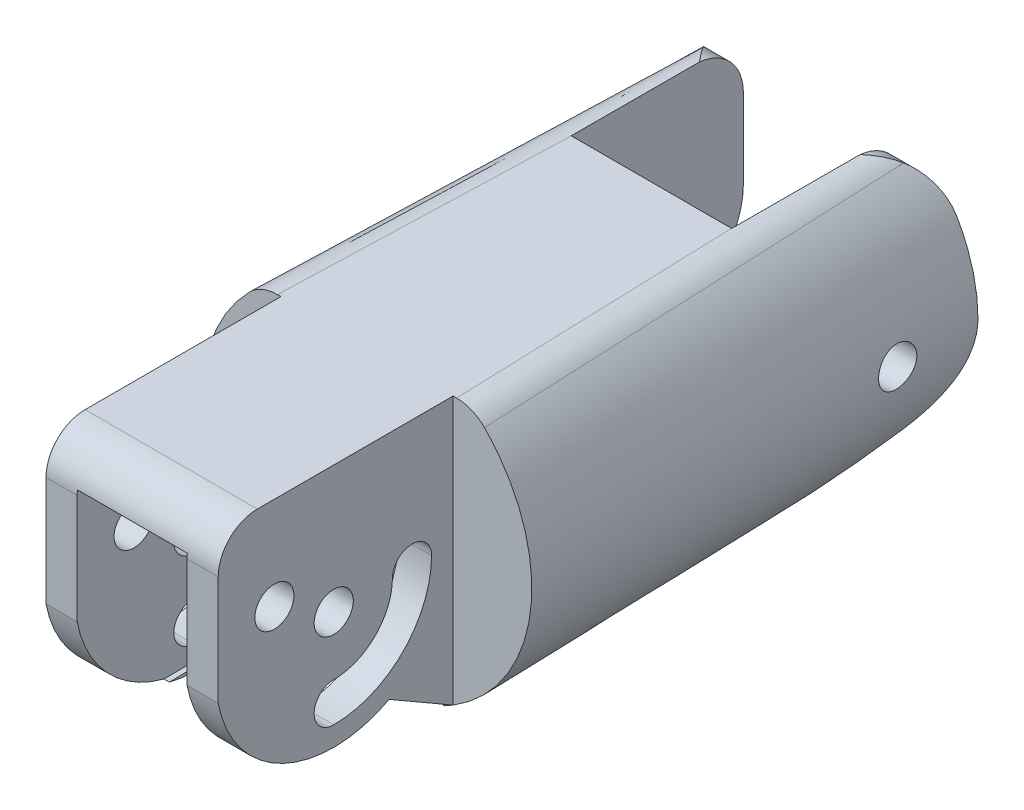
ISO-10303-21;
HEADER;
FILE_DESCRIPTION(('STEP AP214'),'2;1');
FILE_NAME('part.step','',(''),(''),'','','');
FILE_SCHEMA(('AUTOMOTIVE_DESIGN { 1 0 10303 214 1 1 1 1 }'));
ENDSEC;
DATA;
#1=APPLICATION_CONTEXT('core data for automotive mechanical design processes');
#2=APPLICATION_PROTOCOL_DEFINITION('international standard','automotive_design',2000,#1);
#3=PRODUCT_CONTEXT('',#1,'mechanical');
#4=PRODUCT('Part','Part','',(#3));
#5=PRODUCT_RELATED_PRODUCT_CATEGORY('part','',(#4));
#6=PRODUCT_DEFINITION_FORMATION('','',#4);
#7=PRODUCT_DEFINITION_CONTEXT('part definition',#1,'design');
#8=PRODUCT_DEFINITION('design','',#6,#7);
#9=PRODUCT_DEFINITION_SHAPE('','',#8);
#10=(LENGTH_UNIT() NAMED_UNIT(*) SI_UNIT(.MILLI.,.METRE.));
#11=(NAMED_UNIT(*) PLANE_ANGLE_UNIT() SI_UNIT($,.RADIAN.));
#12=(NAMED_UNIT(*) SI_UNIT($,.STERADIAN.) SOLID_ANGLE_UNIT());
#13=UNCERTAINTY_MEASURE_WITH_UNIT(LENGTH_MEASURE(1.E-05),#10,'distance_accuracy_value','');
#14=(GEOMETRIC_REPRESENTATION_CONTEXT(3) GLOBAL_UNCERTAINTY_ASSIGNED_CONTEXT((#13)) GLOBAL_UNIT_ASSIGNED_CONTEXT((#10,
#11,#12)) REPRESENTATION_CONTEXT('',''));
#15=CARTESIAN_POINT('',(0.,0.,0.));
#16=DIRECTION('',(0.,0.,1.));
#17=DIRECTION('',(1.,0.,0.));
#18=AXIS2_PLACEMENT_3D('',#15,#16,#17);
#19=CARTESIAN_POINT('',(-12.3558277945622,0.,-42.5585467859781));
#20=DIRECTION('',(1.,0.,0.));
#21=DIRECTION('',(0.,0.,-1.));
#22=AXIS2_PLACEMENT_3D('',#19,#20,#21);
#23=CYLINDRICAL_SURFACE('',#22,6.);
#24=DIRECTION('',(1.,0.,0.));
#25=VECTOR('',#24,1.);
#26=CARTESIAN_POINT('',(-12.3558277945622,-5.7473518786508,-44.2813196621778));
#27=LINE('',#26,#25);
#28=CARTESIAN_POINT('',(-2.5,-5.7473518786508,-44.2813196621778));
#29=VERTEX_POINT('',#28);
#30=CARTESIAN_POINT('',(-2.7475853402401,-5.7473518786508,-44.2813196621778));
#31=VERTEX_POINT('',#30);
#32=EDGE_CURVE('E544',#29,#31,#27,.F.);
#33=ORIENTED_EDGE('',*,*,#32,.F.);
#34=CARTESIAN_POINT('',(-2.5,0.,-42.5585467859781));
#35=DIRECTION('',(1.,0.,0.));
#36=DIRECTION('',(0.,0.,-1.));
#37=AXIS2_PLACEMENT_3D('',#34,#35,#36);
#38=CIRCLE('',#37,6.);
#39=CARTESIAN_POINT('',(-2.5,-5.81010627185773,-41.0609937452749));
#40=VERTEX_POINT('',#39);
#41=EDGE_CURVE('E61',#40,#29,#38,.T.);
#42=ORIENTED_EDGE('',*,*,#41,.F.);
#43=DIRECTION('',(1.,0.,0.));
#44=VECTOR('',#43,1.);
#45=CARTESIAN_POINT('',(-12.3558277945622,-5.81010627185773,-41.0609937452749));
#46=LINE('',#45,#44);
#47=CARTESIAN_POINT('',(-2.77275500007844,-5.81010627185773,-41.0609937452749));
#48=VERTEX_POINT('',#47);
#49=EDGE_CURVE('E549',#48,#40,#46,.T.);
#50=ORIENTED_EDGE('',*,*,#49,.F.);
#51=CARTESIAN_POINT('',(-2.76105031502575,0.,-42.5585467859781));
#52=DIRECTION('',(-0.999969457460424,0.,-0.00781563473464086));
#53=DIRECTION('',(0.00781563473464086,0.,-0.999969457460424));
#54=AXIS2_PLACEMENT_3D('',#51,#52,#53);
#55=ELLIPSE('',#54,6.00018326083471,6.);
#56=CARTESIAN_POINT('',(-2.80716396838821,-1.09087121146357,-36.6585467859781));
#57=VERTEX_POINT('',#56);
#58=EDGE_CURVE('E585',#57,#48,#55,.F.);
#59=ORIENTED_EDGE('',*,*,#58,.F.);
#60=DIRECTION('',(1.,0.,0.));
#61=VECTOR('',#60,1.);
#62=CARTESIAN_POINT('',(-12.3558277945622,-1.09087121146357,-36.6585467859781));
#63=LINE('',#62,#61);
#64=CARTESIAN_POINT('',(-4.4,-1.09087121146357,-36.6585467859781));
#65=VERTEX_POINT('',#64);
#66=EDGE_CURVE('E1173',#57,#65,#63,.F.);
#67=ORIENTED_EDGE('',*,*,#66,.T.);
#68=CARTESIAN_POINT('',(-4.4,0.,-42.5585467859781));
#69=DIRECTION('',(1.,0.,0.));
#70=DIRECTION('',(0.,0.,-1.));
#71=AXIS2_PLACEMENT_3D('',#68,#69,#70);
#72=CIRCLE('',#71,6.);
#73=CARTESIAN_POINT('',(-4.4,-5.28897350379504,-45.3917003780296));
#74=VERTEX_POINT('',#73);
#75=EDGE_CURVE('E1177',#65,#74,#72,.T.);
#76=ORIENTED_EDGE('',*,*,#75,.T.);
#77=DIRECTION('',(1.,0.,0.));
#78=VECTOR('',#77,1.);
#79=CARTESIAN_POINT('',(-12.3558277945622,-5.28897350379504,-45.3917003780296));
#80=LINE('',#79,#78);
#81=CARTESIAN_POINT('',(-2.73890674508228,-5.28897350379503,-45.3917003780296));
#82=VERTEX_POINT('',#81);
#83=EDGE_CURVE('E616',#74,#82,#80,.T.);
#84=ORIENTED_EDGE('',*,*,#83,.T.);
#85=EDGE_CURVE('E586',#31,#82,#55,.F.);
#86=ORIENTED_EDGE('',*,*,#85,.F.);
#87=EDGE_LOOP('',(#33,#42,#50,#59,#67,#76,#84,#86));
#88=FACE_BOUND('',#87,.T.);
#89=ADVANCED_FACE('F39',(#88),#23,.T.);
#90=CARTESIAN_POINT('',(3.25,-7.,20.));
#91=DIRECTION('',(0.,-0.999810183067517,-0.0194832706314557));
#92=DIRECTION('',(-1.,0.,0.));
#93=AXIS2_PLACEMENT_3D('',#90,#91,#92);
#94=PLANE('',#93);
#95=DIRECTION('',(0.,-0.0194832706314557,0.999810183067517));
#96=VECTOR('',#95,1.);
#97=CARTESIAN_POINT('',(-2.5,-7.,20.));
#98=LINE('',#97,#96);
#99=EDGE_CURVE('E347',#29,#40,#98,.T.);
#100=ORIENTED_EDGE('',*,*,#99,.F.);
#101=ORIENTED_EDGE('',*,*,#32,.T.);
#102=DIRECTION('',(0.00781415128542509,0.0194826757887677,-0.999779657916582));
#103=VECTOR('',#102,1.);
#104=CARTESIAN_POINT('',(-2.825,-5.94036640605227,-34.3765201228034));
#105=LINE('',#104,#103);
#106=EDGE_CURVE('E590',#48,#31,#105,.T.);
#107=ORIENTED_EDGE('',*,*,#106,.F.);
#108=ORIENTED_EDGE('',*,*,#49,.T.);
#109=EDGE_LOOP('',(#100,#101,#107,#108));
#110=FACE_BOUND('',#109,.T.);
#111=ADVANCED_FACE('F499',(#110),#94,.F.);
#112=CARTESIAN_POINT('',(-4.5,-9.0001,-36.6585467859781));
#113=DIRECTION('',(0.,0.,-1.));
#114=DIRECTION('',(-1.,0.,0.));
#115=AXIS2_PLACEMENT_3D('',#112,#113,#114);
#116=PLANE('',#115);
#117=DIRECTION('',(-1.,0.,0.));
#118=VECTOR('',#117,1.);
#119=CARTESIAN_POINT('',(-4.4,4.49999999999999,-36.6585467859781));
#120=LINE('',#119,#118);
#121=CARTESIAN_POINT('',(4.4,4.49999999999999,-36.6585467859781));
#122=VERTEX_POINT('',#121);
#123=CARTESIAN_POINT('',(2.80716396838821,4.49999999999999,-36.6585467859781));
#124=VERTEX_POINT('',#123);
#125=EDGE_CURVE('E1000',#122,#124,#120,.T.);
#126=ORIENTED_EDGE('',*,*,#125,.T.);
#127=DIRECTION('',(0.,-1.,0.));
#128=VECTOR('',#127,1.);
#129=CARTESIAN_POINT('',(2.80716396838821,-9.0001,-36.6585467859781));
#130=LINE('',#129,#128);
#131=CARTESIAN_POINT('',(2.80716396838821,-1.09087121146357,-36.6585467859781));
#132=VERTEX_POINT('',#131);
#133=EDGE_CURVE('E1017',#124,#132,#130,.T.);
#134=ORIENTED_EDGE('',*,*,#133,.T.);
#135=CARTESIAN_POINT('',(4.4,-1.09087121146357,-36.6585467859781));
#136=VERTEX_POINT('',#135);
#137=EDGE_CURVE('E1018',#136,#132,#63,.F.);
#138=ORIENTED_EDGE('',*,*,#137,.F.);
#139=DIRECTION('',(0.,1.,0.));
#140=VECTOR('',#139,1.);
#141=CARTESIAN_POINT('',(4.4,-9.0001,-36.6585467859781));
#142=LINE('',#141,#140);
#143=EDGE_CURVE('E826',#136,#122,#142,.T.);
#144=ORIENTED_EDGE('',*,*,#143,.T.);
#145=EDGE_LOOP('',(#126,#134,#138,#144));
#146=FACE_BOUND('',#145,.T.);
#147=ADVANCED_FACE('F506',(#146),#116,.F.);
#148=CARTESIAN_POINT('',(-4.4,-9.0001,-36.5585467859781));
#149=DIRECTION('',(1.,0.,0.));
#150=DIRECTION('',(0.,0.,-1.));
#151=AXIS2_PLACEMENT_3D('',#148,#149,#150);
#152=PLANE('',#151);
#153=CARTESIAN_POINT('',(-4.4,1.75,-39.5274578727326));
#154=DIRECTION('',(1.,0.,0.));
#155=DIRECTION('',(0.,0.,-1.));
#156=AXIS2_PLACEMENT_3D('',#153,#154,#155);
#157=CIRCLE('',#156,1.00000000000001);
#158=CARTESIAN_POINT('',(-4.4,1.75,-40.5274578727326));
#159=VERTEX_POINT('',#158);
#160=EDGE_CURVE('E378',#159,#159,#157,.T.);
#161=ORIENTED_EDGE('',*,*,#160,.T.);
#162=EDGE_LOOP('',(#161));
#163=FACE_BOUND('',#162,.T.);
#164=CARTESIAN_POINT('',(-4.4,0.,-42.5585467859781));
#165=DIRECTION('',(1.,0.,0.));
#166=DIRECTION('',(0.,0.,-1.));
#167=AXIS2_PLACEMENT_3D('',#164,#165,#166);
#168=CIRCLE('',#167,5.);
#169=CARTESIAN_POINT('',(-4.4,-5.,-42.5585467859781));
#170=VERTEX_POINT('',#169);
#171=CARTESIAN_POINT('',(-4.4,0.,-47.5585467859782));
#172=VERTEX_POINT('',#171);
#173=EDGE_CURVE('E703',#170,#172,#168,.T.);
#174=ORIENTED_EDGE('',*,*,#173,.T.);
#175=CARTESIAN_POINT('',(-4.4,0.,-46.5585467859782));
#176=DIRECTION('',(1.,0.,0.));
#177=DIRECTION('',(0.,0.,-1.));
#178=AXIS2_PLACEMENT_3D('',#175,#176,#177);
#179=CIRCLE('',#178,0.999999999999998);
#180=CARTESIAN_POINT('',(-4.4,0.,-45.5585467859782));
#181=VERTEX_POINT('',#180);
#182=EDGE_CURVE('E357',#172,#181,#179,.T.);
#183=ORIENTED_EDGE('',*,*,#182,.T.);
#184=CARTESIAN_POINT('',(-4.4,0.,-42.5585467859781));
#185=DIRECTION('',(1.,0.,0.));
#186=DIRECTION('',(0.,0.,-1.));
#187=AXIS2_PLACEMENT_3D('',#184,#185,#186);
#188=CIRCLE('',#187,3.);
#189=CARTESIAN_POINT('',(-4.4,-3.,-42.5585467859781));
#190=VERTEX_POINT('',#189);
#191=EDGE_CURVE('E721',#190,#181,#188,.T.);
#192=ORIENTED_EDGE('',*,*,#191,.F.);
#193=CARTESIAN_POINT('',(-4.4,-4.00000000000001,-42.5585467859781));
#194=DIRECTION('',(1.,0.,0.));
#195=DIRECTION('',(0.,0.,-1.));
#196=AXIS2_PLACEMENT_3D('',#193,#194,#195);
#197=CIRCLE('',#196,0.999999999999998);
#198=EDGE_CURVE('E712',#190,#170,#197,.T.);
#199=ORIENTED_EDGE('',*,*,#198,.T.);
#200=EDGE_LOOP('',(#174,#183,#192,#199));
#201=FACE_BOUND('',#200,.T.);
#202=CARTESIAN_POINT('',(-4.4,0.,-42.5585467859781));
#203=DIRECTION('',(1.,0.,0.));
#204=DIRECTION('',(0.,0.,-1.));
#205=AXIS2_PLACEMENT_3D('',#202,#203,#204);
#206=CIRCLE('',#205,0.999999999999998);
#207=CARTESIAN_POINT('',(-4.4,0.,-43.5585467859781));
#208=VERTEX_POINT('',#207);
#209=EDGE_CURVE('E373',#208,#208,#206,.T.);
#210=ORIENTED_EDGE('',*,*,#209,.T.);
#211=EDGE_LOOP('',(#210));
#212=FACE_BOUND('',#211,.T.);
#213=ORIENTED_EDGE('',*,*,#75,.F.);
#214=DIRECTION('',(0.,1.,0.));
#215=VECTOR('',#214,1.);
#216=CARTESIAN_POINT('',(-4.4,-9.0001,-36.6585467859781));
#217=LINE('',#216,#215);
#218=CARTESIAN_POINT('',(-4.4,4.49999999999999,-36.6585467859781));
#219=VERTEX_POINT('',#218);
#220=EDGE_CURVE('E839',#65,#219,#217,.T.);
#221=ORIENTED_EDGE('',*,*,#220,.T.);
#222=CARTESIAN_POINT('',(-4.4,4.49999999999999,-38.6585467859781));
#223=DIRECTION('',(1.,0.,0.));
#224=DIRECTION('',(0.,0.,-1.));
#225=AXIS2_PLACEMENT_3D('',#222,#223,#224);
#226=CIRCLE('',#225,2.);
#227=CARTESIAN_POINT('',(-4.4,6.49999999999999,-38.6585467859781));
#228=VERTEX_POINT('',#227);
#229=EDGE_CURVE('E998',#219,#228,#226,.F.);
#230=ORIENTED_EDGE('',*,*,#229,.T.);
#231=DIRECTION('',(0.,0.,-1.));
#232=VECTOR('',#231,1.);
#233=CARTESIAN_POINT('',(-4.4,6.5,-88.7530402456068));
#234=LINE('',#233,#232);
#235=CARTESIAN_POINT('',(-4.4,6.49999999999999,-48.6585467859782));
#236=VERTEX_POINT('',#235);
#237=EDGE_CURVE('E1003',#228,#236,#234,.T.);
#238=ORIENTED_EDGE('',*,*,#237,.T.);
#239=DIRECTION('',(0.,1.,0.));
#240=VECTOR('',#239,1.);
#241=CARTESIAN_POINT('',(-4.4,-9.0001,-48.6585467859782));
#242=LINE('',#241,#240);
#243=CARTESIAN_POINT('',(-4.4,-7.17508815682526,-48.6585467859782));
#244=VERTEX_POINT('',#243);
#245=EDGE_CURVE('E836',#244,#236,#242,.T.);
#246=ORIENTED_EDGE('',*,*,#245,.F.);
#247=DIRECTION('',(0.,0.499999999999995,0.866025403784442));
#248=VECTOR('',#247,1.);
#249=CARTESIAN_POINT('',(-4.4,-2.39188742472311,-40.3738000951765));
#250=LINE('',#249,#248);
#251=EDGE_CURVE('E622',#244,#74,#250,.T.);
#252=ORIENTED_EDGE('',*,*,#251,.T.);
#253=EDGE_LOOP('',(#213,#221,#230,#238,#246,#252));
#254=FACE_BOUND('',#253,.T.);
#255=ADVANCED_FACE('F425',(#163,#201,#212,#254),#152,.F.);
#256=ORIENTED_EDGE('',*,*,#66,.F.);
#257=DIRECTION('',(0.,1.,0.));
#258=VECTOR('',#257,1.);
#259=CARTESIAN_POINT('',(-2.80716396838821,-9.0001,-36.6585467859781));
#260=LINE('',#259,#258);
#261=CARTESIAN_POINT('',(-2.80716396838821,4.49999999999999,-36.6585467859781));
#262=VERTEX_POINT('',#261);
#263=EDGE_CURVE('E582',#57,#262,#260,.T.);
#264=ORIENTED_EDGE('',*,*,#263,.T.);
#265=EDGE_CURVE('E1002',#262,#219,#120,.T.);
#266=ORIENTED_EDGE('',*,*,#265,.T.);
#267=ORIENTED_EDGE('',*,*,#220,.F.);
#268=EDGE_LOOP('',(#256,#264,#266,#267));
#269=FACE_BOUND('',#268,.T.);
#270=ADVANCED_FACE('F1195',(#269),#116,.F.);
#271=CARTESIAN_POINT('',(4.4,-9.0001,-36.5585467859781));
#272=DIRECTION('',(-1.,0.,0.));
#273=DIRECTION('',(0.,0.,1.));
#274=AXIS2_PLACEMENT_3D('',#271,#272,#273);
#275=PLANE('',#274);
#276=CARTESIAN_POINT('',(4.4,1.75,-39.5274578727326));
#277=DIRECTION('',(-1.,0.,0.));
#278=DIRECTION('',(0.,0.,1.));
#279=AXIS2_PLACEMENT_3D('',#276,#277,#278);
#280=CIRCLE('',#279,1.00000000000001);
#281=CARTESIAN_POINT('',(4.4,1.75,-38.5274578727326));
#282=VERTEX_POINT('',#281);
#283=EDGE_CURVE('E690',#282,#282,#280,.T.);
#284=ORIENTED_EDGE('',*,*,#283,.T.);
#285=EDGE_LOOP('',(#284));
#286=FACE_BOUND('',#285,.T.);
#287=CARTESIAN_POINT('',(4.4,0.,-42.5585467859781));
#288=DIRECTION('',(-1.,0.,0.));
#289=DIRECTION('',(0.,0.,1.));
#290=AXIS2_PLACEMENT_3D('',#287,#288,#289);
#291=CIRCLE('',#290,3.);
#292=CARTESIAN_POINT('',(4.4,0.,-45.5585467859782));
#293=VERTEX_POINT('',#292);
#294=CARTESIAN_POINT('',(4.4,-3.00000000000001,-42.5585467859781));
#295=VERTEX_POINT('',#294);
#296=EDGE_CURVE('E723',#293,#295,#291,.T.);
#297=ORIENTED_EDGE('',*,*,#296,.F.);
#298=CARTESIAN_POINT('',(4.4,0.,-46.5585467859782));
#299=DIRECTION('',(-1.,0.,0.));
#300=DIRECTION('',(0.,0.,1.));
#301=AXIS2_PLACEMENT_3D('',#298,#299,#300);
#302=CIRCLE('',#301,0.999999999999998);
#303=CARTESIAN_POINT('',(4.4,0.,-47.5585467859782));
#304=VERTEX_POINT('',#303);
#305=EDGE_CURVE('E697',#293,#304,#302,.T.);
#306=ORIENTED_EDGE('',*,*,#305,.T.);
#307=CARTESIAN_POINT('',(4.4,0.,-42.5585467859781));
#308=DIRECTION('',(-1.,0.,0.));
#309=DIRECTION('',(0.,0.,1.));
#310=AXIS2_PLACEMENT_3D('',#307,#308,#309);
#311=CIRCLE('',#310,5.);
#312=CARTESIAN_POINT('',(4.4,-5.,-42.5585467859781));
#313=VERTEX_POINT('',#312);
#314=EDGE_CURVE('E706',#304,#313,#311,.T.);
#315=ORIENTED_EDGE('',*,*,#314,.T.);
#316=CARTESIAN_POINT('',(4.4,-4.00000000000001,-42.5585467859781));
#317=DIRECTION('',(-1.,0.,0.));
#318=DIRECTION('',(0.,0.,1.));
#319=AXIS2_PLACEMENT_3D('',#316,#317,#318);
#320=CIRCLE('',#319,0.999999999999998);
#321=EDGE_CURVE('E715',#313,#295,#320,.T.);
#322=ORIENTED_EDGE('',*,*,#321,.T.);
#323=EDGE_LOOP('',(#297,#306,#315,#322));
#324=FACE_BOUND('',#323,.T.);
#325=CARTESIAN_POINT('',(4.4,0.,-42.5585467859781));
#326=DIRECTION('',(-1.,0.,0.));
#327=DIRECTION('',(0.,0.,1.));
#328=AXIS2_PLACEMENT_3D('',#325,#326,#327);
#329=CIRCLE('',#328,0.999999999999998);
#330=CARTESIAN_POINT('',(4.4,0.,-41.5585467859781));
#331=VERTEX_POINT('',#330);
#332=EDGE_CURVE('E683',#331,#331,#329,.T.);
#333=ORIENTED_EDGE('',*,*,#332,.T.);
#334=EDGE_LOOP('',(#333));
#335=FACE_BOUND('',#334,.T.);
#336=CARTESIAN_POINT('',(4.4,0.,-42.5585467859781));
#337=DIRECTION('',(-1.,0.,0.));
#338=DIRECTION('',(0.,0.,1.));
#339=AXIS2_PLACEMENT_3D('',#336,#337,#338);
#340=CIRCLE('',#339,6.);
#341=CARTESIAN_POINT('',(4.4,-5.28897350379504,-45.3917003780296));
#342=VERTEX_POINT('',#341);
#343=EDGE_CURVE('E892',#342,#136,#340,.T.);
#344=ORIENTED_EDGE('',*,*,#343,.F.);
#345=DIRECTION('',(0.,-0.499999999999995,-0.866025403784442));
#346=VECTOR('',#345,1.);
#347=CARTESIAN_POINT('',(4.4,-2.39188742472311,-40.3738000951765));
#348=LINE('',#347,#346);
#349=CARTESIAN_POINT('',(4.4,-7.17508815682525,-48.6585467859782));
#350=VERTEX_POINT('',#349);
#351=EDGE_CURVE('E618',#342,#350,#348,.T.);
#352=ORIENTED_EDGE('',*,*,#351,.T.);
#353=DIRECTION('',(0.,1.,0.));
#354=VECTOR('',#353,1.);
#355=CARTESIAN_POINT('',(4.4,-9.0001,-48.6585467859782));
#356=LINE('',#355,#354);
#357=CARTESIAN_POINT('',(4.4,6.49999999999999,-48.6585467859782));
#358=VERTEX_POINT('',#357);
#359=EDGE_CURVE('E822',#350,#358,#356,.T.);
#360=ORIENTED_EDGE('',*,*,#359,.T.);
#361=DIRECTION('',(0.,0.,1.));
#362=VECTOR('',#361,1.);
#363=CARTESIAN_POINT('',(4.4,6.5,-88.7530402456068));
#364=LINE('',#363,#362);
#365=CARTESIAN_POINT('',(4.4,6.49999999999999,-38.6585467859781));
#366=VERTEX_POINT('',#365);
#367=EDGE_CURVE('E917',#358,#366,#364,.T.);
#368=ORIENTED_EDGE('',*,*,#367,.T.);
#369=CARTESIAN_POINT('',(4.4,4.49999999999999,-38.6585467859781));
#370=DIRECTION('',(-1.,0.,0.));
#371=DIRECTION('',(0.,0.,1.));
#372=AXIS2_PLACEMENT_3D('',#369,#370,#371);
#373=CIRCLE('',#372,2.);
#374=EDGE_CURVE('E991',#366,#122,#373,.F.);
#375=ORIENTED_EDGE('',*,*,#374,.T.);
#376=ORIENTED_EDGE('',*,*,#143,.F.);
#377=EDGE_LOOP('',(#344,#352,#360,#368,#375,#376));
#378=FACE_BOUND('',#377,.T.);
#379=ADVANCED_FACE('F800',(#286,#324,#335,#378),#275,.F.);
#380=CARTESIAN_POINT('',(-3.74165738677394,6.5,-88.7530402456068));
#381=CARTESIAN_POINT('',(-4.35889894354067,9.,20.));
#382=CARTESIAN_POINT('',(-9.38126392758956,3.25361915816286,-88.7530402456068));
#383=CARTESIAN_POINT('',(-13.0137632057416,4.80825792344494,20.));
#384=CARTESIAN_POINT('',(-9.38126392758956,-3.25361915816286,-88.7530402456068));
#385=CARTESIAN_POINT('',(-13.0137632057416,-4.80825792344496,20.));
#386=CARTESIAN_POINT('',(-3.74165738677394,-6.5,-88.7530402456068));
#387=CARTESIAN_POINT('',(-4.35889894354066,-9.,20.));
#388=(BOUNDED_SURFACE() B_SPLINE_SURFACE(3,1,((#380,#381),(#382,#383),(#384,#385),(#386,#387)),
.UNSPECIFIED.,.F.,.F.,.F.) B_SPLINE_SURFACE_WITH_KNOTS((4,4),(2,2),(0.,1.),(0.,1.),
.UNSPECIFIED.) GEOMETRIC_REPRESENTATION_ITEM() RATIONAL_B_SPLINE_SURFACE(((1.,1.),
(0.665925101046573,0.623926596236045),(0.665925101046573,0.623926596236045),(1.,1.))) REPRESENTATION_ITEM('') SURFACE());
#389=CARTESIAN_POINT('',(-7.95889154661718,0.,-68.7906999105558));
#390=CARTESIAN_POINT('',(-7.95889081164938,-0.0560253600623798,-68.7906975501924));
#391=CARTESIAN_POINT('',(-7.95840158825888,-0.112085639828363,-68.7859759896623));
#392=CARTESIAN_POINT('',(-7.95650596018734,-0.222648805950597,-68.7672130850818));
#393=CARTESIAN_POINT('',(-7.95509859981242,-0.277150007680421,-68.7531620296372));
#394=CARTESIAN_POINT('',(-7.95155281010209,-0.382974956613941,-68.7161559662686));
#395=CARTESIAN_POINT('',(-7.94941490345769,-0.43430094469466,-68.6932073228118));
#396=CARTESIAN_POINT('',(-7.94469026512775,-0.532376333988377,-68.639059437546));
#397=CARTESIAN_POINT('',(-7.94210351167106,-0.579125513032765,-68.6078597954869));
#398=CARTESIAN_POINT('',(-7.93682080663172,-0.666892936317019,-68.5379690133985));
#399=CARTESIAN_POINT('',(-7.93412451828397,-0.707891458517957,-68.4992531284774));
#400=CARTESIAN_POINT('',(-7.92900921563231,-0.782821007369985,-68.4154794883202));
#401=CARTESIAN_POINT('',(-7.92659021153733,-0.816751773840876,-68.370421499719));
#402=CARTESIAN_POINT('',(-7.92238886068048,-0.876614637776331,-68.2751729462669));
#403=CARTESIAN_POINT('',(-7.9206072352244,-0.902537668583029,-68.2249766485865));
#404=CARTESIAN_POINT('',(-7.91798695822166,-0.945581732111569,-68.1209195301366));
#405=CARTESIAN_POINT('',(-7.91714826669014,-0.962703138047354,-68.0670588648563));
#406=CARTESIAN_POINT('',(-7.91661770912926,-0.987576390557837,-67.9575224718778));
#407=CARTESIAN_POINT('',(-7.91691955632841,-0.995379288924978,-67.9018583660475));
#408=CARTESIAN_POINT('',(-7.91872924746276,-1.00156645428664,-67.7900299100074));
#409=CARTESIAN_POINT('',(-7.92023705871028,-0.999950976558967,-67.7338655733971));
#410=CARTESIAN_POINT('',(-7.92438685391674,-0.987386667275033,-67.6228363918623));
#411=CARTESIAN_POINT('',(-7.92702483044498,-0.976470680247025,-67.5679676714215));
#412=CARTESIAN_POINT('',(-7.93324077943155,-0.945680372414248,-67.46086058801));
#413=CARTESIAN_POINT('',(-7.93681878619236,-0.92580572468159,-67.4086223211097));
#414=CARTESIAN_POINT('',(-7.94463504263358,-0.87754283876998,-67.3079456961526));
#415=CARTESIAN_POINT('',(-7.94887673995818,-0.849109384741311,-67.2595292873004));
#416=CARTESIAN_POINT('',(-7.95762510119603,-0.784568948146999,-67.1681395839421));
#417=CARTESIAN_POINT('',(-7.96213177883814,-0.74846156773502,-67.1251665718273));
#418=CARTESIAN_POINT('',(-7.97102524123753,-0.669273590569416,-67.0455500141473));
#419=CARTESIAN_POINT('',(-7.97541088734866,-0.626143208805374,-67.0089558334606));
#420=CARTESIAN_POINT('',(-7.98360511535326,-0.534301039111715,-66.9435274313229));
#421=CARTESIAN_POINT('',(-7.98741370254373,-0.485589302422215,-66.9146931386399));
#422=CARTESIAN_POINT('',(-7.99407418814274,-0.384040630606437,-66.8656670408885));
#423=CARTESIAN_POINT('',(-7.99692779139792,-0.331211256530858,-66.8454598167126));
#424=CARTESIAN_POINT('',(-8.00140342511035,-0.222856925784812,-66.8142198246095));
#425=CARTESIAN_POINT('',(-8.00302553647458,-0.167332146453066,-66.8031864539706));
#426=CARTESIAN_POINT('',(-8.0048661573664,-0.0557286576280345,-66.7906912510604));
#427=CARTESIAN_POINT('',(-8.00509786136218,0.000339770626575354,-66.7891394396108));
#428=CARTESIAN_POINT('',(-8.00416997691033,0.111936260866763,-66.7954143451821));
#429=CARTESIAN_POINT('',(-8.00301042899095,0.167464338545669,-66.8032407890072));
#430=CARTESIAN_POINT('',(-7.99942295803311,0.276162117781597,-66.8279806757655));
#431=CARTESIAN_POINT('',(-7.99700047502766,0.329340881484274,-66.8448551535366));
#432=CARTESIAN_POINT('',(-7.9911261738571,0.432112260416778,-66.887169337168));
#433=CARTESIAN_POINT('',(-7.98767431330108,0.481704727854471,-66.912609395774));
#434=CARTESIAN_POINT('',(-7.98004574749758,0.576268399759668,-66.9715299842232));
#435=CARTESIAN_POINT('',(-7.97586426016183,0.621205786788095,-67.0050641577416));
#436=CARTESIAN_POINT('',(-7.96719077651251,0.704843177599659,-67.0791402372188));
#437=CARTESIAN_POINT('',(-7.96269876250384,0.743542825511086,-67.1196825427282));
#438=CARTESIAN_POINT('',(-7.95378498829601,0.813946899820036,-67.2070356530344));
#439=CARTESIAN_POINT('',(-7.94936416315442,0.845588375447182,-67.2538973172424));
#440=CARTESIAN_POINT('',(-7.94104147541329,0.900551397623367,-67.3523123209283));
#441=CARTESIAN_POINT('',(-7.9371396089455,0.923873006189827,-67.4038656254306));
#442=CARTESIAN_POINT('',(-7.93020339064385,0.961495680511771,-67.5101625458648));
#443=CARTESIAN_POINT('',(-7.92716815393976,0.975805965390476,-67.5649028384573));
#444=CARTESIAN_POINT('',(-7.9222031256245,0.995006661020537,-67.6760596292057));
#445=CARTESIAN_POINT('',(-7.92027327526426,0.999897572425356,-67.7324760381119));
#446=CARTESIAN_POINT('',(-7.91764329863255,1.0000984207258,-67.8448944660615));
#447=CARTESIAN_POINT('',(-7.91693330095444,0.995485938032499,-67.9008961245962));
#448=CARTESIAN_POINT('',(-7.9166854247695,0.976960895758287,-68.0113412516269));
#449=CARTESIAN_POINT('',(-7.91714752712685,0.963048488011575,-68.0657847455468));
#450=CARTESIAN_POINT('',(-7.91908222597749,0.926383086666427,-68.1713957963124));
#451=CARTESIAN_POINT('',(-7.92055165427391,0.903657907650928,-68.2225730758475));
#452=CARTESIAN_POINT('',(-7.92423314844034,0.850014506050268,-68.3204051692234));
#453=CARTESIAN_POINT('',(-7.92644521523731,0.819096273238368,-68.3670599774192));
#454=CARTESIAN_POINT('',(-7.93128751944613,0.749757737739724,-68.4547821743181));
#455=CARTESIAN_POINT('',(-7.93391984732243,0.711299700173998,-68.4958196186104));
#456=CARTESIAN_POINT('',(-7.93921999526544,0.628060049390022,-68.5708799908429));
#457=CARTESIAN_POINT('',(-7.94188781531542,0.583278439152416,-68.6049029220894));
#458=CARTESIAN_POINT('',(-7.94690758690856,0.488416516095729,-68.6651265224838));
#459=CARTESIAN_POINT('',(-7.94925796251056,0.438311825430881,-68.6912889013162));
#460=CARTESIAN_POINT('',(-7.95330926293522,0.334428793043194,-68.7347984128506));
#461=CARTESIAN_POINT('',(-7.95501087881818,0.28065443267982,-68.7521549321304));
#462=CARTESIAN_POINT('',(-7.95713159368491,0.188840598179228,-68.7734430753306));
#463=CARTESIAN_POINT('',(-7.95778783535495,0.151373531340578,-68.779905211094));
#464=CARTESIAN_POINT('',(-7.95866805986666,0.0759429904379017,-68.7885344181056));
#465=CARTESIAN_POINT('',(-7.9588920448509,0.0379795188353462,-68.790701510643));
#466=CARTESIAN_POINT('',(-7.95889154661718,0.,-68.7906999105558));
#467=B_SPLINE_CURVE_WITH_KNOTS('',3,(#389,#390,#391,#392,#393,#394,#395,#396,#397,#398,#399,
#400,#401,#402,#403,#404,#405,#406,#407,#408,#409,#410,#411,#412,#413,#414,#415,#416,#417,#418,
#419,#420,#421,#422,#423,#424,#425,#426,#427,#428,#429,#430,#431,#432,#433,#434,#435,#436,#437,
#438,#439,#440,#441,#442,#443,#444,#445,#446,#447,#448,#449,#450,#451,#452,#453,#454,#455,#456,
#457,#458,#459,#460,#461,#462,#463,#464,#465,#466),.UNSPECIFIED.,.T.,.F.,(4,2,2,2,2,2,2,2,2,2,2,
2,2,2,2,2,2,2,2,2,2,2,2,2,2,2,2,2,2,2,2,2,2,2,2,2,2,2,4),(0.,0.167937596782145,
0.336050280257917,0.504042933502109,0.672043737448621,0.840607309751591,1.00917708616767,
1.17793702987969,1.34668981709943,1.51451378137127,1.68233319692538,1.84956240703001,
2.01679772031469,2.1849325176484,2.35307603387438,2.52246800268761,2.69185841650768,
2.86094479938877,3.03002007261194,3.19748831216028,3.36495167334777,3.53169958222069,
3.69845435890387,3.86634620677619,4.03424762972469,4.20359146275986,4.37293403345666,
4.54210307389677,4.71126312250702,4.8790477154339,5.04682956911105,5.21408612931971,
5.38134289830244,5.54945915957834,5.71757534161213,5.88649764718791,6.05523951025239,
6.16908475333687,6.28292943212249),.UNSPECIFIED.);
#468=CARTESIAN_POINT('',(-7.95889154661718,0.,-68.7906999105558));
#469=VERTEX_POINT('',#468);
#470=EDGE_CURVE('E558',#469,#469,#467,.T.);
#471=CARTESIAN_POINT('',(-6.88571078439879,-3.97228723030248,-69.1548605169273));
#472=CARTESIAN_POINT('',(-6.84138441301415,-4.06085381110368,-68.896964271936));
#473=CARTESIAN_POINT('',(-6.79499321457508,-4.14931285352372,-68.6393811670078));
#474=CARTESIAN_POINT('',(-6.69795219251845,-4.3257673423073,-68.1255648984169));
#475=CARTESIAN_POINT('',(-6.64731273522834,-4.4137633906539,-67.869329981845));
#476=CARTESIAN_POINT('',(-6.54155084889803,-4.58927703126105,-67.3582533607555));
#477=CARTESIAN_POINT('',(-6.4864381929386,-4.67679524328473,-67.1034098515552));
#478=CARTESIAN_POINT('',(-6.37144855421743,-4.85133348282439,-66.5951734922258));
#479=CARTESIAN_POINT('',(-6.3115805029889,-4.93835412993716,-66.3417788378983));
#480=CARTESIAN_POINT('',(-6.186742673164,-5.11187394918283,-65.8365080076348));
#481=CARTESIAN_POINT('',(-6.12178055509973,-5.19837370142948,-65.5846301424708));
#482=CARTESIAN_POINT('',(-5.98634225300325,-5.37082327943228,-65.0824757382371));
#483=CARTESIAN_POINT('',(-5.91587178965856,-5.45677357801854,-64.8321978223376));
#484=CARTESIAN_POINT('',(-5.76874571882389,-5.62827938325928,-64.3327915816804));
#485=CARTESIAN_POINT('',(-5.69207938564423,-5.71383392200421,-64.0836660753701));
#486=CARTESIAN_POINT('',(-5.53206806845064,-5.88430145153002,-63.587283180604));
#487=CARTESIAN_POINT('',(-5.44872181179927,-5.96921431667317,-63.3400261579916));
#488=CARTESIAN_POINT('',(-5.27457838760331,-6.1383058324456,-62.8476500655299));
#489=CARTESIAN_POINT('',(-5.18377555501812,-6.22248387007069,-62.6025327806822));
#490=CARTESIAN_POINT('',(-4.99373092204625,-6.38998599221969,-62.1147848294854));
#491=CARTESIAN_POINT('',(-4.89447578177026,-6.4733084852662,-61.8721587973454));
#492=CARTESIAN_POINT('',(-4.68622375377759,-6.63894990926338,-61.3898289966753));
#493=CARTESIAN_POINT('',(-4.57719963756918,-6.72126525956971,-61.1501356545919));
#494=CARTESIAN_POINT('',(-4.40517890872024,-6.84371829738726,-60.7935657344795));
#495=CARTESIAN_POINT('',(-4.3462710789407,-6.88446369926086,-60.674919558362));
#496=CARTESIAN_POINT('',(-4.22544889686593,-6.96548650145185,-60.4389899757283));
#497=CARTESIAN_POINT('',(-4.16353422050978,-7.00576385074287,-60.3217067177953));
#498=CARTESIAN_POINT('',(-4.10000000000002,-7.04577399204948,-60.2052015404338));
#499=B_SPLINE_CURVE_WITH_KNOTS('',3,(#471,#472,#473,#474,#475,#476,#477,#478,#479,#480,#481,
#482,#483,#484,#485,#486,#487,#488,#489,#490,#491,#492,#493,#494,#495,#496,#497,#498),
.UNSPECIFIED.,.F.,.F.,(4,2,2,2,2,2,2,2,2,2,2,2,2,4),(0.,0.8287773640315,1.65558815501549,
2.48063878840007,3.30417488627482,4.12649545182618,4.94797306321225,5.77090451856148,
6.59399313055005,7.41771296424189,8.24275782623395,9.07017841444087,9.48591333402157,
9.90169315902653),.UNSPECIFIED.);
#500=CARTESIAN_POINT('',(-6.88571078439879,-3.97228723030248,-69.1548605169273));
#501=VERTEX_POINT('',#500);
#502=CARTESIAN_POINT('',(-4.1,-7.04577399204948,-60.2052015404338));
#503=VERTEX_POINT('',#502);
#504=EDGE_CURVE('E1033',#501,#503,#499,.T.);
#505=CARTESIAN_POINT('',(-4.1,-7.04577399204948,-60.2052015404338));
#506=CARTESIAN_POINT('',(-4.1,-7.05149104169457,-59.989338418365));
#507=CARTESIAN_POINT('',(-4.1,-7.05720809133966,-59.7734752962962));
#508=CARTESIAN_POINT('',(-4.1,-7.06292514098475,-59.5576121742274));
#509=B_SPLINE_CURVE_WITH_KNOTS('',3,(#505,#506,#507,#508),.UNSPECIFIED.,.F.,.F.,(4,4),(0.,
0.647816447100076),.UNSPECIFIED.);
#510=CARTESIAN_POINT('',(-4.1,-7.06292514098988,-59.5576121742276));
#511=VERTEX_POINT('',#510);
#512=EDGE_CURVE('E393',#503,#511,#509,.T.);
#513=CARTESIAN_POINT('',(-4.1,-7.06292514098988,-59.5576121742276));
#514=CARTESIAN_POINT('',(-4.06808623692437,-7.08285941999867,-59.503645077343));
#515=CARTESIAN_POINT('',(-4.03876214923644,-7.10104625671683,-59.4470939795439));
#516=CARTESIAN_POINT('',(-3.98837434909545,-7.13246847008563,-59.3310445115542));
#517=CARTESIAN_POINT('',(-3.96711663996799,-7.14581972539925,-59.2716601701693));
#518=CARTESIAN_POINT('',(-3.93767235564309,-7.16490162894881,-59.1626988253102));
#519=CARTESIAN_POINT('',(-3.92764270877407,-7.17166086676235,-59.1138222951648));
#520=CARTESIAN_POINT('',(-3.9175206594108,-7.17913320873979,-59.0390808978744));
#521=CARTESIAN_POINT('',(-3.91496718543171,-7.18118632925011,-59.01366241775));
#522=CARTESIAN_POINT('',(-3.91164444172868,-7.1843244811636,-58.9626326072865));
#523=CARTESIAN_POINT('',(-3.91087640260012,-7.18540884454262,-58.9370211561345));
#524=CARTESIAN_POINT('',(-3.91102741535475,-7.18599572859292,-58.9113918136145));
#525=B_SPLINE_CURVE_WITH_KNOTS('',3,(#513,#514,#515,#516,#517,#518,#519,#520,#521,#522,#523,
#524),.UNSPECIFIED.,.F.,.F.,(4,2,2,2,2,4),(0.,0.19776555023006,0.390417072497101,
0.540876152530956,0.61768988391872,0.69455654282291),.UNSPECIFIED.);
#526=CARTESIAN_POINT('',(-3.91102741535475,-7.18599572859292,-58.9113918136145));
#527=VERTEX_POINT('',#526);
#528=EDGE_CURVE('E402',#511,#527,#525,.T.);
#529=DIRECTION('',(-0.00567403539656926,-0.0229814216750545,0.999719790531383));
#530=VECTOR('',#529,1.);
#531=CARTESIAN_POINT('',(-4.0502781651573,-7.75,-34.3765201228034));
#532=LINE('',#531,#530);
#533=CARTESIAN_POINT('',(-3.96921872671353,-7.42168672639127,-48.6585467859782));
#534=VERTEX_POINT('',#533);
#535=EDGE_CURVE('E876',#527,#534,#532,.T.);
#536=CARTESIAN_POINT('',(-4.39999999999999,-7.17508815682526,-48.6585467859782));
#537=CARTESIAN_POINT('',(-4.32941431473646,-7.21830374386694,-48.6585467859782));
#538=CARTESIAN_POINT('',(-4.25822303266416,-7.26046141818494,-48.6585467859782));
#539=CARTESIAN_POINT('',(-4.11462927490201,-7.34266094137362,-48.6585467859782));
#540=CARTESIAN_POINT('',(-4.04222679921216,-7.38270279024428,-48.6585467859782));
#541=CARTESIAN_POINT('',(-3.96921872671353,-7.42168672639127,-48.6585467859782));
#542=B_SPLINE_CURVE_WITH_KNOTS('',3,(#536,#537,#538,#539,#540,#541),.UNSPECIFIED.,.F.,.F.,(4,2,
4),(0.,0.248212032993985,0.496424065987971),.UNSPECIFIED.);
#543=EDGE_CURVE('E635',#244,#534,#542,.T.);
#544=CARTESIAN_POINT('',(-4.56036592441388,7.0744081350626,-48.6585467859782));
#545=CARTESIAN_POINT('',(-4.7594636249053,6.94629955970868,-48.6585467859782));
#546=CARTESIAN_POINT('',(-4.95312920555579,6.80975682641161,-48.6585467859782));
#547=CARTESIAN_POINT('',(-5.32827657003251,6.52086588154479,-48.6585467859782));
#548=CARTESIAN_POINT('',(-5.50975888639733,6.36851836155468,-48.6585467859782));
#549=CARTESIAN_POINT('',(-5.85912510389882,6.04917231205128,-48.6585467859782));
#550=CARTESIAN_POINT('',(-6.02701770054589,5.88218329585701,-48.6585467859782));
#551=CARTESIAN_POINT('',(-6.34814180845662,5.53466224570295,-48.6585467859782));
#552=CARTESIAN_POINT('',(-6.50137351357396,5.3541303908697,-48.6585467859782));
#553=CARTESIAN_POINT('',(-6.79215530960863,4.98071000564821,-48.6585467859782));
#554=CARTESIAN_POINT('',(-6.9296977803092,4.78781554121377,-48.6585467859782));
#555=CARTESIAN_POINT('',(-7.18803578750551,4.39111633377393,-48.6585467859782));
#556=CARTESIAN_POINT('',(-7.30883106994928,4.18731142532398,-48.6585467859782));
#557=CARTESIAN_POINT('',(-7.53278229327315,3.77029281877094,-48.6585467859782));
#558=CARTESIAN_POINT('',(-7.63594243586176,3.55708137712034,-48.6585467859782));
#559=CARTESIAN_POINT('',(-7.82392082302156,3.12272181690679,-48.6585467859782));
#560=CARTESIAN_POINT('',(-7.90873916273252,2.90157373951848,-48.6585467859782));
#561=CARTESIAN_POINT('',(-8.05936816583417,2.45309200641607,-48.6585467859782));
#562=CARTESIAN_POINT('',(-8.12519387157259,2.22576340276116,-48.6585467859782));
#563=CARTESIAN_POINT('',(-8.23747714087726,1.76628748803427,-48.6585467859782));
#564=CARTESIAN_POINT('',(-8.28392789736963,1.53413851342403,-48.6585467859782));
#565=CARTESIAN_POINT('',(-8.35708885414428,1.06679520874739,-48.6585467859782));
#566=CARTESIAN_POINT('',(-8.38380275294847,0.831601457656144,-48.6585467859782));
#567=CARTESIAN_POINT('',(-8.41732085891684,0.359692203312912,-48.6585467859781));
#568=CARTESIAN_POINT('',(-8.42411603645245,0.12297605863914,-48.6585467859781));
#569=CARTESIAN_POINT('',(-8.41772398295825,-0.350067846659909,-48.6585467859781));
#570=CARTESIAN_POINT('',(-8.40454673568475,-0.586395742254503,-48.6585467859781));
#571=CARTESIAN_POINT('',(-8.35833295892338,-1.05699344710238,-48.6585467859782));
#572=CARTESIAN_POINT('',(-8.3253054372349,-1.29126414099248,-48.6585467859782));
#573=CARTESIAN_POINT('',(-8.23962647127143,-1.75623466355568,-48.6585467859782));
#574=CARTESIAN_POINT('',(-8.18697134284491,-1.98693381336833,-48.6585467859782));
#575=CARTESIAN_POINT('',(-8.06243584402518,-2.44299624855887,-48.6585467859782));
#576=CARTESIAN_POINT('',(-7.99056221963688,-2.66836137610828,-48.6585467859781));
#577=CARTESIAN_POINT('',(-7.8280800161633,-3.11227813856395,-48.6585467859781));
#578=CARTESIAN_POINT('',(-7.73746817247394,-3.33082857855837,-48.6585467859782));
#579=CARTESIAN_POINT('',(-7.53816293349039,-3.7595247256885,-48.6585467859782));
#580=CARTESIAN_POINT('',(-7.42946942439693,-3.9696703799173,-48.6585467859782));
#581=CARTESIAN_POINT('',(-7.19475052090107,-4.38010953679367,-48.6585467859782));
#582=CARTESIAN_POINT('',(-7.06872132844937,-4.5804008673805,-48.6585467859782));
#583=CARTESIAN_POINT('',(-6.80024952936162,-4.96965839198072,-48.6585467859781));
#584=CARTESIAN_POINT('',(-6.65780723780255,-5.15862480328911,-48.6585467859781));
#585=CARTESIAN_POINT('',(-6.35917375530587,-5.52188759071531,-48.6585467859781));
#586=CARTESIAN_POINT('',(-6.20315086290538,-5.69632236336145,-48.6585467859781));
#587=CARTESIAN_POINT('',(-5.87712765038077,-6.03160243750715,-48.6585467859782));
#588=CARTESIAN_POINT('',(-5.70712728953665,-6.19244769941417,-48.6585467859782));
#589=CARTESIAN_POINT('',(-5.35423141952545,-6.49951197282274,-48.6585467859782));
#590=CARTESIAN_POINT('',(-5.17132892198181,-6.64572295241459,-48.6585467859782));
#591=CARTESIAN_POINT('',(-4.79399061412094,-6.92243683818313,-48.6585467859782));
#592=CARTESIAN_POINT('',(-4.5995542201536,-7.05293894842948,-48.6585467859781));
#593=CARTESIAN_POINT('',(-4.40000000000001,-7.17508815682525,-48.6585467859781));
#594=B_SPLINE_CURVE_WITH_KNOTS('',3,(#544,#545,#546,#547,#548,#549,#550,#551,#552,#553,#554,
#555,#556,#557,#558,#559,#560,#561,#562,#563,#564,#565,#566,#567,#568,#569,#570,#571,#572,#573,
#574,#575,#576,#577,#578,#579,#580,#581,#582,#583,#584,#585,#586,#587,#588,#589,#590,#591,#592,
#593),.UNSPECIFIED.,.F.,.F.,(4,2,2,2,2,2,2,2,2,2,2,2,2,2,2,2,2,2,2,2,2,2,2,2,4),(0.,
0.710041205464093,1.42005135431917,2.12960354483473,2.83914635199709,3.54903232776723,
4.25892907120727,4.96865643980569,5.67838012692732,6.38754015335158,7.09694912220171,
7.80622512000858,8.51582259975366,9.22506548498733,9.93398676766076,10.6430411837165,
11.3518470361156,12.0607764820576,12.7697103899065,13.4787998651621,14.187875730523,
14.8891591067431,15.5904445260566,16.2921127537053,16.9938165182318),.UNSPECIFIED.);
#595=CARTESIAN_POINT('',(-6.00168894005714,5.90324685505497,-48.6585467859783));
#596=VERTEX_POINT('',#595);
#597=EDGE_CURVE('E844',#596,#244,#594,.T.);
#598=CARTESIAN_POINT('',(-4.64526808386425,6.49999999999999,-46.4980330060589));
#599=CARTESIAN_POINT('',(-5.49098438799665,6.49999999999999,-46.5251093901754));
#600=CARTESIAN_POINT('',(-6.07991070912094,5.89272784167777,-46.5439644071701));
#601=CARTESIAN_POINT('',(-4.57447807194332,6.49999999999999,-48.7088667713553));
#602=CARTESIAN_POINT('',(-5.41134774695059,6.49999999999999,-48.7323153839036));
#603=CARTESIAN_POINT('',(-5.99851585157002,5.90364770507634,-48.7547865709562));
#604=CARTESIAN_POINT('',(-4.50294732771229,6.49999999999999,-50.9196770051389));
#605=CARTESIAN_POINT('',(-5.33060214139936,6.49999999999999,-50.9428765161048));
#606=CARTESIAN_POINT('',(-5.91591086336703,5.91481068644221,-50.9655842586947));
#607=CARTESIAN_POINT('',(-4.35814581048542,6.49999999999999,-55.3412396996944));
#608=CARTESIAN_POINT('',(-5.16677329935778,6.49999999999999,-55.3642480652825));
#609=CARTESIAN_POINT('',(-5.74785809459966,5.93765900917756,-55.3871196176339));
#610=CARTESIAN_POINT('',(-4.28487503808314,6.5,-57.5519921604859));
#611=CARTESIAN_POINT('',(-5.08370891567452,6.49999999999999,-57.5747585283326));
#612=CARTESIAN_POINT('',(-5.66241031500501,5.94934435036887,-57.5978572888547));
#613=CARTESIAN_POINT('',(-4.1363349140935,6.5,-61.9734282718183));
#614=CARTESIAN_POINT('',(-4.91491279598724,6.5,-61.9960051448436));
#615=CARTESIAN_POINT('',(-5.48824944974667,5.97327351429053,-62.0192612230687));
#616=CARTESIAN_POINT('',(-4.06106556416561,6.5,-64.184111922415));
#617=CARTESIAN_POINT('',(-4.82920231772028,6.5,-64.2064244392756));
#618=CARTESIAN_POINT('',(-5.39953636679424,5.98551733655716,-64.2299274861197));
#619=CARTESIAN_POINT('',(-3.90815847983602,6.5,-68.6053947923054));
#620=CARTESIAN_POINT('',(-4.65463498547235,6.5,-68.6275232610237));
#621=CARTESIAN_POINT('',(-5.21824537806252,6.01060561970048,-68.6511725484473));
#622=CARTESIAN_POINT('',(-3.83052074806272,6.5,-70.8159940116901));
#623=CARTESIAN_POINT('',(-4.56580263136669,6.5,-70.8378661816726));
#624=CARTESIAN_POINT('',(-5.12566747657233,6.02345007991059,-70.8617513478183));
#625=CARTESIAN_POINT('',(-3.75151386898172,6.5,-73.0265447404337));
#626=CARTESIAN_POINT('',(-4.4749984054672,6.5,-73.0524085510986));
#627=CARTESIAN_POINT('',(-5.03085734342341,6.03661594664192,-73.0722799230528));
#628=(BOUNDED_SURFACE() B_SPLINE_SURFACE(3,2,((#598,#599,#600),(#601,#602,#603),(#604,#605,
#606),(#607,#608,#609),(#610,#611,#612),(#613,#614,#615),(#616,#617,#618),(#619,#620,#621),
(#622,#623,#624),(#625,#626,#627)),.UNSPECIFIED.,.F.,.F.,.F.) B_SPLINE_SURFACE_WITH_KNOTS((4,2,
2,2,4),(3,3),(0.,6.63590056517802,13.2717988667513,19.9076916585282,26.5435770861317),(0.,1.),
.UNSPECIFIED.) GEOMETRIC_REPRESENTATION_ITEM() RATIONAL_B_SPLINE_SURFACE(((1.,0.920967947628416,
1.),(1.,0.922450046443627,1.),(1.,0.923961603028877,1.),(1.,0.927047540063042,1.),(1.,
0.928621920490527,1.),(1.,0.931837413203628,1.),(1.,0.933478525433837,1.),(1.,0.936832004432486,
1.),(1.,0.93854437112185,1.),(1.,0.940294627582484,1.))) REPRESENTATION_ITEM('') SURFACE());
#629=CARTESIAN_POINT('',(-6.07991070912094,5.89272784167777,-46.5439644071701));
#630=CARTESIAN_POINT('',(-5.99851585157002,5.90364770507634,-48.7547865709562));
#631=CARTESIAN_POINT('',(-5.91591086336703,5.91481068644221,-50.9655842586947));
#632=CARTESIAN_POINT('',(-5.74785809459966,5.93765900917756,-55.3871196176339));
#633=CARTESIAN_POINT('',(-5.66241031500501,5.94934435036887,-57.5978572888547));
#634=CARTESIAN_POINT('',(-5.48824944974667,5.97327351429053,-62.0192612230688));
#635=CARTESIAN_POINT('',(-5.39953636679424,5.98551733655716,-64.2299274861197));
#636=CARTESIAN_POINT('',(-5.21824537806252,6.01060561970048,-68.6511725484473));
#637=CARTESIAN_POINT('',(-5.12566747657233,6.02345007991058,-70.8617513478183));
#638=CARTESIAN_POINT('',(-5.03085734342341,6.03661594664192,-73.0722799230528));
#639=B_SPLINE_CURVE_WITH_KNOTS('',3,(#629,#630,#631,#632,#633,#634,#635,#636,#637,#638),
.UNSPECIFIED.,.F.,.F.,(4,2,2,2,4),(0.,6.63590056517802,13.2717988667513,19.9076916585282,
26.5435770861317),.UNSPECIFIED.);
#640=CARTESIAN_POINT('',(-5.12088109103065,6.02412031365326,-70.9579888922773));
#641=VERTEX_POINT('',#640);
#642=EDGE_CURVE('E480',#596,#641,#639,.T.);
#643=CARTESIAN_POINT('',(-5.01977605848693,6.11238830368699,-70.8277921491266));
#644=CARTESIAN_POINT('',(-5.04787815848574,6.0882054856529,-70.8659903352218));
#645=CARTESIAN_POINT('',(-5.0765950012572,6.06320753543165,-70.9031972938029));
#646=CARTESIAN_POINT('',(-5.13503206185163,6.01166896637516,-70.9756809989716));
#647=CARTESIAN_POINT('',(-5.16475193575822,5.98512887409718,-71.0109583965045));
#648=CARTESIAN_POINT('',(-5.25503340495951,5.90336740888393,-71.1139290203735));
#649=CARTESIAN_POINT('',(-5.316786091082,5.84594577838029,-71.1788530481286));
#650=CARTESIAN_POINT('',(-5.44231305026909,5.72552216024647,-71.3017776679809));
#651=CARTESIAN_POINT('',(-5.50609387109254,5.66250059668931,-71.3597521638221));
#652=CARTESIAN_POINT('',(-5.63447797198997,5.53134835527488,-71.4686372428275));
#653=CARTESIAN_POINT('',(-5.69908148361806,5.46321621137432,-71.5195457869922));
#654=CARTESIAN_POINT('',(-5.82491342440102,5.32578211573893,-71.6117344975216));
#655=CARTESIAN_POINT('',(-5.88614318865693,5.2567239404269,-71.6533770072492));
#656=CARTESIAN_POINT('',(-6.00797418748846,5.11448173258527,-71.729997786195));
#657=CARTESIAN_POINT('',(-6.06857546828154,5.04129800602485,-71.7649765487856));
#658=CARTESIAN_POINT('',(-6.18843453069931,4.89125300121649,-71.8278489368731));
#659=CARTESIAN_POINT('',(-6.24769554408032,4.81440237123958,-71.8557617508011));
#660=CARTESIAN_POINT('',(-6.3645015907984,4.65718302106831,-71.9041772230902));
#661=CARTESIAN_POINT('',(-6.42204729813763,4.57681571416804,-71.9246828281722));
#662=CARTESIAN_POINT('',(-6.53350056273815,4.4150292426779,-71.9573545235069));
#663=CARTESIAN_POINT('',(-6.587463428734,4.33368883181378,-71.9697194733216));
#664=CARTESIAN_POINT('',(-6.69285796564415,4.1685473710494,-71.9863922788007));
#665=CARTESIAN_POINT('',(-6.74428876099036,4.08474548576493,-71.9906973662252));
#666=CARTESIAN_POINT('',(-6.79421505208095,4.,-71.9906999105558));
#667=B_SPLINE_CURVE_WITH_KNOTS('',3,(#643,#644,#645,#646,#647,#648,#649,#650,#651,#652,#653,
#654,#655,#656,#657,#658,#659,#660,#661,#662,#663,#664,#665,#666),.UNSPECIFIED.,.F.,.F.,(4,2,2,
2,2,2,2,2,2,2,2,4),(0.,0.159649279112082,0.319244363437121,0.638047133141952,0.958011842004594,
1.27806869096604,1.5815323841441,1.88497360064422,2.18758172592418,2.4900693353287,
2.78486276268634,3.07975742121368),.UNSPECIFIED.);
#668=CARTESIAN_POINT('',(-6.79421505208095,4.,-71.9906999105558));
#669=VERTEX_POINT('',#668);
#670=EDGE_CURVE('E1100',#641,#669,#667,.T.);
#671=CARTESIAN_POINT('',(-6.79421505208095,4.,-71.9906999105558));
#672=CARTESIAN_POINT('',(-6.9079273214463,3.807106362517,-71.9906999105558));
#673=CARTESIAN_POINT('',(-7.01337441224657,3.60934541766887,-71.9906999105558));
#674=CARTESIAN_POINT('',(-7.20709331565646,3.20551860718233,-71.9906999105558));
#675=CARTESIAN_POINT('',(-7.29536061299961,2.99945057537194,-71.9906999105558));
#676=CARTESIAN_POINT('',(-7.45227883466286,2.58512522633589,-71.9906999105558));
#677=CARTESIAN_POINT('',(-7.52131672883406,2.37701447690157,-71.9906999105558));
#678=CARTESIAN_POINT('',(-7.64178910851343,1.95586283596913,-71.9906999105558));
#679=CARTESIAN_POINT('',(-7.69323030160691,1.74282385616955,-71.9906999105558));
#680=CARTESIAN_POINT('',(-7.78510014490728,1.27818368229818,-71.9906999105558));
#681=CARTESIAN_POINT('',(-7.8223765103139,1.02594653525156,-71.9906999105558));
#682=CARTESIAN_POINT('',(-7.86000318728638,0.644219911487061,-71.9906999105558));
#683=CARTESIAN_POINT('',(-7.86949811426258,0.515564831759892,-71.9906999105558));
#684=CARTESIAN_POINT('',(-7.88216138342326,0.257947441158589,-71.9906999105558));
#685=CARTESIAN_POINT('',(-7.8853299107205,0.128985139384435,-71.9906999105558));
#686=CARTESIAN_POINT('',(-7.88533038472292,0.,-71.9906999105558));
#687=B_SPLINE_CURVE_WITH_KNOTS('',3,(#671,#672,#673,#674,#675,#676,#677,#678,#679,#680,#681,
#682,#683,#684,#685,#686),.UNSPECIFIED.,.F.,.F.,(4,2,2,2,2,2,2,4),(0.,0.671539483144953,
1.34325522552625,2.00027296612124,2.65703998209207,3.42063528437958,3.80751752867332,
4.19438845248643),.UNSPECIFIED.);
#688=CARTESIAN_POINT('',(-7.88533038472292,0.,-71.9906999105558));
#689=VERTEX_POINT('',#688);
#690=EDGE_CURVE('E1116',#669,#689,#687,.T.);
#691=CARTESIAN_POINT('',(-7.88533038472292,0.,-71.9906999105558));
#692=CARTESIAN_POINT('',(-7.88535150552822,-0.110688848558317,-71.9907189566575));
#693=CARTESIAN_POINT('',(-7.88309860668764,-0.22136735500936,-71.9863250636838));
#694=CARTESIAN_POINT('',(-7.87420034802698,-0.441814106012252,-71.9688546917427));
#695=CARTESIAN_POINT('',(-7.86755683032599,-0.551582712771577,-71.9557818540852));
#696=CARTESIAN_POINT('',(-7.85007637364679,-0.768871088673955,-71.9211831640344));
#697=CARTESIAN_POINT('',(-7.83926051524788,-0.876399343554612,-71.8996997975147));
#698=CARTESIAN_POINT('',(-7.81372055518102,-1.08901313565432,-71.8485325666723));
#699=CARTESIAN_POINT('',(-7.79899619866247,-1.19409851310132,-71.8188481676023));
#700=CARTESIAN_POINT('',(-7.76603018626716,-1.40097911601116,-71.7516424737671));
#701=CARTESIAN_POINT('',(-7.74779406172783,-1.50277922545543,-71.7141334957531));
#702=CARTESIAN_POINT('',(-7.70823021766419,-1.70268317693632,-71.6316085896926));
#703=CARTESIAN_POINT('',(-7.68690132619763,-1.80078559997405,-71.5865898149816));
#704=CARTESIAN_POINT('',(-7.61895456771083,-2.08892893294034,-71.440726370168));
#705=CARTESIAN_POINT('',(-7.56839165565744,-2.272715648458,-71.329104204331));
#706=CARTESIAN_POINT('',(-7.45787542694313,-2.63089290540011,-71.0724725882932));
#707=CARTESIAN_POINT('',(-7.39753121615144,-2.80396222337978,-70.9258028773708));
#708=CARTESIAN_POINT('',(-7.27594860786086,-3.12409714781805,-70.6069087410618));
#709=CARTESIAN_POINT('',(-7.21471076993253,-3.27117832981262,-70.4346997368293));
#710=CARTESIAN_POINT('',(-7.10332287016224,-3.52375998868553,-70.0852522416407));
#711=CARTESIAN_POINT('',(-7.05267288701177,-3.63189939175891,-69.9100913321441));
#712=CARTESIAN_POINT('',(-6.98382215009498,-3.77460452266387,-69.6354324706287));
#713=CARTESIAN_POINT('',(-6.96204497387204,-3.81894939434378,-69.5418150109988));
#714=CARTESIAN_POINT('',(-6.92147903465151,-3.90081960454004,-69.3509541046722));
#715=CARTESIAN_POINT('',(-6.9026920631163,-3.93834085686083,-69.2537085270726));
#716=CARTESIAN_POINT('',(-6.88571078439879,-3.97228723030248,-69.1548605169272));
#717=B_SPLINE_CURVE_WITH_KNOTS('',3,(#691,#692,#693,#694,#695,#696,#697,#698,#699,#700,#701,
#702,#703,#704,#705,#706,#707,#708,#709,#710,#711,#712,#713,#714,#715,#716),.UNSPECIFIED.,.F.,
.F.,(4,2,2,2,2,2,2,2,2,2,2,2,4),(0.,0.331940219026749,0.663741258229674,0.993887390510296,
1.32405505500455,1.65370686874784,1.98348392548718,2.64332327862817,3.34472876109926,
4.04571243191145,4.67926061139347,4.99653368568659,5.31399613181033),.UNSPECIFIED.);
#718=EDGE_CURVE('E1037',#689,#501,#717,.T.);
#719=ORIENTED_EDGE('',*,*,#470,.F.);
#720=EDGE_LOOP('',(#719));
#721=FACE_BOUND('',#720,.T.);
#722=ORIENTED_EDGE('',*,*,#504,.T.);
#723=ORIENTED_EDGE('',*,*,#512,.T.);
#724=ORIENTED_EDGE('',*,*,#528,.T.);
#725=ORIENTED_EDGE('',*,*,#535,.T.);
#726=ORIENTED_EDGE('',*,*,#543,.F.);
#727=ORIENTED_EDGE('',*,*,#597,.F.);
#728=ORIENTED_EDGE('',*,*,#642,.T.);
#729=ORIENTED_EDGE('',*,*,#670,.T.);
#730=ORIENTED_EDGE('',*,*,#690,.T.);
#731=ORIENTED_EDGE('',*,*,#718,.T.);
#732=EDGE_LOOP('',(#722,#723,#724,#725,#726,#727,#728,#729,#730,#731));
#733=FACE_BOUND('',#732,.T.);
#734=ADVANCED_FACE('F408',(#721,#733),#388,.T.);
#735=CARTESIAN_POINT('',(3.74165738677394,-6.5,-88.7530402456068));
#736=CARTESIAN_POINT('',(4.35889894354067,-9.,20.));
#737=CARTESIAN_POINT('',(9.38126392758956,-3.25361915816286,-88.7530402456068));
#738=CARTESIAN_POINT('',(13.0137632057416,-4.80825792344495,20.));
#739=CARTESIAN_POINT('',(9.38126392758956,3.25361915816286,-88.7530402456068));
#740=CARTESIAN_POINT('',(13.0137632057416,4.80825792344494,20.));
#741=CARTESIAN_POINT('',(3.74165738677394,6.5,-88.7530402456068));
#742=CARTESIAN_POINT('',(4.35889894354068,9.,20.));
#743=(BOUNDED_SURFACE() B_SPLINE_SURFACE(3,1,((#735,#736),(#737,#738),(#739,#740),(#741,#742)),
.UNSPECIFIED.,.F.,.F.,.F.) B_SPLINE_SURFACE_WITH_KNOTS((4,4),(2,2),(0.,1.),(0.,1.),
.UNSPECIFIED.) GEOMETRIC_REPRESENTATION_ITEM() RATIONAL_B_SPLINE_SURFACE(((1.,1.),
(0.665925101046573,0.623926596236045),(0.665925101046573,0.623926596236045),(1.,1.))) REPRESENTATION_ITEM('') SURFACE());
#744=CARTESIAN_POINT('',(7.95889154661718,0.,-68.7906999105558));
#745=CARTESIAN_POINT('',(7.95889081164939,0.0560253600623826,-68.7906975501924));
#746=CARTESIAN_POINT('',(7.95840158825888,0.11208563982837,-68.7859759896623));
#747=CARTESIAN_POINT('',(7.95650596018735,0.222648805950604,-68.7672130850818));
#748=CARTESIAN_POINT('',(7.95509859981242,0.277150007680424,-68.7531620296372));
#749=CARTESIAN_POINT('',(7.95155281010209,0.382974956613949,-68.7161559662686));
#750=CARTESIAN_POINT('',(7.9494149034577,0.434300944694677,-68.6932073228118));
#751=CARTESIAN_POINT('',(7.94469026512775,0.532376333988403,-68.639059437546));
#752=CARTESIAN_POINT('',(7.94210351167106,0.57912551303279,-68.6078597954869));
#753=CARTESIAN_POINT('',(7.93682080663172,0.666892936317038,-68.5379690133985));
#754=CARTESIAN_POINT('',(7.93412451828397,0.707891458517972,-68.4992531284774));
#755=CARTESIAN_POINT('',(7.92900921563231,0.782821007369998,-68.4154794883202));
#756=CARTESIAN_POINT('',(7.92659021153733,0.816751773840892,-68.370421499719));
#757=CARTESIAN_POINT('',(7.92238886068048,0.87661463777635,-68.2751729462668));
#758=CARTESIAN_POINT('',(7.9206072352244,0.902537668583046,-68.2249766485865));
#759=CARTESIAN_POINT('',(7.91798695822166,0.94558173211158,-68.1209195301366));
#760=CARTESIAN_POINT('',(7.91714826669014,0.962703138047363,-68.0670588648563));
#761=CARTESIAN_POINT('',(7.91661770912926,0.987576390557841,-67.9575224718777));
#762=CARTESIAN_POINT('',(7.91691955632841,0.995379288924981,-67.9018583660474));
#763=CARTESIAN_POINT('',(7.91872924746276,1.00156645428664,-67.7900299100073));
#764=CARTESIAN_POINT('',(7.92023705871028,0.999950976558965,-67.7338655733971));
#765=CARTESIAN_POINT('',(7.92438685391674,0.987386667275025,-67.6228363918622));
#766=CARTESIAN_POINT('',(7.92702483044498,0.976470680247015,-67.5679676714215));
#767=CARTESIAN_POINT('',(7.93324077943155,0.945680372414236,-67.46086058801));
#768=CARTESIAN_POINT('',(7.93681878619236,0.925805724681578,-67.4086223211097));
#769=CARTESIAN_POINT('',(7.94463504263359,0.877542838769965,-67.3079456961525));
#770=CARTESIAN_POINT('',(7.94887673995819,0.849109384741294,-67.2595292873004));
#771=CARTESIAN_POINT('',(7.95762510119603,0.784568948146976,-67.1681395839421));
#772=CARTESIAN_POINT('',(7.96213177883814,0.748461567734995,-67.1251665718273));
#773=CARTESIAN_POINT('',(7.97102524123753,0.669273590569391,-67.0455500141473));
#774=CARTESIAN_POINT('',(7.97541088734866,0.62614320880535,-67.0089558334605));
#775=CARTESIAN_POINT('',(7.98360511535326,0.534301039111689,-66.9435274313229));
#776=CARTESIAN_POINT('',(7.98741370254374,0.485589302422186,-66.9146931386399));
#777=CARTESIAN_POINT('',(7.99407418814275,0.384040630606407,-66.8656670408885));
#778=CARTESIAN_POINT('',(7.99692779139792,0.331211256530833,-66.8454598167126));
#779=CARTESIAN_POINT('',(8.00140342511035,0.222856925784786,-66.8142198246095));
#780=CARTESIAN_POINT('',(8.00302553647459,0.167332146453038,-66.8031864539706));
#781=CARTESIAN_POINT('',(8.0048661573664,0.0557286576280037,-66.7906912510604));
#782=CARTESIAN_POINT('',(8.00509786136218,-0.00033977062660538,-66.7891394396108));
#783=CARTESIAN_POINT('',(8.00416997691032,-0.111936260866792,-66.7954143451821));
#784=CARTESIAN_POINT('',(8.00301042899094,-0.167464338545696,-66.8032407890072));
#785=CARTESIAN_POINT('',(7.99942295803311,-0.276162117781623,-66.8279806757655));
#786=CARTESIAN_POINT('',(7.99700047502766,-0.329340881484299,-66.8448551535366));
#787=CARTESIAN_POINT('',(7.9911261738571,-0.432112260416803,-66.8871693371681));
#788=CARTESIAN_POINT('',(7.98767431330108,-0.481704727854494,-66.912609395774));
#789=CARTESIAN_POINT('',(7.98004574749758,-0.576268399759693,-66.9715299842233));
#790=CARTESIAN_POINT('',(7.97586426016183,-0.621205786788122,-67.0050641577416));
#791=CARTESIAN_POINT('',(7.96719077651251,-0.704843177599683,-67.0791402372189));
#792=CARTESIAN_POINT('',(7.96269876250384,-0.743542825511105,-67.1196825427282));
#793=CARTESIAN_POINT('',(7.95378498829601,-0.813946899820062,-67.2070356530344));
#794=CARTESIAN_POINT('',(7.94936416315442,-0.84558837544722,-67.2538973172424));
#795=CARTESIAN_POINT('',(7.94104147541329,-0.900551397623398,-67.3523123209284));
#796=CARTESIAN_POINT('',(7.93713960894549,-0.923873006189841,-67.4038656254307));
#797=CARTESIAN_POINT('',(7.93020339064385,-0.961495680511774,-67.5101625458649));
#798=CARTESIAN_POINT('',(7.92716815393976,-0.975805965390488,-67.5649028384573));
#799=CARTESIAN_POINT('',(7.9222031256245,-0.99500666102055,-67.6760596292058));
#800=CARTESIAN_POINT('',(7.92027327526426,-0.99989757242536,-67.7324760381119));
#801=CARTESIAN_POINT('',(7.91764329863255,-1.00009842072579,-67.8448944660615));
#802=CARTESIAN_POINT('',(7.91693330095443,-0.995485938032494,-67.9008961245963));
#803=CARTESIAN_POINT('',(7.91668542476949,-0.976960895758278,-68.0113412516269));
#804=CARTESIAN_POINT('',(7.91714752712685,-0.963048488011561,-68.0657847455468));
#805=CARTESIAN_POINT('',(7.91908222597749,-0.926383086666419,-68.1713957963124));
#806=CARTESIAN_POINT('',(7.92055165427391,-0.903657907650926,-68.2225730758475));
#807=CARTESIAN_POINT('',(7.92423314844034,-0.85001450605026,-68.3204051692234));
#808=CARTESIAN_POINT('',(7.92644521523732,-0.819096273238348,-68.3670599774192));
#809=CARTESIAN_POINT('',(7.93128751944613,-0.749757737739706,-68.4547821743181));
#810=CARTESIAN_POINT('',(7.93391984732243,-0.711299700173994,-68.4958196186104));
#811=CARTESIAN_POINT('',(7.93921999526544,-0.628060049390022,-68.5708799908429));
#812=CARTESIAN_POINT('',(7.94188781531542,-0.583278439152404,-68.6049029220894));
#813=CARTESIAN_POINT('',(7.94690758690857,-0.488416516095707,-68.6651265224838));
#814=CARTESIAN_POINT('',(7.94925796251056,-0.438311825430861,-68.6912889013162));
#815=CARTESIAN_POINT('',(7.95330926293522,-0.334428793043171,-68.7347984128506));
#816=CARTESIAN_POINT('',(7.95501087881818,-0.280654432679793,-68.7521549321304));
#817=CARTESIAN_POINT('',(7.95713159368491,-0.188840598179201,-68.7734430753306));
#818=CARTESIAN_POINT('',(7.95778783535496,-0.151373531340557,-68.779905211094));
#819=CARTESIAN_POINT('',(7.95866805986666,-0.0759429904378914,-68.7885344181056));
#820=CARTESIAN_POINT('',(7.9588920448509,-0.0379795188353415,-68.790701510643));
#821=CARTESIAN_POINT('',(7.95889154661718,0.,-68.7906999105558));
#822=B_SPLINE_CURVE_WITH_KNOTS('',3,(#744,#745,#746,#747,#748,#749,#750,#751,#752,#753,#754,
#755,#756,#757,#758,#759,#760,#761,#762,#763,#764,#765,#766,#767,#768,#769,#770,#771,#772,#773,
#774,#775,#776,#777,#778,#779,#780,#781,#782,#783,#784,#785,#786,#787,#788,#789,#790,#791,#792,
#793,#794,#795,#796,#797,#798,#799,#800,#801,#802,#803,#804,#805,#806,#807,#808,#809,#810,#811,
#812,#813,#814,#815,#816,#817,#818,#819,#820,#821),.UNSPECIFIED.,.T.,.F.,(4,2,2,2,2,2,2,2,2,2,2,
2,2,2,2,2,2,2,2,2,2,2,2,2,2,2,2,2,2,2,2,2,2,2,2,2,2,2,4),(0.,0.167937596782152,
0.336050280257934,0.50404293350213,0.672043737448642,0.840607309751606,1.00917708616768,
1.17793702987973,1.34668981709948,1.51451378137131,1.68233319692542,1.84956240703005,
2.01679772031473,2.18493251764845,2.3530760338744,2.52246800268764,2.6918584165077,
2.8609447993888,3.03002007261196,3.19748831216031,3.36495167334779,3.53169958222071,
3.69845435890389,3.86634620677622,4.03424762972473,4.20359146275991,4.37293403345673,
4.54210307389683,4.71126312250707,4.87904771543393,5.04682956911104,5.21408612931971,
5.38134289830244,5.54945915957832,5.71757534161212,5.88649764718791,6.0552395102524,
6.16908475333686,6.28292943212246),.UNSPECIFIED.);
#823=CARTESIAN_POINT('',(7.95889154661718,0.,-68.7906999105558));
#824=VERTEX_POINT('',#823);
#825=EDGE_CURVE('E673',#824,#824,#822,.T.);
#826=CARTESIAN_POINT('',(3.91102741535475,-7.18599572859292,-58.9113918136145));
#827=CARTESIAN_POINT('',(3.91081996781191,-7.1852502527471,-58.9442195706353));
#828=CARTESIAN_POINT('',(3.91214246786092,-7.18367852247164,-58.9770236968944));
#829=CARTESIAN_POINT('',(3.91768909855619,-7.17895983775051,-59.0422216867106));
#830=CARTESIAN_POINT('',(3.92190868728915,-7.17581535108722,-59.0746161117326));
#831=CARTESIAN_POINT('',(3.93295715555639,-7.16811925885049,-59.1379657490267));
#832=CARTESIAN_POINT('',(3.93972088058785,-7.16360329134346,-59.168936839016));
#833=CARTESIAN_POINT('',(3.9556164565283,-7.15325214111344,-59.2300381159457));
#834=CARTESIAN_POINT('',(3.96474873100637,-7.14741672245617,-59.2601681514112));
#835=CARTESIAN_POINT('',(3.99101240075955,-7.13081402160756,-59.3366306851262));
#836=CARTESIAN_POINT('',(4.0097114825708,-7.11914908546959,-59.3822269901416));
#837=CARTESIAN_POINT('',(4.05168528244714,-7.0930242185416,-59.4716242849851));
#838=CARTESIAN_POINT('',(4.0750435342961,-7.07851335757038,-59.5153716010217));
#839=CARTESIAN_POINT('',(4.10000000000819,-7.06292514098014,-59.5576121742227));
#840=B_SPLINE_CURVE_WITH_KNOTS('',3,(#826,#827,#828,#829,#830,#831,#832,#833,#834,#835,#836,
#837,#838,#839),.UNSPECIFIED.,.F.,.F.,(4,2,2,2,2,2,4),(0.,0.0984446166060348,0.196735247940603,
0.292663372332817,0.388608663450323,0.540191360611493,0.694785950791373),.UNSPECIFIED.);
#841=CARTESIAN_POINT('',(3.91102741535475,-7.18599572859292,-58.9113918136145));
#842=VERTEX_POINT('',#841);
#843=CARTESIAN_POINT('',(4.1,-7.06292514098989,-59.5576121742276));
#844=VERTEX_POINT('',#843);
#845=EDGE_CURVE('E891',#842,#844,#840,.T.);
#846=CARTESIAN_POINT('',(4.1,-7.06292514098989,-59.5576121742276));
#847=CARTESIAN_POINT('',(4.1,-7.05720809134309,-59.7734752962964));
#848=CARTESIAN_POINT('',(4.1,-7.05149104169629,-59.9893384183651));
#849=CARTESIAN_POINT('',(4.1,-7.04577399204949,-60.2052015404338));
#850=B_SPLINE_CURVE_WITH_KNOTS('',3,(#846,#847,#848,#849),.UNSPECIFIED.,.F.,.F.,(4,4),(0.,
0.647816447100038),.UNSPECIFIED.);
#851=CARTESIAN_POINT('',(4.1,-7.04577399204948,-60.2052015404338));
#852=VERTEX_POINT('',#851);
#853=EDGE_CURVE('E899',#844,#852,#850,.T.);
#854=CARTESIAN_POINT('',(4.10000000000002,-7.04577399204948,-60.2052015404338));
#855=CARTESIAN_POINT('',(4.16353422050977,-7.00576385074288,-60.3217067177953));
#856=CARTESIAN_POINT('',(4.22544889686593,-6.96548650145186,-60.4389899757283));
#857=CARTESIAN_POINT('',(4.3462710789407,-6.88446369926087,-60.674919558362));
#858=CARTESIAN_POINT('',(4.40517890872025,-6.84371829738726,-60.7935657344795));
#859=CARTESIAN_POINT('',(4.57719963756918,-6.72126525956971,-61.1501356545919));
#860=CARTESIAN_POINT('',(4.68622375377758,-6.63894990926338,-61.3898289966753));
#861=CARTESIAN_POINT('',(4.89447578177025,-6.47330848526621,-61.8721587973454));
#862=CARTESIAN_POINT('',(4.99373092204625,-6.38998599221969,-62.1147848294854));
#863=CARTESIAN_POINT('',(5.18377555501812,-6.22248387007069,-62.6025327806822));
#864=CARTESIAN_POINT('',(5.27457838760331,-6.13830583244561,-62.8476500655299));
#865=CARTESIAN_POINT('',(5.44872181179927,-5.96921431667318,-63.3400261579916));
#866=CARTESIAN_POINT('',(5.53206806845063,-5.88430145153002,-63.587283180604));
#867=CARTESIAN_POINT('',(5.69207938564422,-5.71383392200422,-64.0836660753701));
#868=CARTESIAN_POINT('',(5.76874571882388,-5.62827938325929,-64.3327915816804));
#869=CARTESIAN_POINT('',(5.91587178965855,-5.45677357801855,-64.8321978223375));
#870=CARTESIAN_POINT('',(5.98634225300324,-5.3708232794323,-65.0824757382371));
#871=CARTESIAN_POINT('',(6.12178055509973,-5.19837370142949,-65.5846301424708));
#872=CARTESIAN_POINT('',(6.18674267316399,-5.11187394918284,-65.8365080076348));
#873=CARTESIAN_POINT('',(6.31158050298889,-4.93835412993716,-66.3417788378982));
#874=CARTESIAN_POINT('',(6.37144855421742,-4.8513334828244,-66.5951734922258));
#875=CARTESIAN_POINT('',(6.48643819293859,-4.67679524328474,-67.1034098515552));
#876=CARTESIAN_POINT('',(6.54155084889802,-4.58927703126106,-67.3582533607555));
#877=CARTESIAN_POINT('',(6.64731273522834,-4.41376339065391,-67.8693299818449));
#878=CARTESIAN_POINT('',(6.69795219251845,-4.32576734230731,-68.1255648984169));
#879=CARTESIAN_POINT('',(6.79499321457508,-4.14931285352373,-68.6393811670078));
#880=CARTESIAN_POINT('',(6.84138441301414,-4.0608538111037,-68.896964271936));
#881=CARTESIAN_POINT('',(6.88571078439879,-3.97228723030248,-69.1548605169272));
#882=B_SPLINE_CURVE_WITH_KNOTS('',3,(#854,#855,#856,#857,#858,#859,#860,#861,#862,#863,#864,
#865,#866,#867,#868,#869,#870,#871,#872,#873,#874,#875,#876,#877,#878,#879,#880,#881),
.UNSPECIFIED.,.F.,.F.,(4,2,2,2,2,2,2,2,2,2,2,2,2,4),(0.,0.415779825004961,0.831514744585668,
1.65893533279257,2.48398019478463,3.30770002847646,4.13078864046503,4.95372009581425,
5.77519770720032,6.59751827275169,7.42105437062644,8.246105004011,9.07291579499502,
9.9016931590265),.UNSPECIFIED.);
#883=CARTESIAN_POINT('',(6.88571078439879,-3.97228723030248,-69.1548605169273));
#884=VERTEX_POINT('',#883);
#885=EDGE_CURVE('E1066',#852,#884,#882,.T.);
#886=CARTESIAN_POINT('',(6.88571078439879,-3.97228723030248,-69.1548605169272));
#887=CARTESIAN_POINT('',(6.90524848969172,-3.93322306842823,-69.2686035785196));
#888=CARTESIAN_POINT('',(6.9271767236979,-3.88943643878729,-69.3802056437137));
#889=CARTESIAN_POINT('',(6.97486770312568,-3.79289575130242,-69.5985125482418));
#890=CARTESIAN_POINT('',(7.00062756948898,-3.74014842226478,-69.7052209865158));
#891=CARTESIAN_POINT('',(7.08215220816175,-3.5693645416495,-70.0168195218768));
#892=CARTESIAN_POINT('',(7.14226801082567,-3.43858814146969,-70.2137513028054));
#893=CARTESIAN_POINT('',(7.26627244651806,-3.14728750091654,-70.5816912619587));
#894=CARTESIAN_POINT('',(7.33015153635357,-2.9868364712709,-70.7527613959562));
#895=CARTESIAN_POINT('',(7.4550009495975,-2.63879421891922,-71.0666091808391));
#896=CARTESIAN_POINT('',(7.515968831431,-2.4511807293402,-71.2093633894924));
#897=CARTESIAN_POINT('',(7.6014548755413,-2.14863915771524,-71.401574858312));
#898=CARTESIAN_POINT('',(7.62941979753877,-2.04205847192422,-71.4629199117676));
#899=CARTESIAN_POINT('',(7.68201671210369,-1.82329108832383,-71.5762994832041));
#900=CARTESIAN_POINT('',(7.70665025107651,-1.71110702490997,-71.6283383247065));
#901=CARTESIAN_POINT('',(7.75180557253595,-1.48204599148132,-71.7224742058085));
#902=CARTESIAN_POINT('',(7.77233358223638,-1.36517645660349,-71.7645863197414));
#903=CARTESIAN_POINT('',(7.80867274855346,-1.12755055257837,-71.8384288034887));
#904=CARTESIAN_POINT('',(7.82448590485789,-1.00679585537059,-71.8701635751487));
#905=CARTESIAN_POINT('',(7.8533021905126,-0.73992522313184,-71.9276515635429));
#906=CARTESIAN_POINT('',(7.86525976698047,-0.593215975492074,-71.9512438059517));
#907=CARTESIAN_POINT('',(7.87727217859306,-0.371628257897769,-71.9748880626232));
#908=CARTESIAN_POINT('',(7.88028901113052,-0.297480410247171,-71.9808121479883));
#909=CARTESIAN_POINT('',(7.8843194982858,-0.148895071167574,-71.9887191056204));
#910=CARTESIAN_POINT('',(7.88533246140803,-0.0744574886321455,-71.9907006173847));
#911=CARTESIAN_POINT('',(7.88533038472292,0.,-71.9906999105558));
#912=B_SPLINE_CURVE_WITH_KNOTS('',3,(#886,#887,#888,#889,#890,#891,#892,#893,#894,#895,#896,
#897,#898,#899,#900,#901,#902,#903,#904,#905,#906,#907,#908,#909,#910,#911),.UNSPECIFIED.,.F.,
.F.,(4,2,2,2,2,2,2,2,2,2,2,2,4),(0.,0.365213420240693,0.730153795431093,1.45822596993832,
2.18452530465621,2.91142344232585,3.28934116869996,3.66708286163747,4.0442471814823,
4.42125130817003,4.8673239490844,5.09054689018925,5.31384684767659),.UNSPECIFIED.);
#913=CARTESIAN_POINT('',(7.88533038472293,0.,-71.9906999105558));
#914=VERTEX_POINT('',#913);
#915=EDGE_CURVE('E1040',#884,#914,#912,.T.);
#916=CARTESIAN_POINT('',(7.88533038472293,0.,-71.9906999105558));
#917=CARTESIAN_POINT('',(7.88535498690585,0.223916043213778,-71.9906999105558));
#918=CARTESIAN_POINT('',(7.875783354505,0.447828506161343,-71.9906999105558));
#919=CARTESIAN_POINT('',(7.83762086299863,0.894085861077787,-71.9906999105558));
#920=CARTESIAN_POINT('',(7.80902507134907,1.11643033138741,-71.9906999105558));
#921=CARTESIAN_POINT('',(7.73381947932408,1.55304432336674,-71.9906999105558));
#922=CARTESIAN_POINT('',(7.68761749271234,1.76738408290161,-71.9906999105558));
#923=CARTESIAN_POINT('',(7.57754469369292,2.19137200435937,-71.9906999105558));
#924=CARTESIAN_POINT('',(7.51368061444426,2.40102192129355,-71.9906999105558));
#925=CARTESIAN_POINT('',(7.35688576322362,2.84795221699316,-71.9906999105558));
#926=CARTESIAN_POINT('',(7.26091670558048,3.08417984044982,-71.9906999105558));
#927=CARTESIAN_POINT('',(7.09950147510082,3.43214135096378,-71.9906999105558));
#928=CARTESIAN_POINT('',(7.04235461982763,3.54779868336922,-71.9906999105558));
#929=CARTESIAN_POINT('',(6.92245663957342,3.77616667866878,-71.9906999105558));
#930=CARTESIAN_POINT('',(6.85970568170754,3.88887742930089,-71.9906999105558));
#931=CARTESIAN_POINT('',(6.79421505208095,4.,-71.9906999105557));
#932=B_SPLINE_CURVE_WITH_KNOTS('',3,(#916,#917,#918,#919,#920,#921,#922,#923,#924,#925,#926,
#927,#928,#929,#930,#931),.UNSPECIFIED.,.F.,.F.,(4,2,2,2,2,2,2,4),(0.,0.671538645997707,
1.34325147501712,2.0002680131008,2.65703442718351,3.42063290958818,3.80751640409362,
4.19438836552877),.UNSPECIFIED.);
#933=CARTESIAN_POINT('',(6.79421505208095,4.,-71.9906999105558));
#934=VERTEX_POINT('',#933);
#935=EDGE_CURVE('E1110',#914,#934,#932,.T.);
#936=CARTESIAN_POINT('',(6.79421505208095,4.,-71.9906999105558));
#937=CARTESIAN_POINT('',(6.73998414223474,4.09206161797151,-71.9906957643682));
#938=CARTESIAN_POINT('',(6.68397642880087,4.18299976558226,-71.9856168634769));
#939=CARTESIAN_POINT('',(6.56906186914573,4.36184724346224,-71.9660084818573));
#940=CARTESIAN_POINT('',(6.51015830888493,4.44975982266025,-71.9514894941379));
#941=CARTESIAN_POINT('',(6.39003109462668,4.62191348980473,-71.913711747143));
#942=CARTESIAN_POINT('',(6.32880931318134,4.70615742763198,-71.8904599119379));
#943=CARTESIAN_POINT('',(6.20458888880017,4.87061719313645,-71.8358089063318));
#944=CARTESIAN_POINT('',(6.14158984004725,4.95083208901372,-71.8044078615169));
#945=CARTESIAN_POINT('',(6.01996894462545,5.10009363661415,-71.7370093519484));
#946=CARTESIAN_POINT('',(5.96144124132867,5.16950557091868,-71.7016465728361));
#947=CARTESIAN_POINT('',(5.84393614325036,5.30445752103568,-71.6248086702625));
#948=CARTESIAN_POINT('',(5.78495874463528,5.36999750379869,-71.5833334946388));
#949=CARTESIAN_POINT('',(5.66717782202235,5.49694179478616,-71.4944866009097));
#950=CARTESIAN_POINT('',(5.60837417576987,5.55835080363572,-71.4471217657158));
#951=CARTESIAN_POINT('',(5.49153453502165,5.67689626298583,-71.3465183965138));
#952=CARTESIAN_POINT('',(5.43349834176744,5.7340338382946,-71.2932814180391));
#953=CARTESIAN_POINT('',(5.31407868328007,5.84847985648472,-71.1760462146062));
#954=CARTESIAN_POINT('',(5.25282915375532,5.90539126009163,-71.1115181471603));
#955=CARTESIAN_POINT('',(5.16333855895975,5.98639442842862,-71.0092926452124));
#956=CARTESIAN_POINT('',(5.13391676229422,6.01265867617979,-70.9743267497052));
#957=CARTESIAN_POINT('',(5.07605389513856,6.06367849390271,-70.9024962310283));
#958=CARTESIAN_POINT('',(5.04761332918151,6.08843329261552,-70.8656306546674));
#959=CARTESIAN_POINT('',(5.01977605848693,6.11238830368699,-70.8277921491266));
#960=B_SPLINE_CURVE_WITH_KNOTS('',3,(#936,#937,#938,#939,#940,#941,#942,#943,#944,#945,#946,
#947,#948,#949,#950,#951,#952,#953,#954,#955,#956,#957,#958,#959),.UNSPECIFIED.,.F.,.F.,(4,2,2,
2,2,2,2,2,2,2,2,4),(0.,0.320306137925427,0.640256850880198,0.959954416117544,1.27972558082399,
1.57176819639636,1.86381330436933,2.15552026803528,2.44715014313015,2.76353014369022,
2.92159569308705,3.07974134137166),.UNSPECIFIED.);
#961=CARTESIAN_POINT('',(5.12088109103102,6.02412031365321,-70.9579888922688));
#962=VERTEX_POINT('',#961);
#963=EDGE_CURVE('E1029',#934,#962,#960,.T.);
#964=CARTESIAN_POINT('',(2.7478306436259,6.5,-98.7337813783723));
#965=CARTESIAN_POINT('',(3.31070414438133,6.5,-98.7582732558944));
#966=CARTESIAN_POINT('',(3.79081031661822,6.20591144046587,-98.7791637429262));
#967=CARTESIAN_POINT('',(2.78418000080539,6.5,-97.8983302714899));
#968=CARTESIAN_POINT('',(3.35338415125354,6.5,-97.9221846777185));
#969=CARTESIAN_POINT('',(3.83711251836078,6.19982504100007,-97.9437277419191));
#970=CARTESIAN_POINT('',(2.82003406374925,6.5,-97.0628577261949));
#971=CARTESIAN_POINT('',(3.39539403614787,6.5,-97.0867713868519));
#972=CARTESIAN_POINT('',(3.88262319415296,6.19380191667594,-97.1082698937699));
#973=CARTESIAN_POINT('',(2.89084573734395,6.5,-95.3918754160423));
#974=CARTESIAN_POINT('',(3.47826683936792,6.5,-95.4158827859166));
#975=CARTESIAN_POINT('',(3.97220840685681,6.18187822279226,-95.4373161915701));
#976=CARTESIAN_POINT('',(2.92580334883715,6.5,-94.5563656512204));
#977=CARTESIAN_POINT('',(3.51912668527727,6.5,-94.5804318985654));
#978=CARTESIAN_POINT('',(4.01628294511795,6.17597765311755,-94.6018203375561));
#979=CARTESIAN_POINT('',(2.99491632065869,6.5,-92.8853130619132));
#980=CARTESIAN_POINT('',(3.59981766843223,6.5,-92.9094718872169));
#981=CARTESIAN_POINT('',(4.10314287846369,6.16429506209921,-92.9307948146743));
#982=CARTESIAN_POINT('',(3.02907168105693,6.5,-92.0497702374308));
#983=CARTESIAN_POINT('',(3.63964601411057,6.5,-92.0739865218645));
#984=CARTESIAN_POINT('',(4.14592827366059,6.15851304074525,-92.0952651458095));
#985=CARTESIAN_POINT('',(3.09665375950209,6.5,-90.378654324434));
#986=CARTESIAN_POINT('',(3.71836594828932,6.5,-90.4029620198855));
#987=CARTESIAN_POINT('',(4.23032548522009,6.1470638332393,-90.4241748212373));
#988=CARTESIAN_POINT('',(3.1300804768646,6.5,-89.5430812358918));
#989=CARTESIAN_POINT('',(3.75725497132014,6.5,-89.5674460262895));
#990=CARTESIAN_POINT('',(4.27193730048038,6.14139664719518,-89.5886141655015));
#991=CARTESIAN_POINT('',(3.16317964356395,6.5,-88.7074952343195));
#992=CARTESIAN_POINT('',(3.79569251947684,6.5,-88.7325489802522));
#993=CARTESIAN_POINT('',(4.3130200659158,6.13578502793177,-88.7530402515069));
#994=CARTESIAN_POINT('',(3.16984529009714,6.5,-88.5392064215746));
#995=CARTESIAN_POINT('',(3.80344028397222,6.5,-88.5642432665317));
#996=CARTESIAN_POINT('',(4.32129330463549,6.1346548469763,-88.5847538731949));
#997=CARTESIAN_POINT('',(3.17649778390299,6.5,-88.3709170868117));
#998=CARTESIAN_POINT('',(3.8111698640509,6.5,-88.3959631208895));
#999=CARTESIAN_POINT('',(4.32954529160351,6.13352691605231,-88.4164669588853));
#1000=CARTESIAN_POINT('',(3.32926138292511,6.5,-84.4988662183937));
#1001=CARTESIAN_POINT('',(3.98920823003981,6.5,-84.5114717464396));
#1002=CARTESIAN_POINT('',(4.5189264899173,6.10762670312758,-84.544471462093));
#1003=CARTESIAN_POINT('',(3.46910190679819,6.5,-80.7948564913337));
#1004=CARTESIAN_POINT('',(4.15074247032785,6.5,-80.8085384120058));
#1005=CARTESIAN_POINT('',(4.689921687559,6.08393585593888,-80.8405079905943));
#1006=CARTESIAN_POINT('',(3.740051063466,6.5,-73.3865168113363));
#1007=CARTESIAN_POINT('',(4.46257080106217,6.5,-73.4005026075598));
#1008=CARTESIAN_POINT('',(5.01770134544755,6.03845043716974,-73.4322501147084));
#1009=CARTESIAN_POINT('',(3.87115968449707,6.5,-69.6821868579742));
#1010=CARTESIAN_POINT('',(4.6127186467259,6.49999999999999,-69.6971440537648));
#1011=CARTESIAN_POINT('',(5.17448578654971,6.01665586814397,-69.7279557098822));
#1012=CARTESIAN_POINT('',(4.12687899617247,6.49999999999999,-62.2732939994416));
#1013=CARTESIAN_POINT('',(4.90457137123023,6.5,-62.288536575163));
#1014=CARTESIAN_POINT('',(5.47744630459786,5.97474165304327,-62.3191255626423));
#1015=CARTESIAN_POINT('',(4.25148967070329,6.49999999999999,-58.5687310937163));
#1016=CARTESIAN_POINT('',(5.04616285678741,6.5,-58.5848616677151));
#1017=CARTESIAN_POINT('',(5.62362235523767,5.95462201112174,-58.6145898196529));
#1018=CARTESIAN_POINT('',(4.49569086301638,6.49999999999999,-51.1594398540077));
#1019=CARTESIAN_POINT('',(5.32276550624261,6.49999999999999,-51.1758416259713));
#1020=CARTESIAN_POINT('',(5.90777081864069,5.91587256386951,-51.2053463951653));
#1021=CARTESIAN_POINT('',(4.61528137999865,6.49999999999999,-47.4547115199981));
#1022=CARTESIAN_POINT('',(5.45768564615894,6.49999999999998,-47.4719255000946));
#1023=CARTESIAN_POINT('',(6.04574323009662,5.89724275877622,-47.5006387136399));
#1024=CARTESIAN_POINT('',(4.791047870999,6.49999999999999,-41.9168611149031));
#1025=CARTESIAN_POINT('',(5.65513539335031,6.49999999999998,-41.9417181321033));
#1026=CARTESIAN_POINT('',(6.24709186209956,5.87039181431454,-41.9628154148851));
#1027=CARTESIAN_POINT('',(4.84873701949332,6.49999999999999,-40.0837868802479));
#1028=CARTESIAN_POINT('',(5.71991761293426,6.49999999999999,-40.1087903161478));
#1029=CARTESIAN_POINT('',(6.31293852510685,5.86166721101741,-40.1297495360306));
#1030=CARTESIAN_POINT('',(4.96322439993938,6.49999999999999,-36.4176128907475));
#1031=CARTESIAN_POINT('',(5.84828905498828,6.49999999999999,-36.4427641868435));
#1032=CARTESIAN_POINT('',(6.44317877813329,5.84452808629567,-36.4635911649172));
#1033=CARTESIAN_POINT('',(5.02002263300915,6.49999999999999,-34.5845131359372));
#1034=CARTESIAN_POINT('',(5.91186990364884,6.49999999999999,-34.6098173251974));
#1035=CARTESIAN_POINT('',(6.50757236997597,5.83611356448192,-34.6304986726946));
#1036=CARTESIAN_POINT('',(5.30202519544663,6.49999999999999,-25.4189435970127));
#1037=CARTESIAN_POINT('',(6.22828864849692,6.49999999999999,-25.4102190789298));
#1038=CARTESIAN_POINT('',(6.82630093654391,5.79477354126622,-25.4649630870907));
#1039=CARTESIAN_POINT('',(5.52126282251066,6.49999999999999,-18.0862900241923));
#1040=CARTESIAN_POINT('',(6.47164657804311,6.49999999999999,-18.0819699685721));
#1041=CARTESIAN_POINT('',(7.07091671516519,5.76404593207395,-18.1323291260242));
#1042=CARTESIAN_POINT('',(5.9508180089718,6.49999999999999,-3.42071822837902));
#1043=CARTESIAN_POINT('',(6.94649469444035,6.49999999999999,-3.41668273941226));
#1044=CARTESIAN_POINT('',(7.5457271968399,5.70642751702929,-3.46678759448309));
#1045=CARTESIAN_POINT('',(6.16113556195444,6.49999999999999,3.91219999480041));
#1046=CARTESIAN_POINT('',(7.17762238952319,6.49999999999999,3.91253164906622));
#1047=CARTESIAN_POINT('',(7.77592188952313,5.67953671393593,3.86611997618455));
#1048=CARTESIAN_POINT('',(6.40953851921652,6.49999999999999,12.7120187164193));
#1049=CARTESIAN_POINT('',(7.44872548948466,6.49999999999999,12.6839199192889));
#1050=CARTESIAN_POINT('',(8.04578439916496,5.64917905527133,12.6659291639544));
#1051=CARTESIAN_POINT('',(6.45081099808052,6.49999999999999,14.1788296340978));
#1052=CARTESIAN_POINT('',(7.49387320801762,6.49999999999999,14.1506609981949));
#1053=CARTESIAN_POINT('',(8.09055408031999,5.64418260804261,14.1327386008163));
#1054=CARTESIAN_POINT('',(6.53310272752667,6.49999999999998,17.1124579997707));
#1055=CARTESIAN_POINT('',(7.58381603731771,6.49999999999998,17.0842018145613));
#1056=CARTESIAN_POINT('',(8.17968881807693,5.63431306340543,17.0663642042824));
#1057=CARTESIAN_POINT('',(6.57412197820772,6.49999999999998,18.5792754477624));
#1058=CARTESIAN_POINT('',(7.628608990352,6.49999999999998,18.5509493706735));
#1059=CARTESIAN_POINT('',(8.22405387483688,5.6294399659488,18.5331803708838));
#1060=CARTESIAN_POINT('',(6.61502085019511,6.49999999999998,20.0460962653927));
#1061=CARTESIAN_POINT('',(7.67319924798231,6.49999999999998,20.0165911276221));
#1062=CARTESIAN_POINT('',(8.26822696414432,5.62462646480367,19.9999999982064));
#1063=CARTESIAN_POINT('',(6.69680282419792,6.49999999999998,22.9792228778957));
#1064=CARTESIAN_POINT('',(7.76256775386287,6.49999999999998,22.9541256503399));
#1065=CARTESIAN_POINT('',(8.35655526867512,5.6150014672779,22.9331242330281));
#1066=CARTESIAN_POINT('',(6.77811018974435,6.49999999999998,25.91236269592));
#1067=CARTESIAN_POINT('',(7.85112599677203,6.49999999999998,25.8870030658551));
#1068=CARTESIAN_POINT('',(8.44412725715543,5.60561340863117,25.866262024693));
#1069=CARTESIAN_POINT('',(6.93986138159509,6.49999999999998,31.7786659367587));
#1070=CARTESIAN_POINT('',(8.02703709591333,6.49999999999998,31.7531529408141));
#1071=CARTESIAN_POINT('',(8.61790065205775,5.58728090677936,31.7325618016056));
#1072=CARTESIAN_POINT('',(7.0203052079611,6.49999999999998,34.7118293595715));
#1073=CARTESIAN_POINT('',(8.1143748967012,6.49999999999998,34.686043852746));
#1074=CARTESIAN_POINT('',(8.7041020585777,5.57833646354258,34.6657237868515));
#1075=CARTESIAN_POINT('',(7.18041500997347,6.49999999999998,40.5781773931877));
#1076=CARTESIAN_POINT('',(8.28796039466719,6.49999999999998,40.5522302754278));
#1077=CARTESIAN_POINT('',(8.87527635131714,5.56086092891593,40.5320694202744));
#1078=CARTESIAN_POINT('',(7.26008098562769,6.49999999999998,43.511362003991));
#1079=CARTESIAN_POINT('',(8.37419431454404,6.49999999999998,43.4851665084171));
#1080=CARTESIAN_POINT('',(8.96024923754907,5.55232983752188,43.4652530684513));
#1081=CARTESIAN_POINT('',(7.41870444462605,6.49999999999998,49.3777505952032));
#1082=CARTESIAN_POINT('',(8.54566283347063,6.49999999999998,49.3513889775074));
#1083=CARTESIAN_POINT('',(9.12908116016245,5.53565450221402,49.3316401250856));
#1084=CARTESIAN_POINT('',(7.49766192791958,6.49999999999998,52.3109545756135));
#1085=CARTESIAN_POINT('',(8.63088473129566,6.49999999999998,52.284335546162));
#1086=CARTESIAN_POINT('',(9.21294019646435,5.52751025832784,52.2648435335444));
#1087=CARTESIAN_POINT('',(7.57629983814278,6.49999999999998,55.2441671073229));
#1088=CARTESIAN_POINT('',(8.71554374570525,6.49999999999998,55.2136251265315));
#1089=CARTESIAN_POINT('',(9.29629963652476,5.51954618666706,55.198055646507));
#1090=(BOUNDED_SURFACE() B_SPLINE_SURFACE(3,2,((#964,#965,#966),(#967,#968,#969),(#970,#971,
#972),(#973,#974,#975),(#976,#977,#978),(#979,#980,#981),(#982,#983,#984),(#985,#986,#987),
(#988,#989,#990),(#991,#992,#993),(#994,#995,#996),(#997,#998,#999),(#1000,#1001,#1002),(#1003,
#1004,#1005),(#1006,#1007,#1008),(#1009,#1010,#1011),(#1012,#1013,#1014),(#1015,#1016,#1017),
(#1018,#1019,#1020),(#1021,#1022,#1023),(#1024,#1025,#1026),(#1027,#1028,#1029),(#1030,#1031,
#1032),(#1033,#1034,#1035),(#1036,#1037,#1038),(#1039,#1040,#1041),(#1042,#1043,#1044),(#1045,
#1046,#1047),(#1048,#1049,#1050),(#1051,#1052,#1053),(#1054,#1055,#1056),(#1057,#1058,#1059),
(#1060,#1061,#1062),(#1063,#1064,#1065),(#1066,#1067,#1068),(#1069,#1070,#1071),(#1072,#1073,
#1074),(#1075,#1076,#1077),(#1078,#1079,#1080),(#1081,#1082,#1083),(#1084,#1085,#1086),(#1087,
#1088,#1089)),.UNSPECIFIED.,.F.,.F.,.F.) B_SPLINE_SURFACE_WITH_KNOTS((4,2,2,2,3,2,2,2,2,2,2,2,2,
2,2,3,2,2,2,4),(3,3),(0.,2.5087241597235,5.01744596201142,7.52616754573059,10.0348914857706,
10.5401537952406,21.660080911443,32.780023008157,43.8999926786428,55.0199641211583,
60.5219092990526,66.0238475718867,88.0316291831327,110.039426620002,114.441600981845,
118.843773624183,127.646573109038,136.449371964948,145.252170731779,154.054970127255),(0.,1.),
.UNSPECIFIED.) GEOMETRIC_REPRESENTATION_ITEM() RATIONAL_B_SPLINE_SURFACE(((1.,0.96253719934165,
1.),(1.,0.961746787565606,1.),(1.,0.960963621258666,1.),(1.,0.95941136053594,1.),(1.,
0.95864226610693,1.),(1.,0.957117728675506,1.),(1.,0.956362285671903,1.),(1.,0.954864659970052,
1.),(1.,0.954122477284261,1.),(1.,0.953386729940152,1.),(1.,0.953238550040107,1.),(1.,
0.953090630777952,1.),(1.,0.949693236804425,1.),(1.,0.946569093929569,1.),(1.,0.940543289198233,
1.),(1.,0.937641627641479,1.),(1.,0.932037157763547,1.),(1.,0.929334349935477,1.),(1.,
0.924107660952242,1.),(1.,0.921583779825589,1.),(1.,0.91793213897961,1.),(1.,0.91674324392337,
1.),(1.,0.914403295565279,1.),(1.,0.913252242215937,1.),(1.,0.90758690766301,1.),(1.,
0.903342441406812,1.),(1.,0.895333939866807,1.),(1.,0.891569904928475,1.),(1.,0.88729660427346,
1.),(1.,0.886592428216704,1.),(1.,0.885199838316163,1.),(1.,0.884511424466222,1.),(1.,
0.883830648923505,1.),(1.,0.882469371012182,1.),(1.,0.881138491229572,1.),(1.,0.878533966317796,
1.),(1.,0.877260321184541,1.),(1.,0.874766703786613,1.),(1.,0.873546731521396,1.),(1.,
0.871157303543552,1.),(1.,0.869987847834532,1.),(1.,0.868842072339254,1.))) REPRESENTATION_ITEM('') SURFACE());
#1091=CARTESIAN_POINT('',(3.79081031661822,6.20591144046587,-98.7791637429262));
#1092=CARTESIAN_POINT('',(3.83711251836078,6.19982504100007,-97.9437277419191));
#1093=CARTESIAN_POINT('',(3.88262319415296,6.19380191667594,-97.1082698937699));
#1094=CARTESIAN_POINT('',(3.97220840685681,6.18187822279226,-95.4373161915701));
#1095=CARTESIAN_POINT('',(4.01628294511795,6.17597765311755,-94.6018203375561));
#1096=CARTESIAN_POINT('',(4.10314287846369,6.16429506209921,-92.9307948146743));
#1097=CARTESIAN_POINT('',(4.14592827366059,6.15851304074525,-92.0952651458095));
#1098=CARTESIAN_POINT('',(4.2303254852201,6.1470638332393,-90.4241748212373));
#1099=CARTESIAN_POINT('',(4.27193730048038,6.14139664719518,-89.5886141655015));
#1100=CARTESIAN_POINT('',(4.3130200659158,6.13578502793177,-88.7530402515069));
#1101=CARTESIAN_POINT('',(4.32129330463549,6.1346548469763,-88.5847538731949));
#1102=CARTESIAN_POINT('',(4.32954529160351,6.13352691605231,-88.4164669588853));
#1103=CARTESIAN_POINT('',(4.51892648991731,6.10762670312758,-84.5444714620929));
#1104=CARTESIAN_POINT('',(4.689921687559,6.08393585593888,-80.8405079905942));
#1105=CARTESIAN_POINT('',(5.01770134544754,6.03845043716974,-73.4322501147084));
#1106=CARTESIAN_POINT('',(5.17448578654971,6.01665586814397,-69.7279557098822));
#1107=CARTESIAN_POINT('',(5.47744630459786,5.97474165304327,-62.3191255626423));
#1108=CARTESIAN_POINT('',(5.62362235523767,5.95462201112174,-58.6145898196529));
#1109=CARTESIAN_POINT('',(5.90777081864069,5.91587256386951,-51.2053463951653));
#1110=CARTESIAN_POINT('',(6.04574323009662,5.89724275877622,-47.5006387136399));
#1111=CARTESIAN_POINT('',(6.24709186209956,5.87039181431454,-41.9628154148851));
#1112=CARTESIAN_POINT('',(6.31293852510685,5.86166721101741,-40.1297495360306));
#1113=CARTESIAN_POINT('',(6.44317877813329,5.84452808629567,-36.4635911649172));
#1114=CARTESIAN_POINT('',(6.50757236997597,5.83611356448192,-34.6304986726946));
#1115=CARTESIAN_POINT('',(6.82630093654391,5.79477354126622,-25.4649630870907));
#1116=CARTESIAN_POINT('',(7.07091671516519,5.76404593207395,-18.1323291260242));
#1117=CARTESIAN_POINT('',(7.5457271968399,5.70642751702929,-3.46678759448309));
#1118=CARTESIAN_POINT('',(7.77592188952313,5.67953671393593,3.86611997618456));
#1119=CARTESIAN_POINT('',(8.04578439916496,5.64917905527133,12.6659291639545));
#1120=CARTESIAN_POINT('',(8.09055408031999,5.64418260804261,14.1327386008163));
#1121=CARTESIAN_POINT('',(8.17968881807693,5.63431306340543,17.0663642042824));
#1122=CARTESIAN_POINT('',(8.22405387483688,5.6294399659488,18.5331803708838));
#1123=CARTESIAN_POINT('',(8.26822696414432,5.62462646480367,19.9999999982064));
#1124=CARTESIAN_POINT('',(8.35655526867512,5.6150014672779,22.9331242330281));
#1125=CARTESIAN_POINT('',(8.44412725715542,5.60561340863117,25.866262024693));
#1126=CARTESIAN_POINT('',(8.61790065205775,5.58728090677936,31.7325618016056));
#1127=CARTESIAN_POINT('',(8.7041020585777,5.57833646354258,34.6657237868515));
#1128=CARTESIAN_POINT('',(8.87527635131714,5.56086092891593,40.5320694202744));
#1129=CARTESIAN_POINT('',(8.96024923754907,5.55232983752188,43.4652530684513));
#1130=CARTESIAN_POINT('',(9.12908116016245,5.53565450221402,49.3316401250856));
#1131=CARTESIAN_POINT('',(9.21294019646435,5.52751025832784,52.2648435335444));
#1132=CARTESIAN_POINT('',(9.29629963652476,5.51954618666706,55.198055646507));
#1133=B_SPLINE_CURVE_WITH_KNOTS('',3,(#1091,#1092,#1093,#1094,#1095,#1096,#1097,#1098,#1099,
#1100,#1101,#1102,#1103,#1104,#1105,#1106,#1107,#1108,#1109,#1110,#1111,#1112,#1113,#1114,#1115,
#1116,#1117,#1118,#1119,#1120,#1121,#1122,#1123,#1124,#1125,#1126,#1127,#1128,#1129,#1130,#1131,
#1132),.UNSPECIFIED.,.F.,.F.,(4,2,2,2,3,2,2,2,2,2,2,2,2,2,2,3,2,2,2,4),(0.,2.5087241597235,
5.01744596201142,7.52616754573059,10.0348914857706,10.5401537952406,21.660080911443,
32.780023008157,43.8999926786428,55.0199641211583,60.5219092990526,66.0238475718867,
88.0316291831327,110.039426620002,114.441600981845,118.843773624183,127.646573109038,
136.449371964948,145.252170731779,154.054970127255),.UNSPECIFIED.);
#1134=CARTESIAN_POINT('',(6.00168894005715,5.90324685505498,-48.6585467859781));
#1135=VERTEX_POINT('',#1134);
#1136=EDGE_CURVE('E886',#962,#1135,#1133,.T.);
#1137=CARTESIAN_POINT('',(4.4,-7.17508815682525,-48.6585467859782));
#1138=CARTESIAN_POINT('',(4.60193779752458,-7.0514810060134,-48.6585467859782));
#1139=CARTESIAN_POINT('',(4.79863414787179,-6.91931924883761,-48.6585467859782));
#1140=CARTESIAN_POINT('',(5.18020079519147,-6.63891951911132,-48.6585467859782));
#1141=CARTESIAN_POINT('',(5.36507160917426,-6.49068225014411,-48.6585467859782));
#1142=CARTESIAN_POINT('',(5.72154701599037,-6.1792538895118,-48.6585467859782));
#1143=CARTESIAN_POINT('',(5.89316008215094,-6.01607249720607,-48.6585467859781));
#1144=CARTESIAN_POINT('',(6.22203253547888,-5.67583983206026,-48.6585467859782));
#1145=CARTESIAN_POINT('',(6.37929211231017,-5.49878874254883,-48.6585467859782));
#1146=CARTESIAN_POINT('',(6.67841056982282,-5.13197983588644,-48.6585467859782));
#1147=CARTESIAN_POINT('',(6.82026196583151,-4.94221591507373,-48.6585467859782));
#1148=CARTESIAN_POINT('',(7.08746639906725,-4.55140346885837,-48.6585467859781));
#1149=CARTESIAN_POINT('',(7.21281918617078,-4.35035477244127,-48.6585467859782));
#1150=CARTESIAN_POINT('',(7.44610033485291,-3.93845387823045,-48.6585467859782));
#1151=CARTESIAN_POINT('',(7.55403284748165,-3.7276040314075,-48.6585467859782));
#1152=CARTESIAN_POINT('',(7.75173783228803,-3.29755682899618,-48.6585467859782));
#1153=CARTESIAN_POINT('',(7.84151039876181,-3.07835951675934,-48.6585467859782));
#1154=CARTESIAN_POINT('',(8.00218983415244,-2.63335456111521,-48.6585467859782));
#1155=CARTESIAN_POINT('',(8.07311174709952,-2.40755234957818,-48.6585467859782));
#1156=CARTESIAN_POINT('',(8.1956993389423,-1.95069477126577,-48.6585467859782));
#1157=CARTESIAN_POINT('',(8.24735824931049,-1.71963758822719,-48.6585467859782));
#1158=CARTESIAN_POINT('',(8.3310074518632,-1.25403475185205,-48.6585467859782));
#1159=CARTESIAN_POINT('',(8.36300143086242,-1.01948976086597,-48.6585467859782));
#1160=CARTESIAN_POINT('',(8.40711724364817,-0.548430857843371,-48.6585467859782));
#1161=CARTESIAN_POINT('',(8.41923006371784,-0.311916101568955,-48.6585467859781));
#1162=CARTESIAN_POINT('',(8.423467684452,0.161167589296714,-48.6585467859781));
#1163=CARTESIAN_POINT('',(8.41560301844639,0.397736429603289,-48.6585467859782));
#1164=CARTESIAN_POINT('',(8.37997222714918,0.869262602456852,-48.6585467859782));
#1165=CARTESIAN_POINT('',(8.35221512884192,1.10422061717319,-48.6585467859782));
#1166=CARTESIAN_POINT('',(8.27700063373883,1.57100728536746,-48.6585467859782));
#1167=CARTESIAN_POINT('',(8.22953953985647,1.80283534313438,-48.6585467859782));
#1168=CARTESIAN_POINT('',(8.11527586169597,2.26158839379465,-48.6585467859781));
#1169=CARTESIAN_POINT('',(8.04848006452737,2.48851507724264,-48.6585467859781));
#1170=CARTESIAN_POINT('',(7.89600660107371,2.93596888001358,-48.6585467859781));
#1171=CARTESIAN_POINT('',(7.81032631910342,3.15649510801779,-48.6585467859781));
#1172=CARTESIAN_POINT('',(7.6206999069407,3.58955087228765,-48.6585467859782));
#1173=CARTESIAN_POINT('',(7.51675366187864,3.80208035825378,-48.6585467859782));
#1174=CARTESIAN_POINT('',(7.2913122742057,4.21767857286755,-48.6585467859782));
#1175=CARTESIAN_POINT('',(7.16981329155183,4.42074521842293,-48.6585467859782));
#1176=CARTESIAN_POINT('',(6.91015154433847,4.81592448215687,-48.6585467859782));
#1177=CARTESIAN_POINT('',(6.77198910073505,5.00803731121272,-48.6585467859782));
#1178=CARTESIAN_POINT('',(6.48160926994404,5.37787943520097,-48.6585467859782));
#1179=CARTESIAN_POINT('',(6.32956537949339,5.5557449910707,-48.6585467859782));
#1180=CARTESIAN_POINT('',(6.01120226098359,5.89820730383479,-48.6585467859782));
#1181=CARTESIAN_POINT('',(5.84488299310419,6.06280402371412,-48.6585467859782));
#1182=CARTESIAN_POINT('',(5.49902754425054,6.37766816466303,-48.6585467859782));
#1183=CARTESIAN_POINT('',(5.31948420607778,6.52792772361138,-48.6585467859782));
#1184=CARTESIAN_POINT('',(4.9485172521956,6.81300594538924,-48.6585467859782));
#1185=CARTESIAN_POINT('',(4.75709303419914,6.94782382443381,-48.6585467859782));
#1186=CARTESIAN_POINT('',(4.56036592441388,7.0744081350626,-48.6585467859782));
#1187=B_SPLINE_CURVE_WITH_KNOTS('',3,(#1137,#1138,#1139,#1140,#1141,#1142,#1143,#1144,#1145,
#1146,#1147,#1148,#1149,#1150,#1151,#1152,#1153,#1154,#1155,#1156,#1157,#1158,#1159,#1160,#1161,
#1162,#1163,#1164,#1165,#1166,#1167,#1168,#1169,#1170,#1171,#1172,#1173,#1174,#1175,#1176,#1177,
#1178,#1179,#1180,#1181,#1182,#1183,#1184,#1185,#1186),.UNSPECIFIED.,.F.,.F.,(4,2,2,2,2,2,2,2,2,
2,2,2,2,2,2,2,2,2,2,2,2,2,2,2,4),(0.,0.710078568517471,1.42012607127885,2.1297159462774,
2.83929644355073,3.54922009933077,4.25915451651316,4.96891951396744,5.67868082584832,
6.38787399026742,7.09731611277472,7.80662518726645,8.51625575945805,9.2255122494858,
9.93444708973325,10.6435150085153,11.3523343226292,12.0612518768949,12.770173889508,
13.4792512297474,14.18831491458,14.8894887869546,15.5906646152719,16.2922227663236,
16.9938165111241),.UNSPECIFIED.);
#1188=EDGE_CURVE('E868',#350,#1135,#1187,.T.);
#1189=CARTESIAN_POINT('',(3.96921872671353,-7.42168672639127,-48.6585467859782));
#1190=CARTESIAN_POINT('',(4.04222679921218,-7.38270279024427,-48.6585467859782));
#1191=CARTESIAN_POINT('',(4.11462927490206,-7.34266094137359,-48.6585467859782));
#1192=CARTESIAN_POINT('',(4.25822303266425,-7.26046141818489,-48.6585467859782));
#1193=CARTESIAN_POINT('',(4.32941431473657,-7.21830374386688,-48.6585467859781));
#1194=CARTESIAN_POINT('',(4.40000000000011,-7.17508815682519,-48.6585467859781));
#1195=B_SPLINE_CURVE_WITH_KNOTS('',3,(#1189,#1190,#1191,#1192,#1193,#1194),.UNSPECIFIED.,.F.,
.F.,(4,2,4),(0.,0.248212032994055,0.496424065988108),.UNSPECIFIED.);
#1196=CARTESIAN_POINT('',(3.96921872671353,-7.42168672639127,-48.6585467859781));
#1197=VERTEX_POINT('',#1196);
#1198=EDGE_CURVE('E628',#1197,#350,#1195,.T.);
#1199=DIRECTION('',(0.00567403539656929,-0.0229814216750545,0.999719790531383));
#1200=VECTOR('',#1199,1.);
#1201=CARTESIAN_POINT('',(3.74165738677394,-6.5,-88.7530402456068));
#1202=LINE('',#1201,#1200);
#1203=EDGE_CURVE('E883',#842,#1197,#1202,.T.);
#1204=ORIENTED_EDGE('',*,*,#825,.F.);
#1205=EDGE_LOOP('',(#1204));
#1206=FACE_BOUND('',#1205,.T.);
#1207=ORIENTED_EDGE('',*,*,#845,.T.);
#1208=ORIENTED_EDGE('',*,*,#853,.T.);
#1209=ORIENTED_EDGE('',*,*,#885,.T.);
#1210=ORIENTED_EDGE('',*,*,#915,.T.);
#1211=ORIENTED_EDGE('',*,*,#935,.T.);
#1212=ORIENTED_EDGE('',*,*,#963,.T.);
#1213=ORIENTED_EDGE('',*,*,#1136,.T.);
#1214=ORIENTED_EDGE('',*,*,#1188,.F.);
#1215=ORIENTED_EDGE('',*,*,#1198,.F.);
#1216=ORIENTED_EDGE('',*,*,#1203,.F.);
#1217=EDGE_LOOP('',(#1207,#1208,#1209,#1210,#1211,#1212,#1213,#1214,#1215,#1216));
#1218=FACE_BOUND('',#1217,.T.);
#1219=ADVANCED_FACE('F458',(#1206,#1218),#743,.T.);
#1220=CARTESIAN_POINT('',(-4.1,6.49999274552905,-63.1906999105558));
#1221=CARTESIAN_POINT('',(-4.1,6.49993087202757,-63.8573677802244));
#1222=CARTESIAN_POINT('',(-4.1,6.4994833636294,-64.5240356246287));
#1223=CARTESIAN_POINT('',(-4.1,6.49779107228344,-65.8573691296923));
#1224=CARTESIAN_POINT('',(-4.1,6.49654629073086,-66.5240347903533));
#1225=CARTESIAN_POINT('',(-4.1,6.49281932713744,-68.0240366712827));
#1226=CARTESIAN_POINT('',(-4.1,6.49010558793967,-68.8573723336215));
#1227=CARTESIAN_POINT('',(-4.1,6.48332498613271,-70.5240399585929));
#1228=CARTESIAN_POINT('',(-4.1,6.47925812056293,-71.3573719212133));
#1229=CARTESIAN_POINT('',(-4.1,6.47448133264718,-72.1906999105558));
#1230=B_SPLINE_CURVE_WITH_KNOTS('',3,(#1220,#1221,#1222,#1223,#1224,#1225,#1226,#1227,#1228,
#1229),.UNSPECIFIED.,.F.,.F.,(4,2,2,2,4),(0.,2.00000350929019,4.00000351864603,6.50002265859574,
9.00004726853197),.UNSPECIFIED.);
#1231=CARTESIAN_POINT('',(-4.1,6.49999274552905,-63.1906999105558));
#1232=VERTEX_POINT('',#1231);
#1233=CARTESIAN_POINT('',(-4.1,6.48647209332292,-69.750423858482));
#1234=VERTEX_POINT('',#1233);
#1235=EDGE_CURVE('E429',#1232,#1234,#1230,.T.);
#1236=ORIENTED_EDGE('',*,*,#1235,.T.);
#1237=CARTESIAN_POINT('',(-5.12088109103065,6.02412031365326,-70.9579888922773));
#1238=CARTESIAN_POINT('',(-5.06619787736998,6.07252757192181,-70.8911823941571));
#1239=CARTESIAN_POINT('',(-5.00983435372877,6.1169594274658,-70.8229611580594));
#1240=CARTESIAN_POINT('',(-4.89446051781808,6.19812470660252,-70.6843145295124));
#1241=CARTESIAN_POINT('',(-4.83545235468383,6.23486424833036,-70.6138909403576));
#1242=CARTESIAN_POINT('',(-4.71558897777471,6.30087708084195,-70.4715646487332));
#1243=CARTESIAN_POINT('',(-4.65473966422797,6.33017187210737,-70.3996668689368));
#1244=CARTESIAN_POINT('',(-4.53155337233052,6.38166783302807,-70.2546246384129));
#1245=CARTESIAN_POINT('',(-4.46921631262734,6.40386861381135,-70.1814801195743));
#1246=CARTESIAN_POINT('',(-4.32042112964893,6.44824009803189,-70.0073219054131));
#1247=CARTESIAN_POINT('',(-4.23350457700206,6.46741115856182,-69.9059294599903));
#1248=CARTESIAN_POINT('',(-4.05880549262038,6.49312472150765,-69.7024343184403));
#1249=CARTESIAN_POINT('',(-3.97102384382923,6.49967898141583,-69.6003323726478));
#1250=CARTESIAN_POINT('',(-3.88110189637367,6.4999961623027,-69.4957564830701));
#1251=CARTESIAN_POINT('',(-3.87892786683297,6.49999999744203,-69.4932281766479));
#1252=CARTESIAN_POINT('',(-3.87675386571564,6.5,-69.4906999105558));
#1253=B_SPLINE_CURVE_WITH_KNOTS('',3,(#1237,#1238,#1239,#1240,#1241,#1242,#1243,#1244,#1245,
#1246,#1247,#1248,#1249,#1250,#1251,#1252),.UNSPECIFIED.,.F.,.F.,(4,2,2,2,2,2,2,4),(0.,
0.296740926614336,0.593244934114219,0.888882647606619,1.18453656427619,1.58866655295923,
1.9924197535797,2.00242318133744),.UNSPECIFIED.);
#1254=EDGE_CURVE('E1093',#1234,#641,#1253,.F.);
#1255=ORIENTED_EDGE('',*,*,#1254,.T.);
#1256=ORIENTED_EDGE('',*,*,#642,.F.);
#1257=CARTESIAN_POINT('',(-4.57585254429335,6.49999999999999,-48.6585467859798));
#1258=CARTESIAN_POINT('',(-4.63213346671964,6.49999923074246,-48.6585467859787));
#1259=CARTESIAN_POINT('',(-4.6883866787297,6.49762502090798,-48.6585467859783));
#1260=CARTESIAN_POINT('',(-4.80049341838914,6.48815294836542,-48.658546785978));
#1261=CARTESIAN_POINT('',(-4.85634694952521,6.48105512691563,-48.6585467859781));
#1262=CARTESIAN_POINT('',(-5.02276384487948,6.45271600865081,-48.6585467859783));
#1263=CARTESIAN_POINT('',(-5.13221356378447,6.42442903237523,-48.6585467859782));
#1264=CARTESIAN_POINT('',(-5.34480738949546,6.34987382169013,-48.6585467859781));
#1265=CARTESIAN_POINT('',(-5.44794711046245,6.30359324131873,-48.6585467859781));
#1266=CARTESIAN_POINT('',(-5.64485823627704,6.19440814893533,-48.6585467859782));
#1267=CARTESIAN_POINT('',(-5.738647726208,6.13153662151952,-48.6585467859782));
#1268=CARTESIAN_POINT('',(-5.85715787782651,6.03672362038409,-48.6585467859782));
#1269=CARTESIAN_POINT('',(-5.8871825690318,6.01120684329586,-48.6585467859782));
#1270=CARTESIAN_POINT('',(-5.94563676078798,5.95848186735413,-48.6585467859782));
#1271=CARTESIAN_POINT('',(-5.97406830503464,5.93127593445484,-48.6585467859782));
#1272=CARTESIAN_POINT('',(-6.00168894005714,5.90324685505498,-48.6585467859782));
#1273=B_SPLINE_CURVE_WITH_KNOTS('',3,(#1257,#1258,#1259,#1260,#1261,#1262,#1263,#1264,#1265,
#1266,#1267,#1268,#1269,#1270,#1271,#1272),.UNSPECIFIED.,.F.,.F.,(4,2,2,2,2,2,2,4),(0.,
0.168737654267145,0.337473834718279,0.674857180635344,1.01247242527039,1.34942144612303,
1.46757922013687,1.58558177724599),.UNSPECIFIED.);
#1274=CARTESIAN_POINT('',(-4.57585254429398,6.49999999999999,-48.6585467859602));
#1275=VERTEX_POINT('',#1274);
#1276=EDGE_CURVE('E439',#1275,#596,#1273,.T.);
#1277=ORIENTED_EDGE('',*,*,#1276,.F.);
#1278=CARTESIAN_POINT('',(-3.75151386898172,6.5,-73.0265447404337));
#1279=CARTESIAN_POINT('',(-3.83052074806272,6.5,-70.8159940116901));
#1280=CARTESIAN_POINT('',(-3.90815847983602,6.5,-68.6053947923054));
#1281=CARTESIAN_POINT('',(-4.06106556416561,6.5,-64.184111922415));
#1282=CARTESIAN_POINT('',(-4.1363349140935,6.5,-61.9734282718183));
#1283=CARTESIAN_POINT('',(-4.28487503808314,6.5,-57.5519921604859));
#1284=CARTESIAN_POINT('',(-4.35814581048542,6.49999999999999,-55.3412396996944));
#1285=CARTESIAN_POINT('',(-4.50294732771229,6.49999999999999,-50.9196770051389));
#1286=CARTESIAN_POINT('',(-4.57447807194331,6.49999999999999,-48.7088667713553));
#1287=CARTESIAN_POINT('',(-4.64526808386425,6.49999999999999,-46.4980330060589));
#1288=B_SPLINE_CURVE_WITH_KNOTS('',3,(#1278,#1279,#1280,#1281,#1282,#1283,#1284,#1285,#1286,
#1287),.UNSPECIFIED.,.F.,.F.,(4,2,2,2,4),(0.,6.63588542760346,13.2717782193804,19.9076765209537,
26.5435770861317),.UNSPECIFIED.);
#1289=CARTESIAN_POINT('',(-4.09461005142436,6.5,-63.1906999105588));
#1290=VERTEX_POINT('',#1289);
#1291=EDGE_CURVE('E950',#1290,#1275,#1288,.T.);
#1292=ORIENTED_EDGE('',*,*,#1291,.F.);
#1293=CARTESIAN_POINT('',(-4.09461005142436,6.5,-63.1906999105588));
#1294=CARTESIAN_POINT('',(-4.0955083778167,6.50000000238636,-63.1906999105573));
#1295=CARTESIAN_POINT('',(-4.09640670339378,6.4999993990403,-63.1906999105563));
#1296=CARTESIAN_POINT('',(-4.09820335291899,6.4999969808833,-63.1906999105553));
#1297=CARTESIAN_POINT('',(-4.09910167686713,6.49999516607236,-63.1906999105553));
#1298=CARTESIAN_POINT('',(-4.1,6.499992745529,-63.1906999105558));
#1299=B_SPLINE_CURVE_WITH_KNOTS('',3,(#1293,#1294,#1295,#1296,#1297,#1298),.UNSPECIFIED.,.F.,
.F.,(4,2,4),(0.,0.00269497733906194,0.00538995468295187),.UNSPECIFIED.);
#1300=EDGE_CURVE('E438',#1290,#1232,#1299,.T.);
#1301=ORIENTED_EDGE('',*,*,#1300,.T.);
#1302=EDGE_LOOP('',(#1236,#1255,#1256,#1277,#1292,#1301));
#1303=FACE_BOUND('',#1302,.T.);
#1304=ADVANCED_FACE('F451',(#1303),#628,.T.);
#1305=ORIENTED_EDGE('',*,*,#1136,.F.);
#1306=CARTESIAN_POINT('',(5.12088109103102,6.02412031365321,-70.9579888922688));
#1307=CARTESIAN_POINT('',(5.07415505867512,6.06549971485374,-70.9008902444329));
#1308=CARTESIAN_POINT('',(5.02618827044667,6.10397137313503,-70.842751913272));
#1309=CARTESIAN_POINT('',(4.92824291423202,6.17525827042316,-70.7248021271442));
#1310=CARTESIAN_POINT('',(4.87826573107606,6.20807732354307,-70.6649918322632));
#1311=CARTESIAN_POINT('',(4.77675859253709,6.26824177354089,-70.5440900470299));
#1312=CARTESIAN_POINT('',(4.72523033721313,6.29559292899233,-70.4829999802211));
#1313=CARTESIAN_POINT('',(4.62091307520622,6.34502101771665,-70.3597708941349));
#1314=CARTESIAN_POINT('',(4.56812386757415,6.36709710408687,-70.2976317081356));
#1315=CARTESIAN_POINT('',(4.41186785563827,6.42432204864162,-70.1141702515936));
#1316=CARTESIAN_POINT('',(4.30707989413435,6.45244574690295,-69.9917318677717));
#1317=CARTESIAN_POINT('',(4.09592802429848,6.49008154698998,-69.7455938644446));
#1318=CARTESIAN_POINT('',(3.98956593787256,6.4996136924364,-69.6218957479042));
#1319=CARTESIAN_POINT('',(3.88110188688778,6.49999615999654,-69.4957564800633));
#1320=CARTESIAN_POINT('',(3.87892785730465,6.49999999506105,-69.4932281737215));
#1321=CARTESIAN_POINT('',(3.87675386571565,6.5,-69.4906999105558));
#1322=B_SPLINE_CURVE_WITH_KNOTS('',3,(#1306,#1307,#1308,#1309,#1310,#1311,#1312,#1313,#1314,
#1315,#1316,#1317,#1318,#1319,#1320,#1321),.UNSPECIFIED.,.F.,.F.,(4,2,2,2,2,2,2,4),(0.,
0.253659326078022,0.507146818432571,0.760365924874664,1.01362565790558,1.50322233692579,
1.99229088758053,2.00229431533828),.UNSPECIFIED.);
#1323=CARTESIAN_POINT('',(4.1,6.48647209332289,-69.7504238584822));
#1324=VERTEX_POINT('',#1323);
#1325=EDGE_CURVE('E1031',#962,#1324,#1322,.T.);
#1326=ORIENTED_EDGE('',*,*,#1325,.T.);
#1327=CARTESIAN_POINT('',(4.1,6.47448133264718,-72.1906999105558));
#1328=CARTESIAN_POINT('',(4.1,6.47830530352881,-71.5240427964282));
#1329=CARTESIAN_POINT('',(4.1,6.48167243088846,-70.8573831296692));
#1330=CARTESIAN_POINT('',(4.1,6.4875307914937,-69.5240611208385));
#1331=CARTESIAN_POINT('',(4.1,6.49002202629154,-68.8573987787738));
#1332=CARTESIAN_POINT('',(4.1,6.49468447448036,-67.3573995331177));
#1333=CARTESIAN_POINT('',(4.1,6.49661996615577,-66.5240618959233));
#1334=CARTESIAN_POINT('',(4.1,6.49923496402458,-64.8573827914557));
#1335=CARTESIAN_POINT('',(4.1,6.49991446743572,-64.0240413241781));
#1336=CARTESIAN_POINT('',(4.1,6.49999274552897,-63.1906999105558));
#1337=B_SPLINE_CURVE_WITH_KNOTS('',3,(#1327,#1328,#1329,#1330,#1331,#1332,#1333,#1334,#1335,
#1336),.UNSPECIFIED.,.F.,.F.,(4,2,2,2,4),(0.,2.00000398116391,4.00000441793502,6.50002308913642,
9.0000472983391),.UNSPECIFIED.);
#1338=CARTESIAN_POINT('',(4.1,6.499992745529,-63.1906999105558));
#1339=VERTEX_POINT('',#1338);
#1340=EDGE_CURVE('E911',#1324,#1339,#1337,.T.);
#1341=ORIENTED_EDGE('',*,*,#1340,.T.);
#1342=CARTESIAN_POINT('',(4.1,6.499992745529,-63.1906999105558));
#1343=CARTESIAN_POINT('',(4.09910167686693,6.49999516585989,-63.1906999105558));
#1344=CARTESIAN_POINT('',(4.09820335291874,6.49999698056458,-63.1906999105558));
#1345=CARTESIAN_POINT('',(4.09640670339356,6.49999939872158,-63.1906999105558));
#1346=CARTESIAN_POINT('',(4.09550837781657,6.50000000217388,-63.1906999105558));
#1347=CARTESIAN_POINT('',(4.09461005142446,6.5,-63.1906999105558));
#1348=B_SPLINE_CURVE_WITH_KNOTS('',3,(#1342,#1343,#1344,#1345,#1346,#1347),.UNSPECIFIED.,.F.,
.F.,(4,2,4),(0.,0.00269497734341,0.00538995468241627),.UNSPECIFIED.);
#1349=CARTESIAN_POINT('',(4.09461005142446,6.5,-63.1906999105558));
#1350=VERTEX_POINT('',#1349);
#1351=EDGE_CURVE('E936',#1339,#1350,#1348,.T.);
#1352=ORIENTED_EDGE('',*,*,#1351,.T.);
#1353=CARTESIAN_POINT('',(7.57629983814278,6.49999999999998,55.2441671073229));
#1354=CARTESIAN_POINT('',(7.49766192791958,6.49999999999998,52.3109545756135));
#1355=CARTESIAN_POINT('',(7.41870444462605,6.49999999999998,49.3777505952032));
#1356=CARTESIAN_POINT('',(7.26008098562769,6.49999999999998,43.511362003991));
#1357=CARTESIAN_POINT('',(7.18041500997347,6.49999999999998,40.5781773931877));
#1358=CARTESIAN_POINT('',(7.0203052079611,6.49999999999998,34.7118293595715));
#1359=CARTESIAN_POINT('',(6.93986138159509,6.49999999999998,31.7786659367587));
#1360=CARTESIAN_POINT('',(6.77811018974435,6.49999999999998,25.91236269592));
#1361=CARTESIAN_POINT('',(6.69680282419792,6.49999999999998,22.9792228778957));
#1362=CARTESIAN_POINT('',(6.61502085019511,6.49999999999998,20.0460962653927));
#1363=CARTESIAN_POINT('',(6.57412197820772,6.49999999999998,18.5792754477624));
#1364=CARTESIAN_POINT('',(6.53310272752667,6.49999999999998,17.1124579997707));
#1365=CARTESIAN_POINT('',(6.45081099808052,6.49999999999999,14.1788296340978));
#1366=CARTESIAN_POINT('',(6.40953851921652,6.49999999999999,12.7120187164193));
#1367=CARTESIAN_POINT('',(6.16113556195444,6.49999999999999,3.91219999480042));
#1368=CARTESIAN_POINT('',(5.9508180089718,6.49999999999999,-3.42071822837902));
#1369=CARTESIAN_POINT('',(5.52126282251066,6.49999999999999,-18.0862900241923));
#1370=CARTESIAN_POINT('',(5.30202519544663,6.49999999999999,-25.4189435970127));
#1371=CARTESIAN_POINT('',(5.02002263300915,6.49999999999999,-34.5845131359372));
#1372=CARTESIAN_POINT('',(4.96322439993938,6.49999999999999,-36.4176128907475));
#1373=CARTESIAN_POINT('',(4.84873701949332,6.49999999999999,-40.0837868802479));
#1374=CARTESIAN_POINT('',(4.791047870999,6.49999999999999,-41.9168611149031));
#1375=CARTESIAN_POINT('',(4.61528137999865,6.49999999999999,-47.4547115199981));
#1376=CARTESIAN_POINT('',(4.49569086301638,6.49999999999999,-51.1594398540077));
#1377=CARTESIAN_POINT('',(4.25148967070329,6.49999999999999,-58.5687310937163));
#1378=CARTESIAN_POINT('',(4.12687899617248,6.49999999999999,-62.2732939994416));
#1379=CARTESIAN_POINT('',(3.87115968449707,6.5,-69.6821868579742));
#1380=CARTESIAN_POINT('',(3.740051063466,6.5,-73.3865168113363));
#1381=CARTESIAN_POINT('',(3.46910190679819,6.5,-80.7948564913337));
#1382=CARTESIAN_POINT('',(3.32926138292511,6.5,-84.4988662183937));
#1383=CARTESIAN_POINT('',(3.17649778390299,6.5,-88.3709170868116));
#1384=CARTESIAN_POINT('',(3.16984529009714,6.5,-88.5392064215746));
#1385=CARTESIAN_POINT('',(3.16317964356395,6.5,-88.7074952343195));
#1386=CARTESIAN_POINT('',(3.1300804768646,6.5,-89.5430812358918));
#1387=CARTESIAN_POINT('',(3.09665375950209,6.5,-90.378654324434));
#1388=CARTESIAN_POINT('',(3.02907168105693,6.5,-92.0497702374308));
#1389=CARTESIAN_POINT('',(2.99491632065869,6.5,-92.8853130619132));
#1390=CARTESIAN_POINT('',(2.92580334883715,6.5,-94.5563656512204));
#1391=CARTESIAN_POINT('',(2.89084573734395,6.5,-95.3918754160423));
#1392=CARTESIAN_POINT('',(2.82003406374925,6.5,-97.0628577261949));
#1393=CARTESIAN_POINT('',(2.78418000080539,6.5,-97.8983302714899));
#1394=CARTESIAN_POINT('',(2.7478306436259,6.5,-98.7337813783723));
#1395=B_SPLINE_CURVE_WITH_KNOTS('',3,(#1353,#1354,#1355,#1356,#1357,#1358,#1359,#1360,#1361,
#1362,#1363,#1364,#1365,#1366,#1367,#1368,#1369,#1370,#1371,#1372,#1373,#1374,#1375,#1376,#1377,
#1378,#1379,#1380,#1381,#1382,#1383,#1384,#1385,#1386,#1387,#1388,#1389,#1390,#1391,#1392,#1393,
#1394),.UNSPECIFIED.,.F.,.F.,(4,2,2,2,3,2,2,2,2,2,2,2,2,2,2,3,2,2,2,4),(0.,8.80279939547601,
17.6055981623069,26.4083970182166,35.2111965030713,39.6133691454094,44.0155435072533,
66.0233409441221,88.0311225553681,93.5330608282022,99.0350060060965,110.154977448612,
121.274947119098,132.394889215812,143.514816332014,144.020078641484,146.528802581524,
149.037524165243,151.546245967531,154.054970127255),.UNSPECIFIED.);
#1396=CARTESIAN_POINT('',(4.5758525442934,6.49999999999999,-48.6585467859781));
#1397=VERTEX_POINT('',#1396);
#1398=EDGE_CURVE('E952',#1397,#1350,#1395,.T.);
#1399=ORIENTED_EDGE('',*,*,#1398,.F.);
#1400=CARTESIAN_POINT('',(6.00168894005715,5.90324685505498,-48.6585467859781));
#1401=CARTESIAN_POINT('',(5.96220157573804,5.9433286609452,-48.6585467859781));
#1402=CARTESIAN_POINT('',(5.92104218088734,5.98172439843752,-48.6585467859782));
#1403=CARTESIAN_POINT('',(5.83563863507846,6.0549148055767,-48.6585467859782));
#1404=CARTESIAN_POINT('',(5.79139453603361,6.08970953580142,-48.6585467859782));
#1405=CARTESIAN_POINT('',(5.6544490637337,6.18833131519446,-48.6585467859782));
#1406=CARTESIAN_POINT('',(5.55751083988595,6.24641994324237,-48.6585467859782));
#1407=CARTESIAN_POINT('',(5.35525954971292,6.34549734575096,-48.6585467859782));
#1408=CARTESIAN_POINT('',(5.24994091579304,6.38647463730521,-48.6585467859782));
#1409=CARTESIAN_POINT('',(5.03403809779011,6.45009937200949,-48.6585467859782));
#1410=CARTESIAN_POINT('',(4.92346461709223,6.47278251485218,-48.6585467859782));
#1411=CARTESIAN_POINT('',(4.77271930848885,6.49069069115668,-48.6585467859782));
#1412=CARTESIAN_POINT('',(4.73340075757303,6.49418267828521,-48.6585467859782));
#1413=CARTESIAN_POINT('',(4.65467802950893,6.49883474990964,-48.6585467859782));
#1414=CARTESIAN_POINT('',(4.61527403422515,6.4999979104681,-48.6585467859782));
#1415=CARTESIAN_POINT('',(4.5758525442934,6.49999999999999,-48.6585467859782));
#1416=B_SPLINE_CURVE_WITH_KNOTS('',3,(#1400,#1401,#1402,#1403,#1404,#1405,#1406,#1407,#1408,
#1409,#1410,#1411,#1412,#1413,#1414,#1415),.UNSPECIFIED.,.F.,.F.,(4,2,2,2,2,2,2,4),(0.,
0.168691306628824,0.337379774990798,0.674656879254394,1.01215995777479,1.34900281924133,
1.46737161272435,1.58558395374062),.UNSPECIFIED.);
#1417=EDGE_CURVE('E860',#1135,#1397,#1416,.T.);
#1418=ORIENTED_EDGE('',*,*,#1417,.F.);
#1419=EDGE_LOOP('',(#1305,#1326,#1341,#1352,#1399,#1418));
#1420=FACE_BOUND('',#1419,.T.);
#1421=ADVANCED_FACE('F420',(#1420),#1090,.T.);
#1422=CARTESIAN_POINT('',(-4.1,-9.0001,-63.2906999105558));
#1423=DIRECTION('',(1.,0.,0.));
#1424=DIRECTION('',(0.,0.,-1.));
#1425=AXIS2_PLACEMENT_3D('',#1422,#1423,#1424);
#1426=PLANE('',#1425);
#1427=CARTESIAN_POINT('',(-4.1,0.,-67.7906999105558));
#1428=DIRECTION('',(1.,0.,0.));
#1429=DIRECTION('',(0.,0.,-1.));
#1430=AXIS2_PLACEMENT_3D('',#1427,#1428,#1429);
#1431=CIRCLE('',#1430,0.999999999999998);
#1432=CARTESIAN_POINT('',(-4.1,0.,-68.7906999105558));
#1433=VERTEX_POINT('',#1432);
#1434=EDGE_CURVE('E372',#1433,#1433,#1431,.T.);
#1435=ORIENTED_EDGE('',*,*,#1434,.F.);
#1436=EDGE_LOOP('',(#1435));
#1437=FACE_BOUND('',#1436,.T.);
#1438=DIRECTION('',(0.,1.,0.));
#1439=VECTOR('',#1438,1.);
#1440=CARTESIAN_POINT('',(-4.1,-9.0001,-71.9906999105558));
#1441=LINE('',#1440,#1439);
#1442=CARTESIAN_POINT('',(-4.1,0.,-71.9906999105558));
#1443=VERTEX_POINT('',#1442);
#1444=CARTESIAN_POINT('',(-4.1,4.,-71.9906999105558));
#1445=VERTEX_POINT('',#1444);
#1446=EDGE_CURVE('E1107',#1443,#1445,#1441,.T.);
#1447=ORIENTED_EDGE('',*,*,#1446,.T.);
#1448=CARTESIAN_POINT('',(-4.1,4.,-69.4906999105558));
#1449=DIRECTION('',(1.,0.,0.));
#1450=DIRECTION('',(0.,0.,-1.));
#1451=AXIS2_PLACEMENT_3D('',#1448,#1449,#1450);
#1452=CIRCLE('',#1451,2.50000000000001);
#1453=EDGE_CURVE('E1090',#1445,#1234,#1452,.T.);
#1454=ORIENTED_EDGE('',*,*,#1453,.T.);
#1455=ORIENTED_EDGE('',*,*,#1235,.F.);
#1456=DIRECTION('',(0.,1.,0.));
#1457=VECTOR('',#1456,1.);
#1458=CARTESIAN_POINT('',(-4.1,-9.0001,-63.1906999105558));
#1459=LINE('',#1458,#1457);
#1460=CARTESIAN_POINT('',(-4.1,-0.643352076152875,-63.1906999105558));
#1461=VERTEX_POINT('',#1460);
#1462=EDGE_CURVE('E834',#1461,#1232,#1459,.T.);
#1463=ORIENTED_EDGE('',*,*,#1462,.F.);
#1464=DIRECTION('',(0.,-0.906307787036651,0.422618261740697));
#1465=VECTOR('',#1464,1.);
#1466=CARTESIAN_POINT('',(-4.1,-24.3183489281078,-52.1508675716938));
#1467=LINE('',#1466,#1465);
#1468=CARTESIAN_POINT('',(-4.1,-6.03176048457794,-60.6780438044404));
#1469=VERTEX_POINT('',#1468);
#1470=EDGE_CURVE('E828',#1461,#1469,#1467,.T.);
#1471=ORIENTED_EDGE('',*,*,#1470,.T.);
#1472=CARTESIAN_POINT('',(-4.1,-5.18652396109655,-58.8654282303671));
#1473=DIRECTION('',(1.,0.,0.));
#1474=DIRECTION('',(0.,0.,-1.));
#1475=AXIS2_PLACEMENT_3D('',#1472,#1473,#1474);
#1476=CIRCLE('',#1475,2.);
#1477=EDGE_CURVE('E389',#1469,#511,#1476,.F.);
#1478=ORIENTED_EDGE('',*,*,#1477,.T.);
#1479=ORIENTED_EDGE('',*,*,#512,.F.);
#1480=DIRECTION('',(0.,0.324800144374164,-0.945782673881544));
#1481=VECTOR('',#1480,1.);
#1482=CARTESIAN_POINT('',(-4.1,-6.30411055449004,-62.3648447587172));
#1483=LINE('',#1482,#1481);
#1484=CARTESIAN_POINT('',(-4.1,-3.97228723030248,-69.1548605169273));
#1485=VERTEX_POINT('',#1484);
#1486=EDGE_CURVE('E1079',#503,#1485,#1483,.T.);
#1487=ORIENTED_EDGE('',*,*,#1486,.T.);
#1488=CARTESIAN_POINT('',(-4.1,0.,-67.7906999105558));
#1489=DIRECTION('',(1.,0.,0.));
#1490=DIRECTION('',(0.,0.,-1.));
#1491=AXIS2_PLACEMENT_3D('',#1488,#1489,#1490);
#1492=CIRCLE('',#1491,4.19999999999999);
#1493=EDGE_CURVE('E1152',#1485,#1443,#1492,.T.);
#1494=ORIENTED_EDGE('',*,*,#1493,.T.);
#1495=EDGE_LOOP('',(#1447,#1454,#1455,#1463,#1471,#1478,#1479,#1487,#1494));
#1496=FACE_BOUND('',#1495,.T.);
#1497=ADVANCED_FACE('F414',(#1437,#1496),#1426,.T.);
#1498=CARTESIAN_POINT('',(4.1,-9.0001,-63.2906999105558));
#1499=DIRECTION('',(-1.,0.,0.));
#1500=DIRECTION('',(0.,0.,1.));
#1501=AXIS2_PLACEMENT_3D('',#1498,#1499,#1500);
#1502=PLANE('',#1501);
#1503=CARTESIAN_POINT('',(4.1,0.,-67.7906999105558));
#1504=DIRECTION('',(-1.,0.,0.));
#1505=DIRECTION('',(0.,0.,1.));
#1506=AXIS2_PLACEMENT_3D('',#1503,#1504,#1505);
#1507=CIRCLE('',#1506,0.999999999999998);
#1508=CARTESIAN_POINT('',(4.1,0.,-66.7906999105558));
#1509=VERTEX_POINT('',#1508);
#1510=EDGE_CURVE('E369',#1509,#1509,#1507,.T.);
#1511=ORIENTED_EDGE('',*,*,#1510,.F.);
#1512=EDGE_LOOP('',(#1511));
#1513=FACE_BOUND('',#1512,.T.);
#1514=ORIENTED_EDGE('',*,*,#1340,.F.);
#1515=CARTESIAN_POINT('',(4.1,4.,-69.4906999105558));
#1516=DIRECTION('',(-1.,0.,0.));
#1517=DIRECTION('',(0.,0.,1.));
#1518=AXIS2_PLACEMENT_3D('',#1515,#1516,#1517);
#1519=CIRCLE('',#1518,2.50000000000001);
#1520=CARTESIAN_POINT('',(4.1,4.,-71.9906999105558));
#1521=VERTEX_POINT('',#1520);
#1522=EDGE_CURVE('E979',#1324,#1521,#1519,.T.);
#1523=ORIENTED_EDGE('',*,*,#1522,.T.);
#1524=DIRECTION('',(0.,-1.,0.));
#1525=VECTOR('',#1524,1.);
#1526=CARTESIAN_POINT('',(4.1,-9.0001,-71.9906999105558));
#1527=LINE('',#1526,#1525);
#1528=CARTESIAN_POINT('',(4.1,0.,-71.9906999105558));
#1529=VERTEX_POINT('',#1528);
#1530=EDGE_CURVE('E985',#1521,#1529,#1527,.T.);
#1531=ORIENTED_EDGE('',*,*,#1530,.T.);
#1532=CARTESIAN_POINT('',(4.1,0.,-67.7906999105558));
#1533=DIRECTION('',(-1.,0.,0.));
#1534=DIRECTION('',(0.,0.,1.));
#1535=AXIS2_PLACEMENT_3D('',#1532,#1533,#1534);
#1536=CIRCLE('',#1535,4.19999999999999);
#1537=CARTESIAN_POINT('',(4.1,-3.97228723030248,-69.1548605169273));
#1538=VERTEX_POINT('',#1537);
#1539=EDGE_CURVE('E989',#1529,#1538,#1536,.T.);
#1540=ORIENTED_EDGE('',*,*,#1539,.T.);
#1541=DIRECTION('',(0.,-0.324800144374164,0.945782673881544));
#1542=VECTOR('',#1541,1.);
#1543=CARTESIAN_POINT('',(4.1,-6.30411055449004,-62.3648447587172));
#1544=LINE('',#1543,#1542);
#1545=EDGE_CURVE('E1187',#1538,#852,#1544,.T.);
#1546=ORIENTED_EDGE('',*,*,#1545,.T.);
#1547=ORIENTED_EDGE('',*,*,#853,.F.);
#1548=CARTESIAN_POINT('',(4.1,-5.18652396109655,-58.8654282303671));
#1549=DIRECTION('',(-1.,0.,0.));
#1550=DIRECTION('',(0.,0.,1.));
#1551=AXIS2_PLACEMENT_3D('',#1548,#1549,#1550);
#1552=CIRCLE('',#1551,2.);
#1553=CARTESIAN_POINT('',(4.1,-6.03176048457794,-60.6780438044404));
#1554=VERTEX_POINT('',#1553);
#1555=EDGE_CURVE('E391',#844,#1554,#1552,.F.);
#1556=ORIENTED_EDGE('',*,*,#1555,.T.);
#1557=DIRECTION('',(0.,-0.906307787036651,0.422618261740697));
#1558=VECTOR('',#1557,1.);
#1559=CARTESIAN_POINT('',(4.1,-24.3183489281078,-52.1508675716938));
#1560=LINE('',#1559,#1558);
#1561=CARTESIAN_POINT('',(4.1,-0.643352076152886,-63.1906999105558));
#1562=VERTEX_POINT('',#1561);
#1563=EDGE_CURVE('E1034',#1562,#1554,#1560,.T.);
#1564=ORIENTED_EDGE('',*,*,#1563,.F.);
#1565=DIRECTION('',(0.,1.,0.));
#1566=VECTOR('',#1565,1.);
#1567=CARTESIAN_POINT('',(4.1,-9.0001,-63.1906999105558));
#1568=LINE('',#1567,#1566);
#1569=EDGE_CURVE('E821',#1562,#1339,#1568,.T.);
#1570=ORIENTED_EDGE('',*,*,#1569,.T.);
#1571=EDGE_LOOP('',(#1514,#1523,#1531,#1540,#1546,#1547,#1556,#1564,#1570));
#1572=FACE_BOUND('',#1571,.T.);
#1573=ADVANCED_FACE('F419',(#1513,#1572),#1502,.T.);
#1574=CARTESIAN_POINT('',(0.,-8.53573210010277,-0.196218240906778));
#1575=DIRECTION('',(0.,-0.999735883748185,-0.022981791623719));
#1576=DIRECTION('',(0.,0.022981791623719,-0.999735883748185));
#1577=AXIS2_PLACEMENT_3D('',#1574,#1575,#1576);
#1578=PLANE('',#1577);
#1579=ORIENTED_EDGE('',*,*,#535,.F.);
#1580=DIRECTION('',(1.,0.,0.));
#1581=VECTOR('',#1580,1.);
#1582=CARTESIAN_POINT('',(0.,-7.18599572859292,-58.9113918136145));
#1583=LINE('',#1582,#1581);
#1584=EDGE_CURVE('E888',#527,#842,#1583,.T.);
#1585=ORIENTED_EDGE('',*,*,#1584,.T.);
#1586=ORIENTED_EDGE('',*,*,#1203,.T.);
#1587=DIRECTION('',(1.,0.,0.));
#1588=VECTOR('',#1587,1.);
#1589=CARTESIAN_POINT('',(0.,-7.42168672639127,-48.6585467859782));
#1590=LINE('',#1589,#1588);
#1591=EDGE_CURVE('E625',#534,#1197,#1590,.T.);
#1592=ORIENTED_EDGE('',*,*,#1591,.F.);
#1593=EDGE_LOOP('',(#1579,#1585,#1586,#1592));
#1594=FACE_BOUND('',#1593,.T.);
#1595=ADVANCED_FACE('F907',(#1594),#1578,.T.);
#1596=CARTESIAN_POINT('',(-4.,-9.0001,-63.1906999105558));
#1597=DIRECTION('',(0.,0.,-1.));
#1598=DIRECTION('',(-1.,0.,0.));
#1599=AXIS2_PLACEMENT_3D('',#1596,#1597,#1598);
#1600=PLANE('',#1599);
#1601=DIRECTION('',(0.,-1.,0.));
#1602=VECTOR('',#1601,1.);
#1603=CARTESIAN_POINT('',(2.59979201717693,-9.0001,-63.1906999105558));
#1604=LINE('',#1603,#1602);
#1605=CARTESIAN_POINT('',(2.59979201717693,4.61752471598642,-63.1906999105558));
#1606=VERTEX_POINT('',#1605);
#1607=CARTESIAN_POINT('',(2.59979201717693,-0.643352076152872,-63.1906999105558));
#1608=VERTEX_POINT('',#1607);
#1609=EDGE_CURVE('E607',#1606,#1608,#1604,.T.);
#1610=ORIENTED_EDGE('',*,*,#1609,.F.);
#1611=DIRECTION('',(1.,0.,0.));
#1612=VECTOR('',#1611,1.);
#1613=CARTESIAN_POINT('',(-4.,4.61752471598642,-63.1906999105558));
#1614=LINE('',#1613,#1612);
#1615=CARTESIAN_POINT('',(-2.59979201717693,4.61752471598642,-63.1906999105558));
#1616=VERTEX_POINT('',#1615);
#1617=EDGE_CURVE('E597',#1616,#1606,#1614,.T.);
#1618=ORIENTED_EDGE('',*,*,#1617,.F.);
#1619=DIRECTION('',(0.,1.,0.));
#1620=VECTOR('',#1619,1.);
#1621=CARTESIAN_POINT('',(-2.59979201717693,-9.0001,-63.1906999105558));
#1622=LINE('',#1621,#1620);
#1623=CARTESIAN_POINT('',(-2.59979201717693,-0.643352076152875,-63.1906999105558));
#1624=VERTEX_POINT('',#1623);
#1625=EDGE_CURVE('E576',#1624,#1616,#1622,.T.);
#1626=ORIENTED_EDGE('',*,*,#1625,.F.);
#1627=DIRECTION('',(-1.,0.,0.));
#1628=VECTOR('',#1627,1.);
#1629=CARTESIAN_POINT('',(-4.,-0.643352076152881,-63.1906999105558));
#1630=LINE('',#1629,#1628);
#1631=EDGE_CURVE('E823',#1624,#1461,#1630,.T.);
#1632=ORIENTED_EDGE('',*,*,#1631,.T.);
#1633=ORIENTED_EDGE('',*,*,#1462,.T.);
#1634=ORIENTED_EDGE('',*,*,#1300,.F.);
#1635=DIRECTION('',(-1.,0.,0.));
#1636=VECTOR('',#1635,1.);
#1637=CARTESIAN_POINT('',(-13.0137832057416,6.5,-63.1906999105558));
#1638=LINE('',#1637,#1636);
#1639=EDGE_CURVE('E851',#1350,#1290,#1638,.T.);
#1640=ORIENTED_EDGE('',*,*,#1639,.F.);
#1641=ORIENTED_EDGE('',*,*,#1351,.F.);
#1642=ORIENTED_EDGE('',*,*,#1569,.F.);
#1643=EDGE_CURVE('E815',#1562,#1608,#1630,.T.);
#1644=ORIENTED_EDGE('',*,*,#1643,.T.);
#1645=EDGE_LOOP('',(#1610,#1618,#1626,#1632,#1633,#1634,#1640,#1641,#1642,#1644));
#1646=FACE_BOUND('',#1645,.T.);
#1647=ADVANCED_FACE('F422',(#1646),#1600,.T.);
#1648=CARTESIAN_POINT('',(-13.0137832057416,6.5,-88.7530402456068));
#1649=DIRECTION('',(0.,1.,0.));
#1650=DIRECTION('',(0.,0.,1.));
#1651=AXIS2_PLACEMENT_3D('',#1648,#1649,#1650);
#1652=PLANE('',#1651);
#1653=ORIENTED_EDGE('',*,*,#237,.F.);
#1654=DIRECTION('',(-1.,0.,0.));
#1655=VECTOR('',#1654,1.);
#1656=CARTESIAN_POINT('',(4.4,6.49999999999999,-38.6585467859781));
#1657=LINE('',#1656,#1655);
#1658=EDGE_CURVE('E996',#228,#366,#1657,.F.);
#1659=ORIENTED_EDGE('',*,*,#1658,.T.);
#1660=ORIENTED_EDGE('',*,*,#367,.F.);
#1661=DIRECTION('',(-1.,0.,0.));
#1662=VECTOR('',#1661,1.);
#1663=CARTESIAN_POINT('',(-13.0137832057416,6.49999999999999,-48.6585467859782));
#1664=LINE('',#1663,#1662);
#1665=EDGE_CURVE('E877',#1397,#358,#1664,.T.);
#1666=ORIENTED_EDGE('',*,*,#1665,.F.);
#1667=ORIENTED_EDGE('',*,*,#1398,.T.);
#1668=ORIENTED_EDGE('',*,*,#1639,.T.);
#1669=ORIENTED_EDGE('',*,*,#1291,.T.);
#1670=DIRECTION('',(-1.,0.,0.));
#1671=VECTOR('',#1670,1.);
#1672=CARTESIAN_POINT('',(-13.0137832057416,6.49999999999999,-48.6585467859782));
#1673=LINE('',#1672,#1671);
#1674=EDGE_CURVE('E833',#236,#1275,#1673,.T.);
#1675=ORIENTED_EDGE('',*,*,#1674,.F.);
#1676=EDGE_LOOP('',(#1653,#1659,#1660,#1666,#1667,#1668,#1669,#1675));
#1677=FACE_BOUND('',#1676,.T.);
#1678=ADVANCED_FACE('F466',(#1677),#1652,.T.);
#1679=CARTESIAN_POINT('',(-4.5,-9.0001,-48.6585467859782));
#1680=DIRECTION('',(0.,0.,-1.));
#1681=DIRECTION('',(-1.,0.,0.));
#1682=AXIS2_PLACEMENT_3D('',#1679,#1680,#1681);
#1683=PLANE('',#1682);
#1684=ORIENTED_EDGE('',*,*,#597,.T.);
#1685=ORIENTED_EDGE('',*,*,#245,.T.);
#1686=ORIENTED_EDGE('',*,*,#1674,.T.);
#1687=ORIENTED_EDGE('',*,*,#1276,.T.);
#1688=EDGE_LOOP('',(#1684,#1685,#1686,#1687));
#1689=FACE_BOUND('',#1688,.T.);
#1690=ADVANCED_FACE('F494',(#1689),#1683,.F.);
#1691=CARTESIAN_POINT('',(4.5,-9.0001,-48.6585467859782));
#1692=DIRECTION('',(0.,0.,-1.));
#1693=DIRECTION('',(-1.,0.,0.));
#1694=AXIS2_PLACEMENT_3D('',#1691,#1692,#1693);
#1695=PLANE('',#1694);
#1696=ORIENTED_EDGE('',*,*,#1188,.T.);
#1697=ORIENTED_EDGE('',*,*,#1417,.T.);
#1698=ORIENTED_EDGE('',*,*,#1665,.T.);
#1699=ORIENTED_EDGE('',*,*,#359,.F.);
#1700=EDGE_LOOP('',(#1696,#1697,#1698,#1699));
#1701=FACE_BOUND('',#1700,.T.);
#1702=ADVANCED_FACE('F485',(#1701),#1695,.F.);
#1703=CARTESIAN_POINT('',(-4.5,4.49999999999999,-38.6585467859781));
#1704=DIRECTION('',(1.,0.,0.));
#1705=DIRECTION('',(0.,0.,-1.));
#1706=AXIS2_PLACEMENT_3D('',#1703,#1704,#1705);
#1707=CYLINDRICAL_SURFACE('',#1706,2.);
#1708=CARTESIAN_POINT('',(2.79153222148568,4.49999999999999,-38.6585467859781));
#1709=DIRECTION('',(0.999969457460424,0.,-0.00781563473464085));
#1710=DIRECTION('',(0.00781563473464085,0.,0.999969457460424));
#1711=AXIS2_PLACEMENT_3D('',#1708,#1709,#1710);
#1712=ELLIPSE('',#1711,2.0000610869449,2.);
#1713=CARTESIAN_POINT('',(2.80705153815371,4.73944208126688,-36.6729316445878));
#1714=VERTEX_POINT('',#1713);
#1715=EDGE_CURVE('E818',#124,#1714,#1712,.F.);
#1716=ORIENTED_EDGE('',*,*,#1715,.F.);
#1717=ORIENTED_EDGE('',*,*,#125,.F.);
#1718=ORIENTED_EDGE('',*,*,#374,.F.);
#1719=ORIENTED_EDGE('',*,*,#1658,.F.);
#1720=ORIENTED_EDGE('',*,*,#229,.F.);
#1721=ORIENTED_EDGE('',*,*,#265,.F.);
#1722=CARTESIAN_POINT('',(-2.79153222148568,4.49999999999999,-38.6585467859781));
#1723=DIRECTION('',(-0.999969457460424,0.,-0.00781563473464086));
#1724=DIRECTION('',(0.00781563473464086,0.,-0.999969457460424));
#1725=AXIS2_PLACEMENT_3D('',#1722,#1723,#1724);
#1726=ELLIPSE('',#1725,2.0000610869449,2.);
#1727=CARTESIAN_POINT('',(-2.80705153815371,4.73944208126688,-36.6729316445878));
#1728=VERTEX_POINT('',#1727);
#1729=EDGE_CURVE('E580',#1728,#262,#1726,.F.);
#1730=ORIENTED_EDGE('',*,*,#1729,.F.);
#1731=DIRECTION('',(1.,0.,0.));
#1732=VECTOR('',#1731,1.);
#1733=CARTESIAN_POINT('',(-4.5,4.73944208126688,-36.6729316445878));
#1734=LINE('',#1733,#1732);
#1735=EDGE_CURVE('E368',#1714,#1728,#1734,.F.);
#1736=ORIENTED_EDGE('',*,*,#1735,.F.);
#1737=EDGE_LOOP('',(#1716,#1717,#1718,#1719,#1720,#1721,#1730,#1736));
#1738=FACE_BOUND('',#1737,.T.);
#1739=ADVANCED_FACE('F482',(#1738),#1707,.T.);
#1740=CARTESIAN_POINT('',(-20.1596606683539,-24.3183489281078,-52.1508675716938));
#1741=DIRECTION('',(0.,-0.422618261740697,-0.906307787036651));
#1742=DIRECTION('',(0.,0.906307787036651,-0.422618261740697));
#1743=AXIS2_PLACEMENT_3D('',#1740,#1741,#1742);
#1744=PLANE('',#1743);
#1745=DIRECTION('',(0.00330311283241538,-0.906302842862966,0.422615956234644));
#1746=VECTOR('',#1745,1.);
#1747=CARTESIAN_POINT('',(2.68582868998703,-24.2499574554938,-52.1827590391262));
#1748=LINE('',#1747,#1746);
#1749=CARTESIAN_POINT('',(2.61720934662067,-5.42229121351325,-60.962243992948));
#1750=VERTEX_POINT('',#1749);
#1751=EDGE_CURVE('E612',#1608,#1750,#1748,.T.);
#1752=ORIENTED_EDGE('',*,*,#1751,.F.);
#1753=ORIENTED_EDGE('',*,*,#1643,.F.);
#1754=ORIENTED_EDGE('',*,*,#1563,.T.);
#1755=DIRECTION('',(1.,0.,0.));
#1756=VECTOR('',#1755,1.);
#1757=CARTESIAN_POINT('',(-20.1596606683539,-6.03176048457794,-60.6780438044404));
#1758=LINE('',#1757,#1756);
#1759=EDGE_CURVE('E904',#1554,#1469,#1758,.F.);
#1760=ORIENTED_EDGE('',*,*,#1759,.T.);
#1761=ORIENTED_EDGE('',*,*,#1470,.F.);
#1762=ORIENTED_EDGE('',*,*,#1631,.F.);
#1763=DIRECTION('',(0.00330311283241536,0.906302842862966,-0.422615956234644));
#1764=VECTOR('',#1763,1.);
#1765=CARTESIAN_POINT('',(-2.68626859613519,-24.3706582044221,-52.1264753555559));
#1766=LINE('',#1765,#1764);
#1767=CARTESIAN_POINT('',(-2.61720934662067,-5.42229121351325,-60.962243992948));
#1768=VERTEX_POINT('',#1767);
#1769=EDGE_CURVE('E578',#1768,#1624,#1766,.T.);
#1770=ORIENTED_EDGE('',*,*,#1769,.F.);
#1771=DIRECTION('',(-1.,0.,0.));
#1772=VECTOR('',#1771,1.);
#1773=CARTESIAN_POINT('',(-20.1596606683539,-5.42229121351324,-60.962243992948));
#1774=LINE('',#1773,#1772);
#1775=EDGE_CURVE('E543',#1750,#1768,#1774,.T.);
#1776=ORIENTED_EDGE('',*,*,#1775,.F.);
#1777=EDGE_LOOP('',(#1752,#1753,#1754,#1760,#1761,#1762,#1770,#1776));
#1778=FACE_BOUND('',#1777,.T.);
#1779=ADVANCED_FACE('F484',(#1778),#1744,.T.);
#1780=CARTESIAN_POINT('',(-12.3558277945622,4.,-69.4906999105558));
#1781=DIRECTION('',(1.,0.,0.));
#1782=DIRECTION('',(0.,0.,-1.));
#1783=AXIS2_PLACEMENT_3D('',#1780,#1781,#1782);
#1784=CYLINDRICAL_SURFACE('',#1783,2.50000000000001);
#1785=DIRECTION('',(1.,0.,0.));
#1786=VECTOR('',#1785,1.);
#1787=CARTESIAN_POINT('',(-12.3558277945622,4.,-71.9906999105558));
#1788=LINE('',#1787,#1786);
#1789=EDGE_CURVE('E1145',#1521,#934,#1788,.T.);
#1790=ORIENTED_EDGE('',*,*,#1789,.F.);
#1791=ORIENTED_EDGE('',*,*,#1522,.F.);
#1792=ORIENTED_EDGE('',*,*,#1325,.F.);
#1793=ORIENTED_EDGE('',*,*,#963,.F.);
#1794=EDGE_LOOP('',(#1790,#1791,#1792,#1793));
#1795=FACE_BOUND('',#1794,.T.);
#1796=ADVANCED_FACE('F491',(#1795),#1784,.T.);
#1797=CARTESIAN_POINT('',(-12.3558277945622,0.,-71.9906999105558));
#1798=DIRECTION('',(0.,0.,-1.));
#1799=DIRECTION('',(-1.,0.,0.));
#1800=AXIS2_PLACEMENT_3D('',#1797,#1798,#1799);
#1801=PLANE('',#1800);
#1802=DIRECTION('',(1.,0.,0.));
#1803=VECTOR('',#1802,1.);
#1804=CARTESIAN_POINT('',(-12.3558277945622,0.,-71.9906999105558));
#1805=LINE('',#1804,#1803);
#1806=EDGE_CURVE('E1144',#1529,#914,#1805,.T.);
#1807=ORIENTED_EDGE('',*,*,#1806,.F.);
#1808=ORIENTED_EDGE('',*,*,#1530,.F.);
#1809=ORIENTED_EDGE('',*,*,#1789,.T.);
#1810=ORIENTED_EDGE('',*,*,#935,.F.);
#1811=EDGE_LOOP('',(#1807,#1808,#1809,#1810));
#1812=FACE_BOUND('',#1811,.T.);
#1813=ADVANCED_FACE('F1061',(#1812),#1801,.T.);
#1814=CARTESIAN_POINT('',(-12.3558277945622,-24.7969359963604,-8.51574956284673));
#1815=DIRECTION('',(0.,-0.945782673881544,-0.324800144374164));
#1816=DIRECTION('',(0.,0.324800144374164,-0.945782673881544));
#1817=AXIS2_PLACEMENT_3D('',#1814,#1815,#1816);
#1818=PLANE('',#1817);
#1819=ORIENTED_EDGE('',*,*,#1545,.F.);
#1820=DIRECTION('',(1.,0.,0.));
#1821=VECTOR('',#1820,1.);
#1822=CARTESIAN_POINT('',(-12.3558277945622,-3.97228723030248,-69.1548605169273));
#1823=LINE('',#1822,#1821);
#1824=EDGE_CURVE('E1180',#1538,#884,#1823,.T.);
#1825=ORIENTED_EDGE('',*,*,#1824,.T.);
#1826=ORIENTED_EDGE('',*,*,#885,.F.);
#1827=EDGE_LOOP('',(#1819,#1825,#1826));
#1828=FACE_BOUND('',#1827,.T.);
#1829=ADVANCED_FACE('F528',(#1828),#1818,.T.);
#1830=CARTESIAN_POINT('',(-12.3558277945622,0.,-67.7906999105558));
#1831=DIRECTION('',(1.,0.,0.));
#1832=DIRECTION('',(0.,0.,-1.));
#1833=AXIS2_PLACEMENT_3D('',#1830,#1831,#1832);
#1834=CYLINDRICAL_SURFACE('',#1833,4.19999999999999);
#1835=ORIENTED_EDGE('',*,*,#1824,.F.);
#1836=ORIENTED_EDGE('',*,*,#1539,.F.);
#1837=ORIENTED_EDGE('',*,*,#1806,.T.);
#1838=ORIENTED_EDGE('',*,*,#915,.F.);
#1839=EDGE_LOOP('',(#1835,#1836,#1837,#1838));
#1840=FACE_BOUND('',#1839,.T.);
#1841=ADVANCED_FACE('F1052',(#1840),#1834,.T.);
#1842=EDGE_CURVE('E1182',#689,#1443,#1805,.T.);
#1843=ORIENTED_EDGE('',*,*,#1842,.T.);
#1844=ORIENTED_EDGE('',*,*,#1493,.F.);
#1845=EDGE_CURVE('E1185',#501,#1485,#1823,.T.);
#1846=ORIENTED_EDGE('',*,*,#1845,.F.);
#1847=ORIENTED_EDGE('',*,*,#718,.F.);
#1848=EDGE_LOOP('',(#1843,#1844,#1846,#1847));
#1849=FACE_BOUND('',#1848,.T.);
#1850=ADVANCED_FACE('F1055',(#1849),#1834,.T.);
#1851=EDGE_CURVE('E1140',#669,#1445,#1788,.T.);
#1852=ORIENTED_EDGE('',*,*,#1851,.T.);
#1853=ORIENTED_EDGE('',*,*,#1446,.F.);
#1854=ORIENTED_EDGE('',*,*,#1842,.F.);
#1855=ORIENTED_EDGE('',*,*,#690,.F.);
#1856=EDGE_LOOP('',(#1852,#1853,#1854,#1855));
#1857=FACE_BOUND('',#1856,.T.);
#1858=ADVANCED_FACE('F1124',(#1857),#1801,.T.);
#1859=ORIENTED_EDGE('',*,*,#1254,.F.);
#1860=ORIENTED_EDGE('',*,*,#1453,.F.);
#1861=ORIENTED_EDGE('',*,*,#1851,.F.);
#1862=ORIENTED_EDGE('',*,*,#670,.F.);
#1863=EDGE_LOOP('',(#1859,#1860,#1861,#1862));
#1864=FACE_BOUND('',#1863,.T.);
#1865=ADVANCED_FACE('F525',(#1864),#1784,.T.);
#1866=ORIENTED_EDGE('',*,*,#1845,.T.);
#1867=ORIENTED_EDGE('',*,*,#1486,.F.);
#1868=ORIENTED_EDGE('',*,*,#504,.F.);
#1869=EDGE_LOOP('',(#1866,#1867,#1868));
#1870=FACE_BOUND('',#1869,.T.);
#1871=ADVANCED_FACE('F516',(#1870),#1818,.T.);
#1872=CARTESIAN_POINT('',(2.5,0.,-42.5585467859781));
#1873=DIRECTION('',(1.,0.,0.));
#1874=DIRECTION('',(0.,0.,-1.));
#1875=AXIS2_PLACEMENT_3D('',#1872,#1873,#1874);
#1876=CIRCLE('',#1875,6.);
#1877=CARTESIAN_POINT('',(2.5,-5.81010627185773,-41.0609937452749));
#1878=VERTEX_POINT('',#1877);
#1879=CARTESIAN_POINT('',(2.5,-5.74735187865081,-44.2813196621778));
#1880=VERTEX_POINT('',#1879);
#1881=EDGE_CURVE('E54',#1878,#1880,#1876,.T.);
#1882=ORIENTED_EDGE('',*,*,#1881,.T.);
#1883=CARTESIAN_POINT('',(2.7475853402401,-5.7473518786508,-44.2813196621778));
#1884=VERTEX_POINT('',#1883);
#1885=EDGE_CURVE('E533',#1884,#1880,#27,.F.);
#1886=ORIENTED_EDGE('',*,*,#1885,.F.);
#1887=CARTESIAN_POINT('',(2.76105031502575,0.,-42.5585467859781));
#1888=DIRECTION('',(0.999969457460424,0.,-0.00781563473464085));
#1889=DIRECTION('',(0.00781563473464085,0.,0.999969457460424));
#1890=AXIS2_PLACEMENT_3D('',#1887,#1888,#1889);
#1891=ELLIPSE('',#1890,6.00018326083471,6.);
#1892=CARTESIAN_POINT('',(2.73890674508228,-5.28897350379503,-45.3917003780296));
#1893=VERTEX_POINT('',#1892);
#1894=EDGE_CURVE('E547',#1893,#1884,#1891,.F.);
#1895=ORIENTED_EDGE('',*,*,#1894,.F.);
#1896=EDGE_CURVE('E610',#1893,#342,#80,.T.);
#1897=ORIENTED_EDGE('',*,*,#1896,.T.);
#1898=ORIENTED_EDGE('',*,*,#343,.T.);
#1899=ORIENTED_EDGE('',*,*,#137,.T.);
#1900=CARTESIAN_POINT('',(2.77275500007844,-5.81010627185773,-41.0609937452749));
#1901=VERTEX_POINT('',#1900);
#1902=EDGE_CURVE('E1654',#1901,#132,#1891,.F.);
#1903=ORIENTED_EDGE('',*,*,#1902,.F.);
#1904=EDGE_CURVE('E535',#1878,#1901,#46,.T.);
#1905=ORIENTED_EDGE('',*,*,#1904,.F.);
#1906=EDGE_LOOP('',(#1882,#1886,#1895,#1897,#1898,#1899,#1903,#1905));
#1907=FACE_BOUND('',#1906,.T.);
#1908=ADVANCED_FACE('F502',(#1907),#23,.T.);
#1909=CARTESIAN_POINT('',(-12.3558277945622,15.6884526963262,-9.05773238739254));
#1910=DIRECTION('',(0.,0.866025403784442,-0.499999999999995));
#1911=DIRECTION('',(0.,0.499999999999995,0.866025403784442));
#1912=AXIS2_PLACEMENT_3D('',#1909,#1910,#1911);
#1913=PLANE('',#1912);
#1914=ORIENTED_EDGE('',*,*,#1896,.F.);
#1915=DIRECTION('',(-0.00676858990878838,-0.499988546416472,-0.866005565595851));
#1916=VECTOR('',#1915,1.);
#1917=CARTESIAN_POINT('',(3.0221838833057,15.6364077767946,-9.14787683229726));
#1918=LINE('',#1917,#1916);
#1919=CARTESIAN_POINT('',(2.73318741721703,-5.71145417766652,-46.123458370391));
#1920=VERTEX_POINT('',#1919);
#1921=EDGE_CURVE('E380',#1893,#1920,#1918,.T.);
#1922=ORIENTED_EDGE('',*,*,#1921,.T.);
#1923=DIRECTION('',(-1.,0.,0.));
#1924=VECTOR('',#1923,1.);
#1925=CARTESIAN_POINT('',(-12.3558277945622,-5.71145417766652,-46.123458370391));
#1926=LINE('',#1925,#1924);
#1927=CARTESIAN_POINT('',(-2.73318741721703,-5.71145417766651,-46.123458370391));
#1928=VERTEX_POINT('',#1927);
#1929=EDGE_CURVE('E383',#1920,#1928,#1926,.T.);
#1930=ORIENTED_EDGE('',*,*,#1929,.T.);
#1931=DIRECTION('',(-0.0067685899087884,0.499988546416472,0.866005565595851));
#1932=VECTOR('',#1931,1.);
#1933=CARTESIAN_POINT('',(-3.02331601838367,15.7200373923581,-9.00302608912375));
#1934=LINE('',#1933,#1932);
#1935=EDGE_CURVE('E386',#1928,#82,#1934,.T.);
#1936=ORIENTED_EDGE('',*,*,#1935,.T.);
#1937=ORIENTED_EDGE('',*,*,#83,.F.);
#1938=ORIENTED_EDGE('',*,*,#251,.F.);
#1939=DIRECTION('',(1.,0.,0.));
#1940=VECTOR('',#1939,1.);
#1941=CARTESIAN_POINT('',(-12.3558277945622,-7.17508815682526,-48.6585467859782));
#1942=LINE('',#1941,#1940);
#1943=EDGE_CURVE('E608',#244,#350,#1942,.T.);
#1944=ORIENTED_EDGE('',*,*,#1943,.T.);
#1945=ORIENTED_EDGE('',*,*,#351,.F.);
#1946=EDGE_LOOP('',(#1914,#1922,#1930,#1936,#1937,#1938,#1944,#1945));
#1947=FACE_BOUND('',#1946,.T.);
#1948=ADVANCED_FACE('F515',(#1947),#1913,.F.);
#1949=CARTESIAN_POINT('',(-12.3558277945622,0.,-48.6585467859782));
#1950=DIRECTION('',(0.,0.,-1.));
#1951=DIRECTION('',(-1.,0.,0.));
#1952=AXIS2_PLACEMENT_3D('',#1949,#1950,#1951);
#1953=PLANE('',#1952);
#1954=ORIENTED_EDGE('',*,*,#543,.T.);
#1955=ORIENTED_EDGE('',*,*,#1591,.T.);
#1956=ORIENTED_EDGE('',*,*,#1198,.T.);
#1957=ORIENTED_EDGE('',*,*,#1943,.F.);
#1958=EDGE_LOOP('',(#1954,#1955,#1956,#1957));
#1959=FACE_BOUND('',#1958,.T.);
#1960=ADVANCED_FACE('F522',(#1959),#1953,.F.);
#1961=CARTESIAN_POINT('',(0.,-5.18652396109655,-58.8654282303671));
#1962=DIRECTION('',(1.,0.,0.));
#1963=DIRECTION('',(0.,0.,-1.));
#1964=AXIS2_PLACEMENT_3D('',#1961,#1962,#1963);
#1965=CYLINDRICAL_SURFACE('',#1964,2.);
#1966=ORIENTED_EDGE('',*,*,#1477,.F.);
#1967=ORIENTED_EDGE('',*,*,#1759,.F.);
#1968=ORIENTED_EDGE('',*,*,#1555,.F.);
#1969=ORIENTED_EDGE('',*,*,#845,.F.);
#1970=ORIENTED_EDGE('',*,*,#1584,.F.);
#1971=ORIENTED_EDGE('',*,*,#528,.F.);
#1972=EDGE_LOOP('',(#1966,#1967,#1968,#1969,#1970,#1971));
#1973=FACE_BOUND('',#1972,.T.);
#1974=ADVANCED_FACE('F41',(#1973),#1965,.T.);
#1975=ORIENTED_EDGE('',*,*,#1775,.T.);
#1976=EDGE_CURVE('E575',#1928,#1768,#105,.T.);
#1977=ORIENTED_EDGE('',*,*,#1976,.F.);
#1978=ORIENTED_EDGE('',*,*,#1929,.F.);
#1979=DIRECTION('',(-0.00781415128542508,0.0194826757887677,-0.999779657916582));
#1980=VECTOR('',#1979,1.);
#1981=CARTESIAN_POINT('',(2.825,-5.94036640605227,-34.3765201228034));
#1982=LINE('',#1981,#1980);
#1983=EDGE_CURVE('E557',#1920,#1750,#1982,.T.);
#1984=ORIENTED_EDGE('',*,*,#1983,.T.);
#1985=EDGE_LOOP('',(#1975,#1977,#1978,#1984));
#1986=FACE_BOUND('',#1985,.T.);
#1987=ADVANCED_FACE('F509',(#1986),#94,.F.);
#1988=CARTESIAN_POINT('',(3.25,4.99999999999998,20.));
#1989=DIRECTION('',(0.999969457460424,0.,-0.00781563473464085));
#1990=DIRECTION('',(0.,-1.,0.));
#1991=AXIS2_PLACEMENT_3D('',#1988,#1989,#1990);
#1992=PLANE('',#1991);
#1993=CARTESIAN_POINT('',(2.78474092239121,1.75,-39.5274578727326));
#1994=DIRECTION('',(0.999969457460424,0.,-0.00781563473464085));
#1995=DIRECTION('',(0.00781563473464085,0.,0.999969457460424));
#1996=AXIS2_PLACEMENT_3D('',#1993,#1994,#1995);
#1997=ELLIPSE('',#1996,1.00003054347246,1.00000000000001);
#1998=CARTESIAN_POINT('',(2.79255679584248,1.75,-38.5274578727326));
#1999=VERTEX_POINT('',#1998);
#2000=EDGE_CURVE('E356',#1999,#1999,#1997,.T.);
#2001=ORIENTED_EDGE('',*,*,#2000,.T.);
#2002=EDGE_LOOP('',(#2001));
#2003=FACE_BOUND('',#2002,.T.);
#2004=CARTESIAN_POINT('',(2.76105031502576,0.,-42.5585467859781));
#2005=DIRECTION('',(0.999969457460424,0.,-0.00781563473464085));
#2006=DIRECTION('',(0.00781563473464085,0.,0.999969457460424));
#2007=AXIS2_PLACEMENT_3D('',#2004,#2005,#2006);
#2008=ELLIPSE('',#2007,5.00015271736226,5.);
#2009=CARTESIAN_POINT('',(2.76105031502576,-5.,-42.5585467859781));
#2010=VERTEX_POINT('',#2009);
#2011=CARTESIAN_POINT('',(2.72197094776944,0.,-47.5585467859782));
#2012=VERTEX_POINT('',#2011);
#2013=EDGE_CURVE('E709',#2010,#2012,#2008,.T.);
#2014=ORIENTED_EDGE('',*,*,#2013,.T.);
#2015=CARTESIAN_POINT('',(2.7297868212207,0.,-46.5585467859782));
#2016=DIRECTION('',(0.999969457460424,0.,-0.00781563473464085));
#2017=DIRECTION('',(0.00781563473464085,0.,0.999969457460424));
#2018=AXIS2_PLACEMENT_3D('',#2015,#2016,#2017);
#2019=ELLIPSE('',#2018,1.00003054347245,0.999999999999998);
#2020=CARTESIAN_POINT('',(2.73760269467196,0.,-45.5585467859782));
#2021=VERTEX_POINT('',#2020);
#2022=EDGE_CURVE('E700',#2012,#2021,#2019,.T.);
#2023=ORIENTED_EDGE('',*,*,#2022,.T.);
#2024=CARTESIAN_POINT('',(2.76105031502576,0.,-42.5585467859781));
#2025=DIRECTION('',(0.999969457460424,0.,-0.00781563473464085));
#2026=DIRECTION('',(0.00781563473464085,0.,0.999969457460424));
#2027=AXIS2_PLACEMENT_3D('',#2024,#2025,#2026);
#2028=ELLIPSE('',#2027,3.00009163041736,3.);
#2029=CARTESIAN_POINT('',(2.76105031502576,-3.00000000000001,-42.5585467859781));
#2030=VERTEX_POINT('',#2029);
#2031=EDGE_CURVE('E725',#2030,#2021,#2028,.T.);
#2032=ORIENTED_EDGE('',*,*,#2031,.F.);
#2033=CARTESIAN_POINT('',(2.76105031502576,-4.00000000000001,-42.5585467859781));
#2034=DIRECTION('',(0.999969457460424,0.,-0.00781563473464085));
#2035=DIRECTION('',(0.00781563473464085,0.,0.999969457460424));
#2036=AXIS2_PLACEMENT_3D('',#2033,#2034,#2035);
#2037=ELLIPSE('',#2036,1.00003054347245,0.999999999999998);
#2038=EDGE_CURVE('E718',#2030,#2010,#2037,.T.);
#2039=ORIENTED_EDGE('',*,*,#2038,.T.);
#2040=EDGE_LOOP('',(#2014,#2023,#2032,#2039));
#2041=FACE_BOUND('',#2040,.T.);
#2042=CARTESIAN_POINT('',(2.76105031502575,0.,-42.5585467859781));
#2043=DIRECTION('',(0.999969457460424,0.,-0.00781563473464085));
#2044=DIRECTION('',(0.00781563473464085,0.,0.999969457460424));
#2045=AXIS2_PLACEMENT_3D('',#2042,#2043,#2044);
#2046=ELLIPSE('',#2045,1.00003054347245,0.999999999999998);
#2047=CARTESIAN_POINT('',(2.76886618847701,0.,-41.5585467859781));
#2048=VERTEX_POINT('',#2047);
#2049=EDGE_CURVE('E377',#2048,#2048,#2046,.T.);
#2050=ORIENTED_EDGE('',*,*,#2049,.T.);
#2051=EDGE_LOOP('',(#2050));
#2052=FACE_BOUND('',#2051,.T.);
#2053=ORIENTED_EDGE('',*,*,#1609,.T.);
#2054=ORIENTED_EDGE('',*,*,#1751,.T.);
#2055=ORIENTED_EDGE('',*,*,#1983,.F.);
#2056=ORIENTED_EDGE('',*,*,#1921,.F.);
#2057=ORIENTED_EDGE('',*,*,#1894,.T.);
#2058=EDGE_CURVE('E542',#1901,#1884,#1982,.T.);
#2059=ORIENTED_EDGE('',*,*,#2058,.F.);
#2060=ORIENTED_EDGE('',*,*,#1902,.T.);
#2061=ORIENTED_EDGE('',*,*,#133,.F.);
#2062=ORIENTED_EDGE('',*,*,#1715,.T.);
#2063=DIRECTION('',(0.00781555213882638,0.00459738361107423,0.999958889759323));
#2064=VECTOR('',#2063,1.);
#2065=CARTESIAN_POINT('',(2.825,4.74999999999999,-34.3765201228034));
#2066=LINE('',#2065,#2064);
#2067=EDGE_CURVE('E553',#1606,#1714,#2066,.T.);
#2068=ORIENTED_EDGE('',*,*,#2067,.F.);
#2069=EDGE_LOOP('',(#2053,#2054,#2055,#2056,#2057,#2059,#2060,#2061,#2062,#2068));
#2070=FACE_BOUND('',#2069,.T.);
#2071=ADVANCED_FACE('F657',(#2003,#2041,#2052,#2070),#1992,.F.);
#2072=ORIENTED_EDGE('',*,*,#1885,.T.);
#2073=DIRECTION('',(0.,-0.0194832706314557,0.999810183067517));
#2074=VECTOR('',#2073,1.);
#2075=CARTESIAN_POINT('',(2.5,-7.,20.));
#2076=LINE('',#2075,#2074);
#2077=EDGE_CURVE('E540',#1880,#1878,#2076,.T.);
#2078=ORIENTED_EDGE('',*,*,#2077,.T.);
#2079=ORIENTED_EDGE('',*,*,#1904,.T.);
#2080=ORIENTED_EDGE('',*,*,#2058,.T.);
#2081=EDGE_LOOP('',(#2072,#2078,#2079,#2080));
#2082=FACE_BOUND('',#2081,.T.);
#2083=ADVANCED_FACE('F510',(#2082),#94,.F.);
#2084=CARTESIAN_POINT('',(-3.25,4.99999999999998,20.));
#2085=DIRECTION('',(0.,0.999989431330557,-0.00459752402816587));
#2086=DIRECTION('',(1.,0.,0.));
#2087=AXIS2_PLACEMENT_3D('',#2084,#2085,#2086);
#2088=PLANE('',#2087);
#2089=DIRECTION('',(-1.,0.,0.));
#2090=VECTOR('',#2089,1.);
#2091=CARTESIAN_POINT('',(2.5,4.72935821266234,-38.8662343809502));
#2092=LINE('',#2091,#2090);
#2093=CARTESIAN_POINT('',(2.5,4.72935821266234,-38.8662343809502));
#2094=VERTEX_POINT('',#2093);
#2095=CARTESIAN_POINT('',(-2.5,4.72935821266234,-38.8662343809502));
#2096=VERTEX_POINT('',#2095);
#2097=EDGE_CURVE('E340',#2094,#2096,#2092,.T.);
#2098=ORIENTED_EDGE('',*,*,#2097,.F.);
#2099=DIRECTION('',(0.,-0.00459752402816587,-0.999989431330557));
#2100=VECTOR('',#2099,1.);
#2101=CARTESIAN_POINT('',(2.5,4.99999999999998,20.));
#2102=LINE('',#2101,#2100);
#2103=CARTESIAN_POINT('',(2.5,4.6952076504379,-46.2941893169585));
#2104=VERTEX_POINT('',#2103);
#2105=EDGE_CURVE('E11',#2094,#2104,#2102,.T.);
#2106=ORIENTED_EDGE('',*,*,#2105,.T.);
#2107=DIRECTION('',(-1.,0.,0.));
#2108=VECTOR('',#2107,1.);
#2109=CARTESIAN_POINT('',(2.5,4.6952076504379,-46.2941893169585));
#2110=LINE('',#2109,#2108);
#2111=CARTESIAN_POINT('',(-2.5,4.6952076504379,-46.2941893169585));
#2112=VERTEX_POINT('',#2111);
#2113=EDGE_CURVE('E48',#2112,#2104,#2110,.F.);
#2114=ORIENTED_EDGE('',*,*,#2113,.F.);
#2115=DIRECTION('',(0.,-0.00459752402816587,-0.999989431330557));
#2116=VECTOR('',#2115,1.);
#2117=CARTESIAN_POINT('',(-2.5,4.99999999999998,20.));
#2118=LINE('',#2117,#2116);
#2119=EDGE_CURVE('E332',#2096,#2112,#2118,.T.);
#2120=ORIENTED_EDGE('',*,*,#2119,.F.);
#2121=EDGE_LOOP('',(#2098,#2106,#2114,#2120));
#2122=FACE_BOUND('',#2121,.T.);
#2123=ORIENTED_EDGE('',*,*,#1617,.T.);
#2124=ORIENTED_EDGE('',*,*,#2067,.T.);
#2125=ORIENTED_EDGE('',*,*,#1735,.T.);
#2126=DIRECTION('',(0.00781555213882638,-0.00459738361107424,-0.999958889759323));
#2127=VECTOR('',#2126,1.);
#2128=CARTESIAN_POINT('',(-2.825,4.74999999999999,-34.3765201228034));
#2129=LINE('',#2128,#2127);
#2130=EDGE_CURVE('E588',#1728,#1616,#2129,.T.);
#2131=ORIENTED_EDGE('',*,*,#2130,.T.);
#2132=EDGE_LOOP('',(#2123,#2124,#2125,#2131));
#2133=FACE_BOUND('',#2132,.T.);
#2134=ADVANCED_FACE('F349',(#2122,#2133),#2088,.F.);
#2135=CARTESIAN_POINT('',(-3.25,-7.,20.));
#2136=DIRECTION('',(-0.999969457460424,0.,-0.00781563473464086));
#2137=DIRECTION('',(0.,1.,0.));
#2138=AXIS2_PLACEMENT_3D('',#2135,#2136,#2137);
#2139=PLANE('',#2138);
#2140=CARTESIAN_POINT('',(-2.78474092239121,1.75,-39.5274578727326));
#2141=DIRECTION('',(-0.999969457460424,0.,-0.00781563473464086));
#2142=DIRECTION('',(0.00781563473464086,0.,-0.999969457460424));
#2143=AXIS2_PLACEMENT_3D('',#2140,#2141,#2142);
#2144=ELLIPSE('',#2143,1.00003054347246,1.00000000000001);
#2145=CARTESIAN_POINT('',(-2.77692504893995,1.75,-40.5274578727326));
#2146=VERTEX_POINT('',#2145);
#2147=EDGE_CURVE('E353',#2146,#2146,#2144,.T.);
#2148=ORIENTED_EDGE('',*,*,#2147,.T.);
#2149=EDGE_LOOP('',(#2148));
#2150=FACE_BOUND('',#2149,.T.);
#2151=CARTESIAN_POINT('',(-2.76105031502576,0.,-42.5585467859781));
#2152=DIRECTION('',(-0.999969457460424,0.,-0.00781563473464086));
#2153=DIRECTION('',(0.00781563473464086,0.,-0.999969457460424));
#2154=AXIS2_PLACEMENT_3D('',#2151,#2152,#2153);
#2155=ELLIPSE('',#2154,3.00009163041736,3.);
#2156=CARTESIAN_POINT('',(-2.73760269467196,0.,-45.5585467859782));
#2157=VERTEX_POINT('',#2156);
#2158=CARTESIAN_POINT('',(-2.76105031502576,-3.00000000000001,-42.5585467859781));
#2159=VERTEX_POINT('',#2158);
#2160=EDGE_CURVE('E366',#2157,#2159,#2155,.T.);
#2161=ORIENTED_EDGE('',*,*,#2160,.F.);
#2162=CARTESIAN_POINT('',(-2.7297868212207,0.,-46.5585467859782));
#2163=DIRECTION('',(-0.999969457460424,0.,-0.00781563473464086));
#2164=DIRECTION('',(0.00781563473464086,0.,-0.999969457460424));
#2165=AXIS2_PLACEMENT_3D('',#2162,#2163,#2164);
#2166=ELLIPSE('',#2165,1.00003054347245,0.999999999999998);
#2167=CARTESIAN_POINT('',(-2.72197094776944,0.,-47.5585467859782));
#2168=VERTEX_POINT('',#2167);
#2169=EDGE_CURVE('E341',#2157,#2168,#2166,.T.);
#2170=ORIENTED_EDGE('',*,*,#2169,.T.);
#2171=CARTESIAN_POINT('',(-2.76105031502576,0.,-42.5585467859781));
#2172=DIRECTION('',(-0.999969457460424,0.,-0.00781563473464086));
#2173=DIRECTION('',(0.00781563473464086,0.,-0.999969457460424));
#2174=AXIS2_PLACEMENT_3D('',#2171,#2172,#2173);
#2175=ELLIPSE('',#2174,5.00015271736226,5.);
#2176=CARTESIAN_POINT('',(-2.76105031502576,-5.,-42.5585467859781));
#2177=VERTEX_POINT('',#2176);
#2178=EDGE_CURVE('E360',#2168,#2177,#2175,.T.);
#2179=ORIENTED_EDGE('',*,*,#2178,.T.);
#2180=CARTESIAN_POINT('',(-2.76105031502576,-4.00000000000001,-42.5585467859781));
#2181=DIRECTION('',(-0.999969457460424,0.,-0.00781563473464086));
#2182=DIRECTION('',(0.00781563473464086,0.,-0.999969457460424));
#2183=AXIS2_PLACEMENT_3D('',#2180,#2181,#2182);
#2184=ELLIPSE('',#2183,1.00003054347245,0.999999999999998);
#2185=EDGE_CURVE('E363',#2177,#2159,#2184,.T.);
#2186=ORIENTED_EDGE('',*,*,#2185,.T.);
#2187=EDGE_LOOP('',(#2161,#2170,#2179,#2186));
#2188=FACE_BOUND('',#2187,.T.);
#2189=CARTESIAN_POINT('',(-2.76105031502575,0.,-42.5585467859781));
#2190=DIRECTION('',(-0.999969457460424,0.,-0.00781563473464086));
#2191=DIRECTION('',(0.00781563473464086,0.,-0.999969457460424));
#2192=AXIS2_PLACEMENT_3D('',#2189,#2190,#2191);
#2193=ELLIPSE('',#2192,1.00003054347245,0.999999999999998);
#2194=CARTESIAN_POINT('',(-2.75323444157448,0.,-43.5585467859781));
#2195=VERTEX_POINT('',#2194);
#2196=EDGE_CURVE('E374',#2195,#2195,#2193,.T.);
#2197=ORIENTED_EDGE('',*,*,#2196,.T.);
#2198=EDGE_LOOP('',(#2197));
#2199=FACE_BOUND('',#2198,.T.);
#2200=ORIENTED_EDGE('',*,*,#1625,.T.);
#2201=ORIENTED_EDGE('',*,*,#2130,.F.);
#2202=ORIENTED_EDGE('',*,*,#1729,.T.);
#2203=ORIENTED_EDGE('',*,*,#263,.F.);
#2204=ORIENTED_EDGE('',*,*,#58,.T.);
#2205=ORIENTED_EDGE('',*,*,#106,.T.);
#2206=ORIENTED_EDGE('',*,*,#85,.T.);
#2207=ORIENTED_EDGE('',*,*,#1935,.F.);
#2208=ORIENTED_EDGE('',*,*,#1976,.T.);
#2209=ORIENTED_EDGE('',*,*,#1769,.T.);
#2210=EDGE_LOOP('',(#2200,#2201,#2202,#2203,#2204,#2205,#2206,#2207,#2208,#2209));
#2211=FACE_BOUND('',#2210,.T.);
#2212=ADVANCED_FACE('F649',(#2150,#2188,#2199,#2211),#2139,.F.);
#2213=CARTESIAN_POINT('',(-12.3494610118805,0.,-42.5585467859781));
#2214=DIRECTION('',(1.,0.,0.));
#2215=DIRECTION('',(0.,0.,-1.));
#2216=AXIS2_PLACEMENT_3D('',#2213,#2214,#2215);
#2217=CYLINDRICAL_SURFACE('',#2216,0.999999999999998);
#2218=ORIENTED_EDGE('',*,*,#2196,.F.);
#2219=EDGE_LOOP('',(#2218));
#2220=FACE_BOUND('',#2219,.T.);
#2221=ORIENTED_EDGE('',*,*,#209,.F.);
#2222=EDGE_LOOP('',(#2221));
#2223=FACE_BOUND('',#2222,.T.);
#2224=ADVANCED_FACE('F652',(#2220,#2223),#2217,.F.);
#2225=ORIENTED_EDGE('',*,*,#2049,.F.);
#2226=EDGE_LOOP('',(#2225));
#2227=FACE_BOUND('',#2226,.T.);
#2228=ORIENTED_EDGE('',*,*,#332,.F.);
#2229=EDGE_LOOP('',(#2228));
#2230=FACE_BOUND('',#2229,.T.);
#2231=ADVANCED_FACE('F662',(#2227,#2230),#2217,.F.);
#2232=CARTESIAN_POINT('',(-12.3494610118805,0.,-67.7906999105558));
#2233=DIRECTION('',(1.,0.,0.));
#2234=DIRECTION('',(0.,0.,-1.));
#2235=AXIS2_PLACEMENT_3D('',#2232,#2233,#2234);
#2236=CYLINDRICAL_SURFACE('',#2235,0.999999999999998);
#2237=ORIENTED_EDGE('',*,*,#825,.T.);
#2238=EDGE_LOOP('',(#2237));
#2239=FACE_BOUND('',#2238,.T.);
#2240=ORIENTED_EDGE('',*,*,#1510,.T.);
#2241=EDGE_LOOP('',(#2240));
#2242=FACE_BOUND('',#2241,.T.);
#2243=ADVANCED_FACE('F664',(#2239,#2242),#2236,.F.);
#2244=ORIENTED_EDGE('',*,*,#470,.T.);
#2245=EDGE_LOOP('',(#2244));
#2246=FACE_BOUND('',#2245,.T.);
#2247=ORIENTED_EDGE('',*,*,#1434,.T.);
#2248=EDGE_LOOP('',(#2247));
#2249=FACE_BOUND('',#2248,.T.);
#2250=ADVANCED_FACE('F668',(#2246,#2249),#2236,.F.);
#2251=CARTESIAN_POINT('',(-82.1732035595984,0.,-42.5585467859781));
#2252=DIRECTION('',(1.,0.,0.));
#2253=DIRECTION('',(0.,0.,-1.));
#2254=AXIS2_PLACEMENT_3D('',#2251,#2252,#2253);
#2255=CYLINDRICAL_SURFACE('',#2254,3.);
#2256=ORIENTED_EDGE('',*,*,#191,.T.);
#2257=DIRECTION('',(1.,0.,0.));
#2258=VECTOR('',#2257,1.);
#2259=CARTESIAN_POINT('',(-82.1732035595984,0.,-45.5585467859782));
#2260=LINE('',#2259,#2258);
#2261=EDGE_CURVE('E730',#181,#2157,#2260,.T.);
#2262=ORIENTED_EDGE('',*,*,#2261,.T.);
#2263=ORIENTED_EDGE('',*,*,#2160,.T.);
#2264=DIRECTION('',(1.,0.,0.));
#2265=VECTOR('',#2264,1.);
#2266=CARTESIAN_POINT('',(-82.1732035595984,-3.00000000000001,-42.5585467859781));
#2267=LINE('',#2266,#2265);
#2268=EDGE_CURVE('E734',#190,#2159,#2267,.T.);
#2269=ORIENTED_EDGE('',*,*,#2268,.F.);
#2270=EDGE_LOOP('',(#2256,#2262,#2263,#2269));
#2271=FACE_BOUND('',#2270,.T.);
#2272=ADVANCED_FACE('F778',(#2271),#2255,.T.);
#2273=CARTESIAN_POINT('',(-82.1732035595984,-4.00000000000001,-42.5585467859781));
#2274=DIRECTION('',(1.,0.,0.));
#2275=DIRECTION('',(0.,0.,-1.));
#2276=AXIS2_PLACEMENT_3D('',#2273,#2274,#2275);
#2277=CYLINDRICAL_SURFACE('',#2276,0.999999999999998);
#2278=ORIENTED_EDGE('',*,*,#2268,.T.);
#2279=ORIENTED_EDGE('',*,*,#2185,.F.);
#2280=DIRECTION('',(1.,0.,0.));
#2281=VECTOR('',#2280,1.);
#2282=CARTESIAN_POINT('',(-82.1732035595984,-5.,-42.5585467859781));
#2283=LINE('',#2282,#2281);
#2284=EDGE_CURVE('E738',#170,#2177,#2283,.T.);
#2285=ORIENTED_EDGE('',*,*,#2284,.F.);
#2286=ORIENTED_EDGE('',*,*,#198,.F.);
#2287=EDGE_LOOP('',(#2278,#2279,#2285,#2286));
#2288=FACE_BOUND('',#2287,.T.);
#2289=ADVANCED_FACE('F774',(#2288),#2277,.F.);
#2290=CARTESIAN_POINT('',(-82.1732035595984,0.,-42.5585467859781));
#2291=DIRECTION('',(1.,0.,0.));
#2292=DIRECTION('',(0.,0.,-1.));
#2293=AXIS2_PLACEMENT_3D('',#2290,#2291,#2292);
#2294=CYLINDRICAL_SURFACE('',#2293,5.);
#2295=ORIENTED_EDGE('',*,*,#2284,.T.);
#2296=ORIENTED_EDGE('',*,*,#2178,.F.);
#2297=DIRECTION('',(1.,0.,0.));
#2298=VECTOR('',#2297,1.);
#2299=CARTESIAN_POINT('',(-82.1732035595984,0.,-47.5585467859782));
#2300=LINE('',#2299,#2298);
#2301=EDGE_CURVE('E727',#172,#2168,#2300,.T.);
#2302=ORIENTED_EDGE('',*,*,#2301,.F.);
#2303=ORIENTED_EDGE('',*,*,#173,.F.);
#2304=EDGE_LOOP('',(#2295,#2296,#2302,#2303));
#2305=FACE_BOUND('',#2304,.T.);
#2306=ADVANCED_FACE('F771',(#2305),#2294,.F.);
#2307=CARTESIAN_POINT('',(-82.1732035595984,0.,-46.5585467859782));
#2308=DIRECTION('',(1.,0.,0.));
#2309=DIRECTION('',(0.,0.,-1.));
#2310=AXIS2_PLACEMENT_3D('',#2307,#2308,#2309);
#2311=CYLINDRICAL_SURFACE('',#2310,0.999999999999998);
#2312=ORIENTED_EDGE('',*,*,#2301,.T.);
#2313=ORIENTED_EDGE('',*,*,#2169,.F.);
#2314=ORIENTED_EDGE('',*,*,#2261,.F.);
#2315=ORIENTED_EDGE('',*,*,#182,.F.);
#2316=EDGE_LOOP('',(#2312,#2313,#2314,#2315));
#2317=FACE_BOUND('',#2316,.T.);
#2318=ADVANCED_FACE('F670',(#2317),#2311,.F.);
#2319=CARTESIAN_POINT('',(-82.1732035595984,1.75,-39.5274578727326));
#2320=DIRECTION('',(1.,0.,0.));
#2321=DIRECTION('',(0.,0.,-1.));
#2322=AXIS2_PLACEMENT_3D('',#2319,#2320,#2321);
#2323=CYLINDRICAL_SURFACE('',#2322,1.00000000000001);
#2324=ORIENTED_EDGE('',*,*,#2147,.F.);
#2325=EDGE_LOOP('',(#2324));
#2326=FACE_BOUND('',#2325,.T.);
#2327=ORIENTED_EDGE('',*,*,#160,.F.);
#2328=EDGE_LOOP('',(#2327));
#2329=FACE_BOUND('',#2328,.T.);
#2330=ADVANCED_FACE('F758',(#2326,#2329),#2323,.F.);
#2331=EDGE_CURVE('E728',#2021,#293,#2260,.T.);
#2332=ORIENTED_EDGE('',*,*,#2331,.F.);
#2333=ORIENTED_EDGE('',*,*,#2022,.F.);
#2334=EDGE_CURVE('E739',#2012,#304,#2300,.T.);
#2335=ORIENTED_EDGE('',*,*,#2334,.T.);
#2336=ORIENTED_EDGE('',*,*,#305,.F.);
#2337=EDGE_LOOP('',(#2332,#2333,#2335,#2336));
#2338=FACE_BOUND('',#2337,.T.);
#2339=ADVANCED_FACE('F769',(#2338),#2311,.F.);
#2340=ORIENTED_EDGE('',*,*,#2334,.F.);
#2341=ORIENTED_EDGE('',*,*,#2013,.F.);
#2342=EDGE_CURVE('E735',#2010,#313,#2283,.T.);
#2343=ORIENTED_EDGE('',*,*,#2342,.T.);
#2344=ORIENTED_EDGE('',*,*,#314,.F.);
#2345=EDGE_LOOP('',(#2340,#2341,#2343,#2344));
#2346=FACE_BOUND('',#2345,.T.);
#2347=ADVANCED_FACE('F776',(#2346),#2294,.F.);
#2348=ORIENTED_EDGE('',*,*,#2342,.F.);
#2349=ORIENTED_EDGE('',*,*,#2038,.F.);
#2350=EDGE_CURVE('E731',#2030,#295,#2267,.T.);
#2351=ORIENTED_EDGE('',*,*,#2350,.T.);
#2352=ORIENTED_EDGE('',*,*,#321,.F.);
#2353=EDGE_LOOP('',(#2348,#2349,#2351,#2352));
#2354=FACE_BOUND('',#2353,.T.);
#2355=ADVANCED_FACE('F780',(#2354),#2277,.F.);
#2356=ORIENTED_EDGE('',*,*,#296,.T.);
#2357=ORIENTED_EDGE('',*,*,#2350,.F.);
#2358=ORIENTED_EDGE('',*,*,#2031,.T.);
#2359=ORIENTED_EDGE('',*,*,#2331,.T.);
#2360=EDGE_LOOP('',(#2356,#2357,#2358,#2359));
#2361=FACE_BOUND('',#2360,.T.);
#2362=ADVANCED_FACE('F755',(#2361),#2255,.T.);
#2363=ORIENTED_EDGE('',*,*,#2000,.F.);
#2364=EDGE_LOOP('',(#2363));
#2365=FACE_BOUND('',#2364,.T.);
#2366=ORIENTED_EDGE('',*,*,#283,.F.);
#2367=EDGE_LOOP('',(#2366));
#2368=FACE_BOUND('',#2367,.T.);
#2369=ADVANCED_FACE('F746',(#2365,#2368),#2323,.F.);
#2370=CARTESIAN_POINT('',(2.5,0.,-42.5585467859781));
#2371=DIRECTION('',(1.,0.,0.));
#2372=DIRECTION('',(0.,0.,-1.));
#2373=AXIS2_PLACEMENT_3D('',#2370,#2371,#2372);
#2374=PLANE('',#2373);
#2375=EDGE_CURVE('E536',#2104,#2094,#1876,.T.);
#2376=ORIENTED_EDGE('',*,*,#2375,.F.);
#2377=ORIENTED_EDGE('',*,*,#2105,.F.);
#2378=EDGE_LOOP('',(#2376,#2377));
#2379=FACE_BOUND('',#2378,.T.);
#2380=ADVANCED_FACE('F744',(#2379),#2374,.F.);
#2381=CARTESIAN_POINT('',(-2.5,0.,-42.5585467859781));
#2382=DIRECTION('',(1.,0.,0.));
#2383=DIRECTION('',(0.,0.,-1.));
#2384=AXIS2_PLACEMENT_3D('',#2381,#2382,#2383);
#2385=PLANE('',#2384);
#2386=ORIENTED_EDGE('',*,*,#2119,.T.);
#2387=EDGE_CURVE('E335',#2112,#2096,#38,.T.);
#2388=ORIENTED_EDGE('',*,*,#2387,.T.);
#2389=EDGE_LOOP('',(#2386,#2388));
#2390=FACE_BOUND('',#2389,.T.);
#2391=ADVANCED_FACE('F334',(#2390),#2385,.T.);
#2392=CARTESIAN_POINT('',(2.5,0.,-42.5585467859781));
#2393=DIRECTION('',(-1.,0.,0.));
#2394=DIRECTION('',(0.,0.,1.));
#2395=AXIS2_PLACEMENT_3D('',#2392,#2393,#2394);
#2396=CYLINDRICAL_SURFACE('',#2395,6.);
#2397=ORIENTED_EDGE('',*,*,#2113,.T.);
#2398=ORIENTED_EDGE('',*,*,#2375,.T.);
#2399=ORIENTED_EDGE('',*,*,#2097,.T.);
#2400=ORIENTED_EDGE('',*,*,#2387,.F.);
#2401=EDGE_LOOP('',(#2397,#2398,#2399,#2400));
#2402=FACE_BOUND('',#2401,.T.);
#2403=ADVANCED_FACE('F344',(#2402),#2396,.F.);
#2404=ORIENTED_EDGE('',*,*,#99,.T.);
#2405=ORIENTED_EDGE('',*,*,#41,.T.);
#2406=EDGE_LOOP('',(#2404,#2405));
#2407=FACE_BOUND('',#2406,.T.);
#2408=ADVANCED_FACE('F754',(#2407),#2385,.T.);
#2409=ORIENTED_EDGE('',*,*,#1881,.F.);
#2410=ORIENTED_EDGE('',*,*,#2077,.F.);
#2411=EDGE_LOOP('',(#2409,#2410));
#2412=FACE_BOUND('',#2411,.T.);
#2413=ADVANCED_FACE('F748',(#2412),#2374,.F.);
#2414=CLOSED_SHELL('',(#89,#111,#147,#255,#270,#379,#734,#1219,#1304,#1421,#1497,#1573,#1595,
#1647,#1678,#1690,#1702,#1739,#1779,#1796,#1813,#1829,#1841,#1850,#1858,#1865,#1871,#1908,#1948,
#1960,#1974,#1987,#2071,#2083,#2134,#2212,#2224,#2231,#2243,#2250,#2272,#2289,#2306,#2318,#2330,
#2339,#2347,#2355,#2362,#2369,#2380,#2391,#2403,#2408,#2413));
#2415=MANIFOLD_SOLID_BREP('B2',#2414);
#2416=ADVANCED_BREP_SHAPE_REPRESENTATION('',(#18,#2415),#14);
#2417=SHAPE_DEFINITION_REPRESENTATION(#9,#2416);
ENDSEC;
END-ISO-10303-21;
